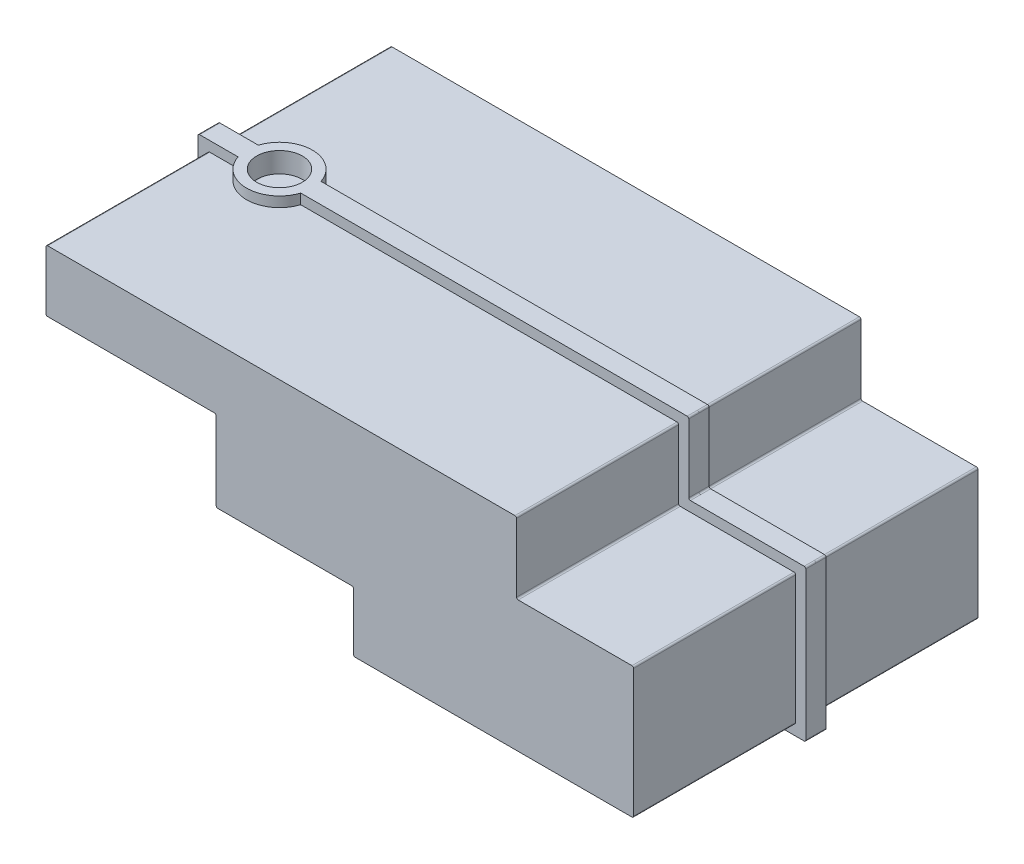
ISO-10303-21;
HEADER;
FILE_DESCRIPTION(('STEP AP214'),'2;1');
FILE_NAME('part.step','',(''),(''),'','','');
FILE_SCHEMA(('AUTOMOTIVE_DESIGN { 1 0 10303 214 1 1 1 1 }'));
ENDSEC;
DATA;
#1=APPLICATION_CONTEXT('core data for automotive mechanical design processes');
#2=APPLICATION_PROTOCOL_DEFINITION('international standard','automotive_design',2000,#1);
#3=PRODUCT_CONTEXT('',#1,'mechanical');
#4=PRODUCT('Part','Part','',(#3));
#5=PRODUCT_RELATED_PRODUCT_CATEGORY('part','',(#4));
#6=PRODUCT_DEFINITION_FORMATION('','',#4);
#7=PRODUCT_DEFINITION_CONTEXT('part definition',#1,'design');
#8=PRODUCT_DEFINITION('design','',#6,#7);
#9=PRODUCT_DEFINITION_SHAPE('','',#8);
#10=(LENGTH_UNIT() NAMED_UNIT(*) SI_UNIT(.MILLI.,.METRE.));
#11=(NAMED_UNIT(*) PLANE_ANGLE_UNIT() SI_UNIT($,.RADIAN.));
#12=(NAMED_UNIT(*) SI_UNIT($,.STERADIAN.) SOLID_ANGLE_UNIT());
#13=UNCERTAINTY_MEASURE_WITH_UNIT(LENGTH_MEASURE(1.E-05),#10,'distance_accuracy_value','');
#14=(GEOMETRIC_REPRESENTATION_CONTEXT(3) GLOBAL_UNCERTAINTY_ASSIGNED_CONTEXT((#13)) GLOBAL_UNIT_ASSIGNED_CONTEXT((#10,
#11,#12)) REPRESENTATION_CONTEXT('',''));
#15=CARTESIAN_POINT('',(0.,0.,0.));
#16=DIRECTION('',(0.,0.,1.));
#17=DIRECTION('',(1.,0.,0.));
#18=AXIS2_PLACEMENT_3D('',#15,#16,#17);
#19=CARTESIAN_POINT('',(0.,0.,215.9));
#20=DIRECTION('',(0.,0.,1.));
#21=DIRECTION('',(-1.,0.,0.));
#22=AXIS2_PLACEMENT_3D('',#19,#20,#21);
#23=PLANE('',#22);
#24=DIRECTION('',(0.,-1.,0.));
#25=VECTOR('',#24,1.);
#26=CARTESIAN_POINT('',(8.5724999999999,-63.5,215.9));
#27=LINE('',#26,#25);
#28=CARTESIAN_POINT('',(8.5724999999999,-26.760265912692,215.9));
#29=VERTEX_POINT('',#28);
#30=CARTESIAN_POINT('',(8.5724999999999,-62.484,215.9));
#31=VERTEX_POINT('',#30);
#32=EDGE_CURVE('E892',#29,#31,#27,.T.);
#33=ORIENTED_EDGE('',*,*,#32,.T.);
#34=CARTESIAN_POINT('',(9.5884999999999,-62.484,215.9));
#35=DIRECTION('',(0.,0.,1.));
#36=DIRECTION('',(1.,0.,0.));
#37=AXIS2_PLACEMENT_3D('',#34,#35,#36);
#38=CIRCLE('',#37,1.016);
#39=CARTESIAN_POINT('',(9.5884999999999,-63.5,215.9));
#40=VERTEX_POINT('',#39);
#41=EDGE_CURVE('E1890',#31,#40,#38,.T.);
#42=ORIENTED_EDGE('',*,*,#41,.T.);
#43=DIRECTION('',(1.,0.,0.));
#44=VECTOR('',#43,1.);
#45=CARTESIAN_POINT('',(2.22249999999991,-63.5,215.9));
#46=LINE('',#45,#44);
#47=CARTESIAN_POINT('',(183.134,-63.5,215.9));
#48=VERTEX_POINT('',#47);
#49=EDGE_CURVE('E929',#40,#48,#46,.T.);
#50=ORIENTED_EDGE('',*,*,#49,.T.);
#51=CARTESIAN_POINT('',(183.134,-62.484,215.9));
#52=DIRECTION('',(0.,0.,1.));
#53=DIRECTION('',(1.,0.,0.));
#54=AXIS2_PLACEMENT_3D('',#51,#52,#53);
#55=CIRCLE('',#54,1.016);
#56=CARTESIAN_POINT('',(184.15,-62.484,215.9));
#57=VERTEX_POINT('',#56);
#58=EDGE_CURVE('E1878',#48,#57,#55,.T.);
#59=ORIENTED_EDGE('',*,*,#58,.T.);
#60=DIRECTION('',(0.,1.,0.));
#61=VECTOR('',#60,1.);
#62=CARTESIAN_POINT('',(184.15,-63.5,215.9));
#63=LINE('',#62,#61);
#64=CARTESIAN_POINT('',(184.15,17.6897340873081,215.9));
#65=VERTEX_POINT('',#64);
#66=EDGE_CURVE('E860',#57,#65,#63,.T.);
#67=ORIENTED_EDGE('',*,*,#66,.T.);
#68=CARTESIAN_POINT('',(183.134,17.6897340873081,215.9));
#69=DIRECTION('',(0.,0.,1.));
#70=DIRECTION('',(1.,0.,0.));
#71=AXIS2_PLACEMENT_3D('',#68,#69,#70);
#72=CIRCLE('',#71,1.016);
#73=CARTESIAN_POINT('',(183.134,18.7057340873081,215.9));
#74=VERTEX_POINT('',#73);
#75=EDGE_CURVE('E1875',#65,#74,#72,.T.);
#76=ORIENTED_EDGE('',*,*,#75,.T.);
#77=DIRECTION('',(-1.,0.,0.));
#78=VECTOR('',#77,1.);
#79=CARTESIAN_POINT('',(110.8075,18.7057340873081,215.9));
#80=LINE('',#79,#78);
#81=CARTESIAN_POINT('',(111.8235,18.7057340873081,215.9));
#82=VERTEX_POINT('',#81);
#83=EDGE_CURVE('E833',#74,#82,#80,.T.);
#84=ORIENTED_EDGE('',*,*,#83,.T.);
#85=CARTESIAN_POINT('',(111.8235,19.7217340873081,215.9));
#86=DIRECTION('',(0.,0.,1.));
#87=DIRECTION('',(1.,0.,0.));
#88=AXIS2_PLACEMENT_3D('',#85,#86,#87);
#89=CIRCLE('',#88,1.016);
#90=CARTESIAN_POINT('',(110.8075,19.7217340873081,215.9));
#91=VERTEX_POINT('',#90);
#92=EDGE_CURVE('E50',#82,#91,#89,.F.);
#93=ORIENTED_EDGE('',*,*,#92,.T.);
#94=DIRECTION('',(0.,1.,0.));
#95=VECTOR('',#94,1.);
#96=CARTESIAN_POINT('',(110.8075,25.0557340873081,215.9));
#97=LINE('',#96,#95);
#98=CARTESIAN_POINT('',(110.8075,62.484,215.9));
#99=VERTEX_POINT('',#98);
#100=EDGE_CURVE('E847',#91,#99,#97,.T.);
#101=ORIENTED_EDGE('',*,*,#100,.T.);
#102=CARTESIAN_POINT('',(109.7915,62.484,215.9));
#103=DIRECTION('',(0.,0.,1.));
#104=DIRECTION('',(1.,0.,0.));
#105=AXIS2_PLACEMENT_3D('',#102,#103,#104);
#106=CIRCLE('',#105,1.016);
#107=CARTESIAN_POINT('',(109.7915,63.5,215.9));
#108=VERTEX_POINT('',#107);
#109=EDGE_CURVE('E1872',#99,#108,#106,.T.);
#110=ORIENTED_EDGE('',*,*,#109,.T.);
#111=DIRECTION('',(-1.,0.,0.));
#112=VECTOR('',#111,1.);
#113=CARTESIAN_POINT('',(-184.15,63.5,215.9));
#114=LINE('',#113,#112);
#115=CARTESIAN_POINT('',(-183.134,63.5,215.9));
#116=VERTEX_POINT('',#115);
#117=EDGE_CURVE('E821',#108,#116,#114,.T.);
#118=ORIENTED_EDGE('',*,*,#117,.T.);
#119=CARTESIAN_POINT('',(-183.134,62.484,215.9));
#120=DIRECTION('',(0.,0.,1.));
#121=DIRECTION('',(1.,0.,0.));
#122=AXIS2_PLACEMENT_3D('',#119,#120,#121);
#123=CIRCLE('',#122,1.016);
#124=CARTESIAN_POINT('',(-184.15,62.484,215.9));
#125=VERTEX_POINT('',#124);
#126=EDGE_CURVE('E1884',#116,#125,#123,.T.);
#127=ORIENTED_EDGE('',*,*,#126,.T.);
#128=DIRECTION('',(0.,-1.,0.));
#129=VECTOR('',#128,1.);
#130=CARTESIAN_POINT('',(-184.15,25.0557340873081,215.9));
#131=LINE('',#130,#129);
#132=CARTESIAN_POINT('',(-184.15,26.0717340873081,215.9));
#133=VERTEX_POINT('',#132);
#134=EDGE_CURVE('E872',#125,#133,#131,.T.);
#135=ORIENTED_EDGE('',*,*,#134,.T.);
#136=CARTESIAN_POINT('',(-183.134,26.0717340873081,215.9));
#137=DIRECTION('',(0.,0.,1.));
#138=DIRECTION('',(1.,0.,0.));
#139=AXIS2_PLACEMENT_3D('',#136,#137,#138);
#140=CIRCLE('',#139,1.016);
#141=CARTESIAN_POINT('',(-183.134,25.0557340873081,215.9));
#142=VERTEX_POINT('',#141);
#143=EDGE_CURVE('E1887',#133,#142,#140,.T.);
#144=ORIENTED_EDGE('',*,*,#143,.T.);
#145=DIRECTION('',(1.,0.,0.));
#146=VECTOR('',#145,1.);
#147=CARTESIAN_POINT('',(-83.8187301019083,25.0557340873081,215.9));
#148=LINE('',#147,#146);
#149=CARTESIAN_POINT('',(-78.4847301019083,25.0557340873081,215.9));
#150=VERTEX_POINT('',#149);
#151=EDGE_CURVE('E897',#142,#150,#148,.T.);
#152=ORIENTED_EDGE('',*,*,#151,.T.);
#153=CARTESIAN_POINT('',(-78.4847301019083,24.0397340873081,215.9));
#154=DIRECTION('',(0.,0.,1.));
#155=DIRECTION('',(1.,0.,0.));
#156=AXIS2_PLACEMENT_3D('',#153,#154,#155);
#157=CIRCLE('',#156,1.016);
#158=CARTESIAN_POINT('',(-77.4687301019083,24.0397340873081,215.9));
#159=VERTEX_POINT('',#158);
#160=EDGE_CURVE('E2061',#150,#159,#157,.F.);
#161=ORIENTED_EDGE('',*,*,#160,.T.);
#162=DIRECTION('',(0.,-1.,0.));
#163=VECTOR('',#162,1.);
#164=CARTESIAN_POINT('',(-77.4687301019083,-25.744265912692,215.9));
#165=LINE('',#164,#163);
#166=CARTESIAN_POINT('',(-77.4687301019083,-24.728265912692,215.9));
#167=VERTEX_POINT('',#166);
#168=EDGE_CURVE('E884',#159,#167,#165,.T.);
#169=ORIENTED_EDGE('',*,*,#168,.T.);
#170=CARTESIAN_POINT('',(-76.4527301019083,-24.728265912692,215.9));
#171=DIRECTION('',(0.,0.,1.));
#172=DIRECTION('',(1.,0.,0.));
#173=AXIS2_PLACEMENT_3D('',#170,#171,#172);
#174=CIRCLE('',#173,1.016);
#175=CARTESIAN_POINT('',(-76.4527301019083,-25.744265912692,215.9));
#176=VERTEX_POINT('',#175);
#177=EDGE_CURVE('E1881',#167,#176,#174,.T.);
#178=ORIENTED_EDGE('',*,*,#177,.T.);
#179=DIRECTION('',(1.,0.,0.));
#180=VECTOR('',#179,1.);
#181=CARTESIAN_POINT('',(-83.8187301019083,-25.744265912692,215.9));
#182=LINE('',#181,#180);
#183=CARTESIAN_POINT('',(7.5564999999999,-25.744265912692,215.9));
#184=VERTEX_POINT('',#183);
#185=EDGE_CURVE('E917',#176,#184,#182,.T.);
#186=ORIENTED_EDGE('',*,*,#185,.T.);
#187=CARTESIAN_POINT('',(7.5564999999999,-26.760265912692,215.9));
#188=DIRECTION('',(0.,0.,1.));
#189=DIRECTION('',(1.,0.,0.));
#190=AXIS2_PLACEMENT_3D('',#187,#188,#189);
#191=CIRCLE('',#190,1.016);
#192=EDGE_CURVE('E2073',#184,#29,#191,.F.);
#193=ORIENTED_EDGE('',*,*,#192,.T.);
#194=EDGE_LOOP('',(#33,#42,#50,#59,#67,#76,#84,#93,#101,#110,#118,#127,#135,#144,#152,#161,#169,
#178,#186,#193));
#195=FACE_BOUND('',#194,.T.);
#196=ADVANCED_FACE('F41',(#195),#23,.T.);
#197=CARTESIAN_POINT('',(-190.5,69.85,107.95));
#198=DIRECTION('',(0.,-1.,0.));
#199=DIRECTION('',(0.,0.,-1.));
#200=AXIS2_PLACEMENT_3D('',#197,#198,#199);
#201=PLANE('',#200);
#202=CARTESIAN_POINT('',(-145.7325,69.85,107.95));
#203=DIRECTION('',(0.,1.,0.));
#204=DIRECTION('',(0.,0.,1.));
#205=AXIS2_PLACEMENT_3D('',#202,#203,#204);
#206=CIRCLE('',#205,14.2875);
#207=CARTESIAN_POINT('',(-145.7325,69.85,122.2375));
#208=VERTEX_POINT('',#207);
#209=EDGE_CURVE('E1315',#208,#208,#206,.T.);
#210=ORIENTED_EDGE('',*,*,#209,.F.);
#211=EDGE_LOOP('',(#210));
#212=FACE_BOUND('',#211,.T.);
#213=DIRECTION('',(0.,0.,-1.));
#214=VECTOR('',#213,1.);
#215=CARTESIAN_POINT('',(-189.484,69.85,107.95));
#216=LINE('',#215,#214);
#217=CARTESIAN_POINT('',(-189.484,69.85,101.6));
#218=VERTEX_POINT('',#217);
#219=CARTESIAN_POINT('',(-189.484,69.85,107.95));
#220=VERTEX_POINT('',#219);
#221=EDGE_CURVE('E1398',#218,#220,#216,.F.);
#222=ORIENTED_EDGE('',*,*,#221,.T.);
#223=DIRECTION('',(0.,0.,1.));
#224=VECTOR('',#223,1.);
#225=CARTESIAN_POINT('',(-189.484,69.85,107.95));
#226=LINE('',#225,#224);
#227=CARTESIAN_POINT('',(-189.484,69.85,114.3));
#228=VERTEX_POINT('',#227);
#229=EDGE_CURVE('E1790',#220,#228,#226,.T.);
#230=ORIENTED_EDGE('',*,*,#229,.T.);
#231=DIRECTION('',(-1.,0.,0.));
#232=VECTOR('',#231,1.);
#233=CARTESIAN_POINT('',(-184.15,69.85,114.3));
#234=LINE('',#233,#232);
#235=CARTESIAN_POINT('',(-165.368790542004,69.85,114.3));
#236=VERTEX_POINT('',#235);
#237=EDGE_CURVE('E876',#236,#228,#234,.T.);
#238=ORIENTED_EDGE('',*,*,#237,.F.);
#239=CARTESIAN_POINT('',(-145.7325,69.85,107.95));
#240=DIRECTION('',(0.,1.,0.));
#241=DIRECTION('',(0.,0.,-1.));
#242=AXIS2_PLACEMENT_3D('',#239,#240,#241);
#243=CIRCLE('',#242,20.6375);
#244=CARTESIAN_POINT('',(-126.096209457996,69.85,114.3));
#245=VERTEX_POINT('',#244);
#246=EDGE_CURVE('E829',#236,#245,#243,.T.);
#247=ORIENTED_EDGE('',*,*,#246,.T.);
#248=DIRECTION('',(1.,0.,0.));
#249=VECTOR('',#248,1.);
#250=CARTESIAN_POINT('',(110.8075,69.85,114.3));
#251=LINE('',#250,#249);
#252=CARTESIAN_POINT('',(116.1415,69.85,114.3));
#253=VERTEX_POINT('',#252);
#254=EDGE_CURVE('E813',#245,#253,#251,.T.);
#255=ORIENTED_EDGE('',*,*,#254,.T.);
#256=DIRECTION('',(0.,0.,-1.));
#257=VECTOR('',#256,1.);
#258=CARTESIAN_POINT('',(116.1415,69.85,107.95));
#259=LINE('',#258,#257);
#260=CARTESIAN_POINT('',(116.1415,69.85,107.95));
#261=VERTEX_POINT('',#260);
#262=EDGE_CURVE('E1786',#253,#261,#259,.T.);
#263=ORIENTED_EDGE('',*,*,#262,.T.);
#264=DIRECTION('',(0.,0.,1.));
#265=VECTOR('',#264,1.);
#266=CARTESIAN_POINT('',(116.1415,69.85,107.95));
#267=LINE('',#266,#265);
#268=CARTESIAN_POINT('',(116.1415,69.85,101.6));
#269=VERTEX_POINT('',#268);
#270=EDGE_CURVE('E1395',#261,#269,#267,.F.);
#271=ORIENTED_EDGE('',*,*,#270,.T.);
#272=DIRECTION('',(1.,0.,0.));
#273=VECTOR('',#272,1.);
#274=CARTESIAN_POINT('',(110.8075,69.85,101.6));
#275=LINE('',#274,#273);
#276=CARTESIAN_POINT('',(-126.096209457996,69.85,101.6));
#277=VERTEX_POINT('',#276);
#278=EDGE_CURVE('E1087',#277,#269,#275,.T.);
#279=ORIENTED_EDGE('',*,*,#278,.F.);
#280=CARTESIAN_POINT('',(-145.7325,69.85,107.95));
#281=DIRECTION('',(0.,-1.,0.));
#282=DIRECTION('',(0.,0.,1.));
#283=AXIS2_PLACEMENT_3D('',#280,#281,#282);
#284=CIRCLE('',#283,20.6375);
#285=CARTESIAN_POINT('',(-165.368790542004,69.85,101.6));
#286=VERTEX_POINT('',#285);
#287=EDGE_CURVE('E1043',#286,#277,#284,.T.);
#288=ORIENTED_EDGE('',*,*,#287,.F.);
#289=DIRECTION('',(-1.,0.,0.));
#290=VECTOR('',#289,1.);
#291=CARTESIAN_POINT('',(-184.15,69.85,101.6));
#292=LINE('',#291,#290);
#293=EDGE_CURVE('E1114',#286,#218,#292,.T.);
#294=ORIENTED_EDGE('',*,*,#293,.T.);
#295=EDGE_LOOP('',(#222,#230,#238,#247,#255,#263,#271,#279,#288,#294));
#296=FACE_BOUND('',#295,.T.);
#297=ADVANCED_FACE('F2180',(#212,#296),#201,.F.);
#298=CARTESIAN_POINT('',(-184.15,0.,215.9));
#299=DIRECTION('',(-1.,0.,0.));
#300=DIRECTION('',(0.,0.,-1.));
#301=AXIS2_PLACEMENT_3D('',#298,#299,#300);
#302=PLANE('',#301);
#303=DIRECTION('',(0.,1.,0.));
#304=VECTOR('',#303,1.);
#305=CARTESIAN_POINT('',(-184.15,25.0557340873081,114.3));
#306=LINE('',#305,#304);
#307=CARTESIAN_POINT('',(-184.15,26.0717340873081,114.3));
#308=VERTEX_POINT('',#307);
#309=CARTESIAN_POINT('',(-184.15,62.484,114.3));
#310=VERTEX_POINT('',#309);
#311=EDGE_CURVE('E868',#308,#310,#306,.T.);
#312=ORIENTED_EDGE('',*,*,#311,.F.);
#313=DIRECTION('',(0.,0.,-1.));
#314=VECTOR('',#313,1.);
#315=CARTESIAN_POINT('',(-184.15,26.0717340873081,215.9));
#316=LINE('',#315,#314);
#317=EDGE_CURVE('E1897',#308,#133,#316,.F.);
#318=ORIENTED_EDGE('',*,*,#317,.T.);
#319=ORIENTED_EDGE('',*,*,#134,.F.);
#320=DIRECTION('',(0.,0.,-1.));
#321=VECTOR('',#320,1.);
#322=CARTESIAN_POINT('',(-184.15,62.484,215.9));
#323=LINE('',#322,#321);
#324=EDGE_CURVE('E1893',#125,#310,#323,.T.);
#325=ORIENTED_EDGE('',*,*,#324,.T.);
#326=EDGE_LOOP('',(#312,#318,#319,#325));
#327=FACE_BOUND('',#326,.T.);
#328=ADVANCED_FACE('F2192',(#327),#302,.T.);
#329=CARTESIAN_POINT('',(110.8075,0.,215.9));
#330=DIRECTION('',(-1.,0.,0.));
#331=DIRECTION('',(0.,0.,-1.));
#332=AXIS2_PLACEMENT_3D('',#329,#330,#331);
#333=PLANE('',#332);
#334=ORIENTED_EDGE('',*,*,#100,.F.);
#335=DIRECTION('',(0.,0.,-1.));
#336=VECTOR('',#335,1.);
#337=CARTESIAN_POINT('',(110.8075,19.7217340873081,215.9));
#338=LINE('',#337,#336);
#339=CARTESIAN_POINT('',(110.8075,19.7217340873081,114.3));
#340=VERTEX_POINT('',#339);
#341=EDGE_CURVE('E1930',#91,#340,#338,.T.);
#342=ORIENTED_EDGE('',*,*,#341,.T.);
#343=DIRECTION('',(0.,-1.,0.));
#344=VECTOR('',#343,1.);
#345=CARTESIAN_POINT('',(110.8075,25.0557340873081,114.3));
#346=LINE('',#345,#344);
#347=CARTESIAN_POINT('',(110.8075,62.484,114.3));
#348=VERTEX_POINT('',#347);
#349=EDGE_CURVE('E843',#348,#340,#346,.T.);
#350=ORIENTED_EDGE('',*,*,#349,.F.);
#351=DIRECTION('',(0.,0.,1.));
#352=VECTOR('',#351,1.);
#353=CARTESIAN_POINT('',(110.8075,62.484,215.9));
#354=LINE('',#353,#352);
#355=EDGE_CURVE('E1926',#348,#99,#354,.T.);
#356=ORIENTED_EDGE('',*,*,#355,.T.);
#357=EDGE_LOOP('',(#334,#342,#350,#356));
#358=FACE_BOUND('',#357,.T.);
#359=ADVANCED_FACE('F2093',(#358),#333,.F.);
#360=CARTESIAN_POINT('',(117.1575,25.0557340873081,0.));
#361=DIRECTION('',(0.,-1.,0.));
#362=DIRECTION('',(1.,0.,0.));
#363=AXIS2_PLACEMENT_3D('',#360,#361,#362);
#364=PLANE('',#363);
#365=DIRECTION('',(0.,0.,1.));
#366=VECTOR('',#365,1.);
#367=CARTESIAN_POINT('',(118.1735,25.0557340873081,107.95));
#368=LINE('',#367,#366);
#369=CARTESIAN_POINT('',(118.1735,25.0557340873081,101.6));
#370=VERTEX_POINT('',#369);
#371=CARTESIAN_POINT('',(118.1735,25.0557340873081,107.95));
#372=VERTEX_POINT('',#371);
#373=EDGE_CURVE('E1358',#370,#372,#368,.T.);
#374=ORIENTED_EDGE('',*,*,#373,.T.);
#375=DIRECTION('',(0.,0.,-1.));
#376=VECTOR('',#375,1.);
#377=CARTESIAN_POINT('',(118.1735,25.0557340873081,114.3));
#378=LINE('',#377,#376);
#379=CARTESIAN_POINT('',(118.1735,25.0557340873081,114.3));
#380=VERTEX_POINT('',#379);
#381=EDGE_CURVE('E1783',#372,#380,#378,.F.);
#382=ORIENTED_EDGE('',*,*,#381,.T.);
#383=DIRECTION('',(1.,0.,0.));
#384=VECTOR('',#383,1.);
#385=CARTESIAN_POINT('',(184.15,25.0557340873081,114.3));
#386=LINE('',#385,#384);
#387=CARTESIAN_POINT('',(189.484,25.0557340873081,114.3));
#388=VERTEX_POINT('',#387);
#389=EDGE_CURVE('E864',#380,#388,#386,.T.);
#390=ORIENTED_EDGE('',*,*,#389,.T.);
#391=DIRECTION('',(0.,0.,-1.));
#392=VECTOR('',#391,1.);
#393=CARTESIAN_POINT('',(189.484,25.0557340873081,0.));
#394=LINE('',#393,#392);
#395=CARTESIAN_POINT('',(189.484,25.0557340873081,107.95));
#396=VERTEX_POINT('',#395);
#397=EDGE_CURVE('E1779',#388,#396,#394,.T.);
#398=ORIENTED_EDGE('',*,*,#397,.T.);
#399=DIRECTION('',(0.,0.,1.));
#400=VECTOR('',#399,1.);
#401=CARTESIAN_POINT('',(189.484,25.0557340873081,0.));
#402=LINE('',#401,#400);
#403=CARTESIAN_POINT('',(189.484,25.0557340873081,101.6));
#404=VERTEX_POINT('',#403);
#405=EDGE_CURVE('E1355',#396,#404,#402,.F.);
#406=ORIENTED_EDGE('',*,*,#405,.T.);
#407=DIRECTION('',(1.,0.,0.));
#408=VECTOR('',#407,1.);
#409=CARTESIAN_POINT('',(184.15,25.0557340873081,101.6));
#410=LINE('',#409,#408);
#411=EDGE_CURVE('E1102',#370,#404,#410,.T.);
#412=ORIENTED_EDGE('',*,*,#411,.F.);
#413=EDGE_LOOP('',(#374,#382,#390,#398,#406,#412));
#414=FACE_BOUND('',#413,.T.);
#415=ADVANCED_FACE('F2162',(#414),#364,.F.);
#416=CARTESIAN_POINT('',(184.15,0.,215.9));
#417=DIRECTION('',(-1.,0.,0.));
#418=DIRECTION('',(0.,0.,-1.));
#419=AXIS2_PLACEMENT_3D('',#416,#417,#418);
#420=PLANE('',#419);
#421=ORIENTED_EDGE('',*,*,#66,.F.);
#422=DIRECTION('',(0.,0.,1.));
#423=VECTOR('',#422,1.);
#424=CARTESIAN_POINT('',(184.15,-62.484,114.3));
#425=LINE('',#424,#423);
#426=CARTESIAN_POINT('',(184.15,-62.484,114.3));
#427=VERTEX_POINT('',#426);
#428=EDGE_CURVE('E1917',#57,#427,#425,.F.);
#429=ORIENTED_EDGE('',*,*,#428,.T.);
#430=DIRECTION('',(0.,-1.,0.));
#431=VECTOR('',#430,1.);
#432=CARTESIAN_POINT('',(184.15,-63.5,114.3));
#433=LINE('',#432,#431);
#434=CARTESIAN_POINT('',(184.15,17.6897340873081,114.3));
#435=VERTEX_POINT('',#434);
#436=EDGE_CURVE('E856',#435,#427,#433,.T.);
#437=ORIENTED_EDGE('',*,*,#436,.F.);
#438=DIRECTION('',(0.,0.,1.));
#439=VECTOR('',#438,1.);
#440=CARTESIAN_POINT('',(184.15,17.6897340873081,215.9));
#441=LINE('',#440,#439);
#442=EDGE_CURVE('E1913',#435,#65,#441,.T.);
#443=ORIENTED_EDGE('',*,*,#442,.T.);
#444=EDGE_LOOP('',(#421,#429,#437,#443));
#445=FACE_BOUND('',#444,.T.);
#446=ADVANCED_FACE('F2109',(#445),#420,.F.);
#447=CARTESIAN_POINT('',(117.1575,69.85,0.));
#448=DIRECTION('',(-1.,0.,0.));
#449=DIRECTION('',(0.,0.,1.));
#450=AXIS2_PLACEMENT_3D('',#447,#448,#449);
#451=PLANE('',#450);
#452=DIRECTION('',(0.,-1.,0.));
#453=VECTOR('',#452,1.);
#454=CARTESIAN_POINT('',(117.1575,25.0557340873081,114.3));
#455=LINE('',#454,#453);
#456=CARTESIAN_POINT('',(117.1575,68.834,114.3));
#457=VERTEX_POINT('',#456);
#458=CARTESIAN_POINT('',(117.1575,26.0717340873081,114.3));
#459=VERTEX_POINT('',#458);
#460=EDGE_CURVE('E842',#457,#459,#455,.T.);
#461=ORIENTED_EDGE('',*,*,#460,.T.);
#462=DIRECTION('',(0.,0.,-1.));
#463=VECTOR('',#462,1.);
#464=CARTESIAN_POINT('',(117.1575,26.0717340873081,107.95));
#465=LINE('',#464,#463);
#466=CARTESIAN_POINT('',(117.1575,26.0717340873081,107.95));
#467=VERTEX_POINT('',#466);
#468=EDGE_CURVE('E1775',#459,#467,#465,.T.);
#469=ORIENTED_EDGE('',*,*,#468,.T.);
#470=DIRECTION('',(0.,0.,1.));
#471=VECTOR('',#470,1.);
#472=CARTESIAN_POINT('',(117.1575,26.0717340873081,101.6));
#473=LINE('',#472,#471);
#474=CARTESIAN_POINT('',(117.1575,26.0717340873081,101.6));
#475=VERTEX_POINT('',#474);
#476=EDGE_CURVE('E1366',#467,#475,#473,.F.);
#477=ORIENTED_EDGE('',*,*,#476,.T.);
#478=DIRECTION('',(0.,-1.,0.));
#479=VECTOR('',#478,1.);
#480=CARTESIAN_POINT('',(117.1575,25.0557340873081,101.6));
#481=LINE('',#480,#479);
#482=CARTESIAN_POINT('',(117.1575,68.834,101.6));
#483=VERTEX_POINT('',#482);
#484=EDGE_CURVE('E1078',#483,#475,#481,.T.);
#485=ORIENTED_EDGE('',*,*,#484,.F.);
#486=DIRECTION('',(0.,0.,1.));
#487=VECTOR('',#486,1.);
#488=CARTESIAN_POINT('',(117.1575,68.834,0.));
#489=LINE('',#488,#487);
#490=CARTESIAN_POINT('',(117.1575,68.834,107.95));
#491=VERTEX_POINT('',#490);
#492=EDGE_CURVE('E1362',#483,#491,#489,.T.);
#493=ORIENTED_EDGE('',*,*,#492,.T.);
#494=DIRECTION('',(0.,0.,-1.));
#495=VECTOR('',#494,1.);
#496=CARTESIAN_POINT('',(117.1575,68.834,0.));
#497=LINE('',#496,#495);
#498=EDGE_CURVE('E1772',#491,#457,#497,.F.);
#499=ORIENTED_EDGE('',*,*,#498,.T.);
#500=EDGE_LOOP('',(#461,#469,#477,#485,#493,#499));
#501=FACE_BOUND('',#500,.T.);
#502=ADVANCED_FACE('F2171',(#501),#451,.F.);
#503=CARTESIAN_POINT('',(190.5,-69.85,107.95));
#504=DIRECTION('',(-1.,0.,0.));
#505=DIRECTION('',(0.,0.,1.));
#506=AXIS2_PLACEMENT_3D('',#503,#504,#505);
#507=PLANE('',#506);
#508=DIRECTION('',(0.,-1.,0.));
#509=VECTOR('',#508,1.);
#510=CARTESIAN_POINT('',(190.5,-63.5,114.3));
#511=LINE('',#510,#509);
#512=CARTESIAN_POINT('',(190.5,24.0397340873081,114.3));
#513=VERTEX_POINT('',#512);
#514=CARTESIAN_POINT('',(190.5,-68.834,114.3));
#515=VERTEX_POINT('',#514);
#516=EDGE_CURVE('E954',#513,#515,#511,.T.);
#517=ORIENTED_EDGE('',*,*,#516,.T.);
#518=DIRECTION('',(0.,0.,1.));
#519=VECTOR('',#518,1.);
#520=CARTESIAN_POINT('',(190.5,-68.834,107.95));
#521=LINE('',#520,#519);
#522=CARTESIAN_POINT('',(190.5,-68.834,107.95));
#523=VERTEX_POINT('',#522);
#524=EDGE_CURVE('E1841',#515,#523,#521,.F.);
#525=ORIENTED_EDGE('',*,*,#524,.T.);
#526=DIRECTION('',(0.,0.,-1.));
#527=VECTOR('',#526,1.);
#528=CARTESIAN_POINT('',(190.5,-68.834,107.95));
#529=LINE('',#528,#527);
#530=CARTESIAN_POINT('',(190.5,-68.834,101.6));
#531=VERTEX_POINT('',#530);
#532=EDGE_CURVE('E1424',#523,#531,#529,.T.);
#533=ORIENTED_EDGE('',*,*,#532,.T.);
#534=DIRECTION('',(0.,-1.,0.));
#535=VECTOR('',#534,1.);
#536=CARTESIAN_POINT('',(190.5,-63.5,101.6));
#537=LINE('',#536,#535);
#538=CARTESIAN_POINT('',(190.5,24.0397340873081,101.6));
#539=VERTEX_POINT('',#538);
#540=EDGE_CURVE('E1183',#539,#531,#537,.T.);
#541=ORIENTED_EDGE('',*,*,#540,.F.);
#542=DIRECTION('',(0.,0.,1.));
#543=VECTOR('',#542,1.);
#544=CARTESIAN_POINT('',(190.5,24.0397340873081,107.95));
#545=LINE('',#544,#543);
#546=CARTESIAN_POINT('',(190.5,24.0397340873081,107.95));
#547=VERTEX_POINT('',#546);
#548=EDGE_CURVE('E1420',#539,#547,#545,.T.);
#549=ORIENTED_EDGE('',*,*,#548,.T.);
#550=DIRECTION('',(0.,0.,-1.));
#551=VECTOR('',#550,1.);
#552=CARTESIAN_POINT('',(190.5,24.0397340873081,107.95));
#553=LINE('',#552,#551);
#554=EDGE_CURVE('E1838',#547,#513,#553,.F.);
#555=ORIENTED_EDGE('',*,*,#554,.T.);
#556=EDGE_LOOP('',(#517,#525,#533,#541,#549,#555));
#557=FACE_BOUND('',#556,.T.);
#558=ADVANCED_FACE('F2138',(#557),#507,.F.);
#559=CARTESIAN_POINT('',(-190.5,-69.85,107.95));
#560=DIRECTION('',(1.,0.,0.));
#561=DIRECTION('',(0.,0.,-1.));
#562=AXIS2_PLACEMENT_3D('',#559,#560,#561);
#563=PLANE('',#562);
#564=DIRECTION('',(0.,-1.,0.));
#565=VECTOR('',#564,1.);
#566=CARTESIAN_POINT('',(-190.5,25.0557340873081,114.3));
#567=LINE('',#566,#565);
#568=CARTESIAN_POINT('',(-190.5,68.834,114.3));
#569=VERTEX_POINT('',#568);
#570=CARTESIAN_POINT('',(-190.5,19.7217340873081,114.3));
#571=VERTEX_POINT('',#570);
#572=EDGE_CURVE('E905',#569,#571,#567,.T.);
#573=ORIENTED_EDGE('',*,*,#572,.F.);
#574=DIRECTION('',(0.,0.,1.));
#575=VECTOR('',#574,1.);
#576=CARTESIAN_POINT('',(-190.5,68.834,107.95));
#577=LINE('',#576,#575);
#578=CARTESIAN_POINT('',(-190.5,68.834,107.95));
#579=VERTEX_POINT('',#578);
#580=EDGE_CURVE('E1815',#569,#579,#577,.F.);
#581=ORIENTED_EDGE('',*,*,#580,.T.);
#582=DIRECTION('',(0.,0.,-1.));
#583=VECTOR('',#582,1.);
#584=CARTESIAN_POINT('',(-190.5,68.834,107.95));
#585=LINE('',#584,#583);
#586=CARTESIAN_POINT('',(-190.5,68.834,101.6));
#587=VERTEX_POINT('',#586);
#588=EDGE_CURVE('E1373',#579,#587,#585,.T.);
#589=ORIENTED_EDGE('',*,*,#588,.T.);
#590=DIRECTION('',(0.,-1.,0.));
#591=VECTOR('',#590,1.);
#592=CARTESIAN_POINT('',(-190.5,25.0557340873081,101.6));
#593=LINE('',#592,#591);
#594=CARTESIAN_POINT('',(-190.5,19.7217340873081,101.6));
#595=VERTEX_POINT('',#594);
#596=EDGE_CURVE('E1143',#587,#595,#593,.T.);
#597=ORIENTED_EDGE('',*,*,#596,.T.);
#598=DIRECTION('',(0.,0.,1.));
#599=VECTOR('',#598,1.);
#600=CARTESIAN_POINT('',(-190.5,19.7217340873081,107.95));
#601=LINE('',#600,#599);
#602=CARTESIAN_POINT('',(-190.5,19.7217340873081,107.95));
#603=VERTEX_POINT('',#602);
#604=EDGE_CURVE('E1369',#595,#603,#601,.T.);
#605=ORIENTED_EDGE('',*,*,#604,.T.);
#606=DIRECTION('',(0.,0.,-1.));
#607=VECTOR('',#606,1.);
#608=CARTESIAN_POINT('',(-190.5,19.7217340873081,107.95));
#609=LINE('',#608,#607);
#610=EDGE_CURVE('E1812',#603,#571,#609,.F.);
#611=ORIENTED_EDGE('',*,*,#610,.T.);
#612=EDGE_LOOP('',(#573,#581,#589,#597,#605,#611));
#613=FACE_BOUND('',#612,.T.);
#614=ADVANCED_FACE('F2427',(#613),#563,.F.);
#615=CARTESIAN_POINT('',(0.,25.0557340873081,215.9));
#616=DIRECTION('',(0.,1.,0.));
#617=DIRECTION('',(-1.,0.,0.));
#618=AXIS2_PLACEMENT_3D('',#615,#616,#617);
#619=PLANE('',#618);
#620=DIRECTION('',(-1.,0.,0.));
#621=VECTOR('',#620,1.);
#622=CARTESIAN_POINT('',(-83.8187301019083,25.0557340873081,114.3));
#623=LINE('',#622,#621);
#624=CARTESIAN_POINT('',(-78.4847301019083,25.0557340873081,114.3));
#625=VERTEX_POINT('',#624);
#626=CARTESIAN_POINT('',(-183.134,25.0557340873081,114.3));
#627=VERTEX_POINT('',#626);
#628=EDGE_CURVE('E901',#625,#627,#623,.T.);
#629=ORIENTED_EDGE('',*,*,#628,.F.);
#630=DIRECTION('',(0.,0.,1.));
#631=VECTOR('',#630,1.);
#632=CARTESIAN_POINT('',(-78.4847301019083,25.0557340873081,215.9));
#633=LINE('',#632,#631);
#634=EDGE_CURVE('E1848',#625,#150,#633,.T.);
#635=ORIENTED_EDGE('',*,*,#634,.T.);
#636=ORIENTED_EDGE('',*,*,#151,.F.);
#637=DIRECTION('',(0.,0.,-1.));
#638=VECTOR('',#637,1.);
#639=CARTESIAN_POINT('',(-183.134,25.0557340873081,114.3));
#640=LINE('',#639,#638);
#641=EDGE_CURVE('E1844',#142,#627,#640,.T.);
#642=ORIENTED_EDGE('',*,*,#641,.T.);
#643=EDGE_LOOP('',(#629,#635,#636,#642));
#644=FACE_BOUND('',#643,.T.);
#645=ADVANCED_FACE('F2200',(#644),#619,.F.);
#646=CARTESIAN_POINT('',(-83.8187301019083,-32.094265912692,0.));
#647=DIRECTION('',(1.,0.,0.));
#648=DIRECTION('',(0.,0.,-1.));
#649=AXIS2_PLACEMENT_3D('',#646,#647,#648);
#650=PLANE('',#649);
#651=DIRECTION('',(0.,-1.,0.));
#652=VECTOR('',#651,1.);
#653=CARTESIAN_POINT('',(-83.8187301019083,-25.744265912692,114.3));
#654=LINE('',#653,#652);
#655=CARTESIAN_POINT('',(-83.8187301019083,17.6897340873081,114.3));
#656=VERTEX_POINT('',#655);
#657=CARTESIAN_POINT('',(-83.8187301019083,-31.078265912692,114.3));
#658=VERTEX_POINT('',#657);
#659=EDGE_CURVE('E921',#656,#658,#654,.T.);
#660=ORIENTED_EDGE('',*,*,#659,.F.);
#661=DIRECTION('',(0.,0.,-1.));
#662=VECTOR('',#661,1.);
#663=CARTESIAN_POINT('',(-83.8187301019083,17.6897340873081,107.95));
#664=LINE('',#663,#662);
#665=CARTESIAN_POINT('',(-83.8187301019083,17.6897340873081,107.95));
#666=VERTEX_POINT('',#665);
#667=EDGE_CURVE('E1761',#656,#666,#664,.T.);
#668=ORIENTED_EDGE('',*,*,#667,.T.);
#669=DIRECTION('',(0.,0.,1.));
#670=VECTOR('',#669,1.);
#671=CARTESIAN_POINT('',(-83.8187301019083,17.6897340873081,101.6));
#672=LINE('',#671,#670);
#673=CARTESIAN_POINT('',(-83.8187301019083,17.6897340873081,101.6));
#674=VERTEX_POINT('',#673);
#675=EDGE_CURVE('E1352',#666,#674,#672,.F.);
#676=ORIENTED_EDGE('',*,*,#675,.T.);
#677=DIRECTION('',(0.,-1.,0.));
#678=VECTOR('',#677,1.);
#679=CARTESIAN_POINT('',(-83.8187301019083,-25.744265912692,101.6));
#680=LINE('',#679,#678);
#681=CARTESIAN_POINT('',(-83.8187301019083,-31.078265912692,101.6));
#682=VERTEX_POINT('',#681);
#683=EDGE_CURVE('E1159',#674,#682,#680,.T.);
#684=ORIENTED_EDGE('',*,*,#683,.T.);
#685=DIRECTION('',(0.,0.,1.));
#686=VECTOR('',#685,1.);
#687=CARTESIAN_POINT('',(-83.8187301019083,-31.078265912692,0.));
#688=LINE('',#687,#686);
#689=CARTESIAN_POINT('',(-83.8187301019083,-31.078265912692,107.95));
#690=VERTEX_POINT('',#689);
#691=EDGE_CURVE('E1348',#682,#690,#688,.T.);
#692=ORIENTED_EDGE('',*,*,#691,.T.);
#693=DIRECTION('',(0.,0.,-1.));
#694=VECTOR('',#693,1.);
#695=CARTESIAN_POINT('',(-83.8187301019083,-31.078265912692,0.));
#696=LINE('',#695,#694);
#697=EDGE_CURVE('E1758',#690,#658,#696,.F.);
#698=ORIENTED_EDGE('',*,*,#697,.T.);
#699=EDGE_LOOP('',(#660,#668,#676,#684,#692,#698));
#700=FACE_BOUND('',#699,.T.);
#701=ADVANCED_FACE('F2316',(#700),#650,.F.);
#702=CARTESIAN_POINT('',(0.,-25.744265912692,215.9));
#703=DIRECTION('',(0.,-1.,0.));
#704=DIRECTION('',(1.,0.,0.));
#705=AXIS2_PLACEMENT_3D('',#702,#703,#704);
#706=PLANE('',#705);
#707=DIRECTION('',(-1.,0.,0.));
#708=VECTOR('',#707,1.);
#709=CARTESIAN_POINT('',(-83.8187301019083,-25.744265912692,114.3));
#710=LINE('',#709,#708);
#711=CARTESIAN_POINT('',(7.5564999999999,-25.744265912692,114.3));
#712=VERTEX_POINT('',#711);
#713=CARTESIAN_POINT('',(-76.4527301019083,-25.744265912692,114.3));
#714=VERTEX_POINT('',#713);
#715=EDGE_CURVE('E913',#712,#714,#710,.T.);
#716=ORIENTED_EDGE('',*,*,#715,.F.);
#717=DIRECTION('',(0.,0.,1.));
#718=VECTOR('',#717,1.);
#719=CARTESIAN_POINT('',(7.5564999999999,-25.744265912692,215.9));
#720=LINE('',#719,#718);
#721=EDGE_CURVE('E1909',#712,#184,#720,.T.);
#722=ORIENTED_EDGE('',*,*,#721,.T.);
#723=ORIENTED_EDGE('',*,*,#185,.F.);
#724=DIRECTION('',(0.,0.,-1.));
#725=VECTOR('',#724,1.);
#726=CARTESIAN_POINT('',(-76.4527301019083,-25.744265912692,215.9));
#727=LINE('',#726,#725);
#728=EDGE_CURVE('E1905',#176,#714,#727,.T.);
#729=ORIENTED_EDGE('',*,*,#728,.T.);
#730=EDGE_LOOP('',(#716,#722,#723,#729));
#731=FACE_BOUND('',#730,.T.);
#732=ADVANCED_FACE('F2218',(#731),#706,.T.);
#733=CARTESIAN_POINT('',(2.22249999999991,-69.85,0.));
#734=DIRECTION('',(1.,0.,0.));
#735=DIRECTION('',(0.,1.,0.));
#736=AXIS2_PLACEMENT_3D('',#733,#734,#735);
#737=PLANE('',#736);
#738=DIRECTION('',(0.,-1.,0.));
#739=VECTOR('',#738,1.);
#740=CARTESIAN_POINT('',(2.22249999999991,-63.5,114.3));
#741=LINE('',#740,#739);
#742=CARTESIAN_POINT('',(2.22249999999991,-33.110265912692,114.3));
#743=VERTEX_POINT('',#742);
#744=CARTESIAN_POINT('',(2.22249999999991,-68.834,114.3));
#745=VERTEX_POINT('',#744);
#746=EDGE_CURVE('E944',#743,#745,#741,.T.);
#747=ORIENTED_EDGE('',*,*,#746,.F.);
#748=DIRECTION('',(0.,0.,-1.));
#749=VECTOR('',#748,1.);
#750=CARTESIAN_POINT('',(2.2224999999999,-33.110265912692,107.95));
#751=LINE('',#750,#749);
#752=CARTESIAN_POINT('',(2.2224999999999,-33.110265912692,107.95));
#753=VERTEX_POINT('',#752);
#754=EDGE_CURVE('E1747',#743,#753,#751,.T.);
#755=ORIENTED_EDGE('',*,*,#754,.T.);
#756=DIRECTION('',(0.,0.,1.));
#757=VECTOR('',#756,1.);
#758=CARTESIAN_POINT('',(2.2224999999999,-33.110265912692,101.6));
#759=LINE('',#758,#757);
#760=CARTESIAN_POINT('',(2.22249999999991,-33.110265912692,101.6));
#761=VERTEX_POINT('',#760);
#762=EDGE_CURVE('E1338',#753,#761,#759,.F.);
#763=ORIENTED_EDGE('',*,*,#762,.T.);
#764=DIRECTION('',(0.,-1.,0.));
#765=VECTOR('',#764,1.);
#766=CARTESIAN_POINT('',(2.22249999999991,-63.5,101.6));
#767=LINE('',#766,#765);
#768=CARTESIAN_POINT('',(2.22249999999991,-68.834,101.6));
#769=VERTEX_POINT('',#768);
#770=EDGE_CURVE('E1193',#761,#769,#767,.T.);
#771=ORIENTED_EDGE('',*,*,#770,.T.);
#772=DIRECTION('',(0.,0.,1.));
#773=VECTOR('',#772,1.);
#774=CARTESIAN_POINT('',(2.22249999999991,-68.834,0.));
#775=LINE('',#774,#773);
#776=CARTESIAN_POINT('',(2.22249999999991,-68.834,107.95));
#777=VERTEX_POINT('',#776);
#778=EDGE_CURVE('E1334',#769,#777,#775,.T.);
#779=ORIENTED_EDGE('',*,*,#778,.T.);
#780=DIRECTION('',(0.,0.,-1.));
#781=VECTOR('',#780,1.);
#782=CARTESIAN_POINT('',(2.22249999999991,-68.834,0.));
#783=LINE('',#782,#781);
#784=EDGE_CURVE('E1744',#777,#745,#783,.F.);
#785=ORIENTED_EDGE('',*,*,#784,.T.);
#786=EDGE_LOOP('',(#747,#755,#763,#771,#779,#785));
#787=FACE_BOUND('',#786,.T.);
#788=ADVANCED_FACE('F2323',(#787),#737,.F.);
#789=CARTESIAN_POINT('',(129.286,-63.5,107.95));
#790=DIRECTION('',(0.,-1.,0.));
#791=DIRECTION('',(0.,0.,1.));
#792=AXIS2_PLACEMENT_3D('',#789,#790,#791);
#793=PLANE('',#792);
#794=ORIENTED_EDGE('',*,*,#49,.F.);
#795=DIRECTION('',(0.,0.,-1.));
#796=VECTOR('',#795,1.);
#797=CARTESIAN_POINT('',(9.5884999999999,-63.5,107.95));
#798=LINE('',#797,#796);
#799=CARTESIAN_POINT('',(9.5884999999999,-63.5,114.3));
#800=VERTEX_POINT('',#799);
#801=EDGE_CURVE('E1862',#40,#800,#798,.T.);
#802=ORIENTED_EDGE('',*,*,#801,.T.);
#803=DIRECTION('',(-1.,0.,0.));
#804=VECTOR('',#803,1.);
#805=CARTESIAN_POINT('',(2.22249999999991,-63.5,114.3));
#806=LINE('',#805,#804);
#807=CARTESIAN_POINT('',(109.649709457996,-63.5,114.3));
#808=VERTEX_POINT('',#807);
#809=EDGE_CURVE('E933',#808,#800,#806,.T.);
#810=ORIENTED_EDGE('',*,*,#809,.F.);
#811=CARTESIAN_POINT('',(129.286,-63.5,107.95));
#812=DIRECTION('',(0.,-1.,0.));
#813=DIRECTION('',(0.,0.,1.));
#814=AXIS2_PLACEMENT_3D('',#811,#812,#813);
#815=CIRCLE('',#814,20.6375);
#816=CARTESIAN_POINT('',(148.922290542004,-63.5,114.3));
#817=VERTEX_POINT('',#816);
#818=EDGE_CURVE('E938',#817,#808,#815,.T.);
#819=ORIENTED_EDGE('',*,*,#818,.F.);
#820=DIRECTION('',(-1.,0.,0.));
#821=VECTOR('',#820,1.);
#822=CARTESIAN_POINT('',(148.922290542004,-63.5,114.3));
#823=LINE('',#822,#821);
#824=CARTESIAN_POINT('',(183.134,-63.5,114.3));
#825=VERTEX_POINT('',#824);
#826=EDGE_CURVE('E941',#825,#817,#823,.T.);
#827=ORIENTED_EDGE('',*,*,#826,.F.);
#828=DIRECTION('',(0.,0.,1.));
#829=VECTOR('',#828,1.);
#830=CARTESIAN_POINT('',(183.134,-63.5,215.9));
#831=LINE('',#830,#829);
#832=EDGE_CURVE('E1858',#825,#48,#831,.T.);
#833=ORIENTED_EDGE('',*,*,#832,.T.);
#834=EDGE_LOOP('',(#794,#802,#810,#819,#827,#833));
#835=FACE_BOUND('',#834,.T.);
#836=ADVANCED_FACE('F2119',(#835),#793,.T.);
#837=CARTESIAN_POINT('',(-83.8187301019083,18.7057340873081,0.));
#838=DIRECTION('',(0.,1.,0.));
#839=DIRECTION('',(-1.,0.,0.));
#840=AXIS2_PLACEMENT_3D('',#837,#838,#839);
#841=PLANE('',#840);
#842=DIRECTION('',(0.,0.,1.));
#843=VECTOR('',#842,1.);
#844=CARTESIAN_POINT('',(-84.8347301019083,18.7057340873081,107.95));
#845=LINE('',#844,#843);
#846=CARTESIAN_POINT('',(-84.8347301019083,18.7057340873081,101.6));
#847=VERTEX_POINT('',#846);
#848=CARTESIAN_POINT('',(-84.8347301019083,18.7057340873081,107.95));
#849=VERTEX_POINT('',#848);
#850=EDGE_CURVE('E1344',#847,#849,#845,.T.);
#851=ORIENTED_EDGE('',*,*,#850,.T.);
#852=DIRECTION('',(0.,0.,-1.));
#853=VECTOR('',#852,1.);
#854=CARTESIAN_POINT('',(-84.8347301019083,18.7057340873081,114.3));
#855=LINE('',#854,#853);
#856=CARTESIAN_POINT('',(-84.8347301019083,18.7057340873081,114.3));
#857=VERTEX_POINT('',#856);
#858=EDGE_CURVE('E1769',#849,#857,#855,.F.);
#859=ORIENTED_EDGE('',*,*,#858,.T.);
#860=DIRECTION('',(-1.,0.,0.));
#861=VECTOR('',#860,1.);
#862=CARTESIAN_POINT('',(-83.8187301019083,18.7057340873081,114.3));
#863=LINE('',#862,#861);
#864=CARTESIAN_POINT('',(-189.484,18.7057340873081,114.3));
#865=VERTEX_POINT('',#864);
#866=EDGE_CURVE('E896',#857,#865,#863,.T.);
#867=ORIENTED_EDGE('',*,*,#866,.T.);
#868=DIRECTION('',(0.,0.,-1.));
#869=VECTOR('',#868,1.);
#870=CARTESIAN_POINT('',(-189.484,18.7057340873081,0.));
#871=LINE('',#870,#869);
#872=CARTESIAN_POINT('',(-189.484,18.7057340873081,107.95));
#873=VERTEX_POINT('',#872);
#874=EDGE_CURVE('E1765',#865,#873,#871,.T.);
#875=ORIENTED_EDGE('',*,*,#874,.T.);
#876=DIRECTION('',(0.,0.,1.));
#877=VECTOR('',#876,1.);
#878=CARTESIAN_POINT('',(-189.484,18.7057340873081,0.));
#879=LINE('',#878,#877);
#880=CARTESIAN_POINT('',(-189.484,18.7057340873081,101.6));
#881=VERTEX_POINT('',#880);
#882=EDGE_CURVE('E1341',#873,#881,#879,.F.);
#883=ORIENTED_EDGE('',*,*,#882,.T.);
#884=DIRECTION('',(-1.,0.,0.));
#885=VECTOR('',#884,1.);
#886=CARTESIAN_POINT('',(-83.8187301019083,18.7057340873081,101.6));
#887=LINE('',#886,#885);
#888=EDGE_CURVE('E1134',#847,#881,#887,.T.);
#889=ORIENTED_EDGE('',*,*,#888,.F.);
#890=EDGE_LOOP('',(#851,#859,#867,#875,#883,#889));
#891=FACE_BOUND('',#890,.T.);
#892=ADVANCED_FACE('F2311',(#891),#841,.F.);
#893=CARTESIAN_POINT('',(2.2224999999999,-32.094265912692,0.));
#894=DIRECTION('',(0.,1.,0.));
#895=DIRECTION('',(-1.,0.,0.));
#896=AXIS2_PLACEMENT_3D('',#893,#894,#895);
#897=PLANE('',#896);
#898=DIRECTION('',(0.,0.,1.));
#899=VECTOR('',#898,1.);
#900=CARTESIAN_POINT('',(1.2064999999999,-32.094265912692,107.95));
#901=LINE('',#900,#899);
#902=CARTESIAN_POINT('',(1.2064999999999,-32.094265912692,101.6));
#903=VERTEX_POINT('',#902);
#904=CARTESIAN_POINT('',(1.2064999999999,-32.094265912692,107.95));
#905=VERTEX_POINT('',#904);
#906=EDGE_CURVE('E1330',#903,#905,#901,.T.);
#907=ORIENTED_EDGE('',*,*,#906,.T.);
#908=DIRECTION('',(0.,0.,-1.));
#909=VECTOR('',#908,1.);
#910=CARTESIAN_POINT('',(1.2064999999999,-32.094265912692,114.3));
#911=LINE('',#910,#909);
#912=CARTESIAN_POINT('',(1.2064999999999,-32.094265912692,114.3));
#913=VERTEX_POINT('',#912);
#914=EDGE_CURVE('E1755',#905,#913,#911,.F.);
#915=ORIENTED_EDGE('',*,*,#914,.T.);
#916=DIRECTION('',(-1.,0.,0.));
#917=VECTOR('',#916,1.);
#918=CARTESIAN_POINT('',(-83.8187301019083,-32.094265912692,114.3));
#919=LINE('',#918,#917);
#920=CARTESIAN_POINT('',(-82.8027301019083,-32.094265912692,114.3));
#921=VERTEX_POINT('',#920);
#922=EDGE_CURVE('E912',#913,#921,#919,.T.);
#923=ORIENTED_EDGE('',*,*,#922,.T.);
#924=DIRECTION('',(0.,0.,-1.));
#925=VECTOR('',#924,1.);
#926=CARTESIAN_POINT('',(-82.8027301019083,-32.094265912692,0.));
#927=LINE('',#926,#925);
#928=CARTESIAN_POINT('',(-82.8027301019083,-32.094265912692,107.95));
#929=VERTEX_POINT('',#928);
#930=EDGE_CURVE('E1751',#921,#929,#927,.T.);
#931=ORIENTED_EDGE('',*,*,#930,.T.);
#932=DIRECTION('',(0.,0.,1.));
#933=VECTOR('',#932,1.);
#934=CARTESIAN_POINT('',(-82.8027301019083,-32.094265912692,0.));
#935=LINE('',#934,#933);
#936=CARTESIAN_POINT('',(-82.8027301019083,-32.094265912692,101.6));
#937=VERTEX_POINT('',#936);
#938=EDGE_CURVE('E1327',#929,#937,#935,.F.);
#939=ORIENTED_EDGE('',*,*,#938,.T.);
#940=DIRECTION('',(-1.,0.,0.));
#941=VECTOR('',#940,1.);
#942=CARTESIAN_POINT('',(-83.8187301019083,-32.094265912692,101.6));
#943=LINE('',#942,#941);
#944=EDGE_CURVE('E1150',#903,#937,#943,.T.);
#945=ORIENTED_EDGE('',*,*,#944,.F.);
#946=EDGE_LOOP('',(#907,#915,#923,#931,#939,#945));
#947=FACE_BOUND('',#946,.T.);
#948=ADVANCED_FACE('F2314',(#947),#897,.F.);
#949=CARTESIAN_POINT('',(-190.5,-69.85,107.95));
#950=DIRECTION('',(0.,1.,0.));
#951=DIRECTION('',(0.,0.,1.));
#952=AXIS2_PLACEMENT_3D('',#949,#950,#951);
#953=PLANE('',#952);
#954=CARTESIAN_POINT('',(129.286,-69.85,107.95));
#955=DIRECTION('',(0.,-1.,0.));
#956=DIRECTION('',(0.,0.,-1.));
#957=AXIS2_PLACEMENT_3D('',#954,#955,#956);
#958=CIRCLE('',#957,14.2875);
#959=CARTESIAN_POINT('',(129.286,-69.85,93.6625));
#960=VERTEX_POINT('',#959);
#961=EDGE_CURVE('E1287',#960,#960,#958,.T.);
#962=ORIENTED_EDGE('',*,*,#961,.F.);
#963=EDGE_LOOP('',(#962));
#964=FACE_BOUND('',#963,.T.);
#965=DIRECTION('',(-1.,0.,0.));
#966=VECTOR('',#965,1.);
#967=CARTESIAN_POINT('',(2.22249999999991,-69.85,114.3));
#968=LINE('',#967,#966);
#969=CARTESIAN_POINT('',(109.649709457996,-69.85,114.3));
#970=VERTEX_POINT('',#969);
#971=CARTESIAN_POINT('',(3.23849999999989,-69.85,114.3));
#972=VERTEX_POINT('',#971);
#973=EDGE_CURVE('E928',#970,#972,#968,.T.);
#974=ORIENTED_EDGE('',*,*,#973,.T.);
#975=DIRECTION('',(0.,0.,-1.));
#976=VECTOR('',#975,1.);
#977=CARTESIAN_POINT('',(3.23849999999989,-69.85,107.95));
#978=LINE('',#977,#976);
#979=CARTESIAN_POINT('',(3.23849999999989,-69.85,107.95));
#980=VERTEX_POINT('',#979);
#981=EDGE_CURVE('E1822',#972,#980,#978,.T.);
#982=ORIENTED_EDGE('',*,*,#981,.T.);
#983=DIRECTION('',(0.,0.,1.));
#984=VECTOR('',#983,1.);
#985=CARTESIAN_POINT('',(3.23849999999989,-69.85,107.95));
#986=LINE('',#985,#984);
#987=CARTESIAN_POINT('',(3.23849999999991,-69.85,101.6));
#988=VERTEX_POINT('',#987);
#989=EDGE_CURVE('E1417',#980,#988,#986,.F.);
#990=ORIENTED_EDGE('',*,*,#989,.T.);
#991=DIRECTION('',(-1.,0.,0.));
#992=VECTOR('',#991,1.);
#993=CARTESIAN_POINT('',(2.22249999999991,-69.85,101.6));
#994=LINE('',#993,#992);
#995=CARTESIAN_POINT('',(109.649709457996,-69.85,101.6));
#996=VERTEX_POINT('',#995);
#997=EDGE_CURVE('E1172',#996,#988,#994,.T.);
#998=ORIENTED_EDGE('',*,*,#997,.F.);
#999=CARTESIAN_POINT('',(129.286,-69.85,107.95));
#1000=DIRECTION('',(0.,1.,0.));
#1001=DIRECTION('',(0.,0.,-1.));
#1002=AXIS2_PLACEMENT_3D('',#999,#1000,#1001);
#1003=CIRCLE('',#1002,20.6375);
#1004=CARTESIAN_POINT('',(148.922290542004,-69.85,101.6));
#1005=VERTEX_POINT('',#1004);
#1006=EDGE_CURVE('E1186',#1005,#996,#1003,.T.);
#1007=ORIENTED_EDGE('',*,*,#1006,.F.);
#1008=DIRECTION('',(-1.,0.,0.));
#1009=VECTOR('',#1008,1.);
#1010=CARTESIAN_POINT('',(148.922290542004,-69.85,101.6));
#1011=LINE('',#1010,#1009);
#1012=CARTESIAN_POINT('',(189.484,-69.85,101.6));
#1013=VERTEX_POINT('',#1012);
#1014=EDGE_CURVE('E1166',#1013,#1005,#1011,.T.);
#1015=ORIENTED_EDGE('',*,*,#1014,.F.);
#1016=DIRECTION('',(0.,0.,-1.));
#1017=VECTOR('',#1016,1.);
#1018=CARTESIAN_POINT('',(189.484,-69.85,107.95));
#1019=LINE('',#1018,#1017);
#1020=CARTESIAN_POINT('',(189.484,-69.85,107.95));
#1021=VERTEX_POINT('',#1020);
#1022=EDGE_CURVE('E1414',#1013,#1021,#1019,.F.);
#1023=ORIENTED_EDGE('',*,*,#1022,.T.);
#1024=DIRECTION('',(0.,0.,1.));
#1025=VECTOR('',#1024,1.);
#1026=CARTESIAN_POINT('',(189.484,-69.85,107.95));
#1027=LINE('',#1026,#1025);
#1028=CARTESIAN_POINT('',(189.484,-69.85,114.3));
#1029=VERTEX_POINT('',#1028);
#1030=EDGE_CURVE('E1818',#1021,#1029,#1027,.T.);
#1031=ORIENTED_EDGE('',*,*,#1030,.T.);
#1032=DIRECTION('',(-1.,0.,0.));
#1033=VECTOR('',#1032,1.);
#1034=CARTESIAN_POINT('',(148.922290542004,-69.85,114.3));
#1035=LINE('',#1034,#1033);
#1036=CARTESIAN_POINT('',(148.922290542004,-69.85,114.3));
#1037=VERTEX_POINT('',#1036);
#1038=EDGE_CURVE('E934',#1029,#1037,#1035,.T.);
#1039=ORIENTED_EDGE('',*,*,#1038,.T.);
#1040=CARTESIAN_POINT('',(129.286,-69.85,107.95));
#1041=DIRECTION('',(0.,-1.,0.));
#1042=DIRECTION('',(0.,0.,1.));
#1043=AXIS2_PLACEMENT_3D('',#1040,#1041,#1042);
#1044=CIRCLE('',#1043,20.6375);
#1045=EDGE_CURVE('E948',#1037,#970,#1044,.T.);
#1046=ORIENTED_EDGE('',*,*,#1045,.T.);
#1047=EDGE_LOOP('',(#974,#982,#990,#998,#1007,#1015,#1023,#1031,#1039,#1046));
#1048=FACE_BOUND('',#1047,.T.);
#1049=ADVANCED_FACE('F2131',(#964,#1048),#953,.F.);
#1050=CARTESIAN_POINT('',(129.286,-57.15,107.95));
#1051=DIRECTION('',(0.,-1.,0.));
#1052=DIRECTION('',(0.,0.,-1.));
#1053=AXIS2_PLACEMENT_3D('',#1050,#1051,#1052);
#1054=CYLINDRICAL_SURFACE('',#1053,14.2875);
#1055=ORIENTED_EDGE('',*,*,#961,.T.);
#1056=EDGE_LOOP('',(#1055));
#1057=FACE_BOUND('',#1056,.T.);
#1058=CARTESIAN_POINT('',(129.286,-57.494265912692,107.95));
#1059=DIRECTION('',(0.,-1.,0.));
#1060=DIRECTION('',(0.,0.,-1.));
#1061=AXIS2_PLACEMENT_3D('',#1058,#1059,#1060);
#1062=CIRCLE('',#1061,14.2875);
#1063=CARTESIAN_POINT('',(129.286,-57.494265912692,93.6625));
#1064=VERTEX_POINT('',#1063);
#1065=EDGE_CURVE('E1320',#1064,#1064,#1062,.F.);
#1066=ORIENTED_EDGE('',*,*,#1065,.T.);
#1067=EDGE_LOOP('',(#1066));
#1068=FACE_BOUND('',#1067,.T.);
#1069=ADVANCED_FACE('F2414',(#1057,#1068),#1054,.F.);
#1070=CARTESIAN_POINT('',(0.,0.,0.));
#1071=DIRECTION('',(0.,0.,-1.));
#1072=DIRECTION('',(-1.,0.,0.));
#1073=AXIS2_PLACEMENT_3D('',#1070,#1071,#1072);
#1074=PLANE('',#1073);
#1075=DIRECTION('',(1.,0.,0.));
#1076=VECTOR('',#1075,1.);
#1077=CARTESIAN_POINT('',(2.22249999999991,-63.5,0.));
#1078=LINE('',#1077,#1076);
#1079=CARTESIAN_POINT('',(9.5884999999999,-63.5,0.));
#1080=VERTEX_POINT('',#1079);
#1081=CARTESIAN_POINT('',(183.134,-63.5,0.));
#1082=VERTEX_POINT('',#1081);
#1083=EDGE_CURVE('E1167',#1080,#1082,#1078,.T.);
#1084=ORIENTED_EDGE('',*,*,#1083,.F.);
#1085=CARTESIAN_POINT('',(9.5884999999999,-62.484,0.));
#1086=DIRECTION('',(0.,0.,-1.));
#1087=DIRECTION('',(-1.,0.,0.));
#1088=AXIS2_PLACEMENT_3D('',#1085,#1086,#1087);
#1089=CIRCLE('',#1088,1.016);
#1090=CARTESIAN_POINT('',(8.5724999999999,-62.484,0.));
#1091=VERTEX_POINT('',#1090);
#1092=EDGE_CURVE('E1496',#1080,#1091,#1089,.T.);
#1093=ORIENTED_EDGE('',*,*,#1092,.T.);
#1094=DIRECTION('',(0.,-1.,0.));
#1095=VECTOR('',#1094,1.);
#1096=CARTESIAN_POINT('',(8.5724999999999,-63.5,0.));
#1097=LINE('',#1096,#1095);
#1098=CARTESIAN_POINT('',(8.5724999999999,-26.760265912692,0.));
#1099=VERTEX_POINT('',#1098);
#1100=EDGE_CURVE('E1130',#1099,#1091,#1097,.T.);
#1101=ORIENTED_EDGE('',*,*,#1100,.F.);
#1102=CARTESIAN_POINT('',(7.5564999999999,-26.760265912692,0.));
#1103=DIRECTION('',(0.,0.,-1.));
#1104=DIRECTION('',(-1.,0.,0.));
#1105=AXIS2_PLACEMENT_3D('',#1102,#1103,#1104);
#1106=CIRCLE('',#1105,1.016);
#1107=CARTESIAN_POINT('',(7.5564999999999,-25.744265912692,0.));
#1108=VERTEX_POINT('',#1107);
#1109=EDGE_CURVE('E1690',#1099,#1108,#1106,.F.);
#1110=ORIENTED_EDGE('',*,*,#1109,.T.);
#1111=DIRECTION('',(1.,0.,0.));
#1112=VECTOR('',#1111,1.);
#1113=CARTESIAN_POINT('',(-83.8187301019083,-25.744265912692,0.));
#1114=LINE('',#1113,#1112);
#1115=CARTESIAN_POINT('',(-76.4527301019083,-25.744265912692,0.));
#1116=VERTEX_POINT('',#1115);
#1117=EDGE_CURVE('E1151',#1116,#1108,#1114,.T.);
#1118=ORIENTED_EDGE('',*,*,#1117,.F.);
#1119=CARTESIAN_POINT('',(-76.4527301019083,-24.728265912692,0.));
#1120=DIRECTION('',(0.,0.,-1.));
#1121=DIRECTION('',(-1.,0.,0.));
#1122=AXIS2_PLACEMENT_3D('',#1119,#1120,#1121);
#1123=CIRCLE('',#1122,1.016);
#1124=CARTESIAN_POINT('',(-77.4687301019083,-24.728265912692,0.));
#1125=VERTEX_POINT('',#1124);
#1126=EDGE_CURVE('E1487',#1116,#1125,#1123,.T.);
#1127=ORIENTED_EDGE('',*,*,#1126,.T.);
#1128=DIRECTION('',(0.,-1.,0.));
#1129=VECTOR('',#1128,1.);
#1130=CARTESIAN_POINT('',(-77.4687301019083,-25.744265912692,0.));
#1131=LINE('',#1130,#1129);
#1132=CARTESIAN_POINT('',(-77.4687301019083,24.0397340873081,0.));
#1133=VERTEX_POINT('',#1132);
#1134=EDGE_CURVE('E1122',#1133,#1125,#1131,.T.);
#1135=ORIENTED_EDGE('',*,*,#1134,.F.);
#1136=CARTESIAN_POINT('',(-78.4847301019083,24.0397340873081,0.));
#1137=DIRECTION('',(0.,0.,-1.));
#1138=DIRECTION('',(-1.,0.,0.));
#1139=AXIS2_PLACEMENT_3D('',#1136,#1137,#1138);
#1140=CIRCLE('',#1139,1.016);
#1141=CARTESIAN_POINT('',(-78.4847301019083,25.0557340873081,0.));
#1142=VERTEX_POINT('',#1141);
#1143=EDGE_CURVE('E1678',#1133,#1142,#1140,.F.);
#1144=ORIENTED_EDGE('',*,*,#1143,.T.);
#1145=DIRECTION('',(1.,0.,0.));
#1146=VECTOR('',#1145,1.);
#1147=CARTESIAN_POINT('',(-83.8187301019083,25.0557340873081,0.));
#1148=LINE('',#1147,#1146);
#1149=CARTESIAN_POINT('',(-183.134,25.0557340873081,0.));
#1150=VERTEX_POINT('',#1149);
#1151=EDGE_CURVE('E1139',#1150,#1142,#1148,.T.);
#1152=ORIENTED_EDGE('',*,*,#1151,.F.);
#1153=CARTESIAN_POINT('',(-183.134,26.0717340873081,0.));
#1154=DIRECTION('',(0.,0.,-1.));
#1155=DIRECTION('',(-1.,0.,0.));
#1156=AXIS2_PLACEMENT_3D('',#1153,#1154,#1155);
#1157=CIRCLE('',#1156,1.016);
#1158=CARTESIAN_POINT('',(-184.15,26.0717340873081,0.));
#1159=VERTEX_POINT('',#1158);
#1160=EDGE_CURVE('E1493',#1150,#1159,#1157,.T.);
#1161=ORIENTED_EDGE('',*,*,#1160,.T.);
#1162=DIRECTION('',(0.,-1.,0.));
#1163=VECTOR('',#1162,1.);
#1164=CARTESIAN_POINT('',(-184.15,25.0557340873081,0.));
#1165=LINE('',#1164,#1163);
#1166=CARTESIAN_POINT('',(-184.15,62.484,0.));
#1167=VERTEX_POINT('',#1166);
#1168=EDGE_CURVE('E1110',#1167,#1159,#1165,.T.);
#1169=ORIENTED_EDGE('',*,*,#1168,.F.);
#1170=CARTESIAN_POINT('',(-183.134,62.484,0.));
#1171=DIRECTION('',(0.,0.,-1.));
#1172=DIRECTION('',(-1.,0.,0.));
#1173=AXIS2_PLACEMENT_3D('',#1170,#1171,#1172);
#1174=CIRCLE('',#1173,1.016);
#1175=CARTESIAN_POINT('',(-183.134,63.5,0.));
#1176=VERTEX_POINT('',#1175);
#1177=EDGE_CURVE('E1490',#1167,#1176,#1174,.T.);
#1178=ORIENTED_EDGE('',*,*,#1177,.T.);
#1179=DIRECTION('',(-1.,0.,0.));
#1180=VECTOR('',#1179,1.);
#1181=CARTESIAN_POINT('',(-184.15,63.5,0.));
#1182=LINE('',#1181,#1180);
#1183=CARTESIAN_POINT('',(109.7915,63.5,0.));
#1184=VERTEX_POINT('',#1183);
#1185=EDGE_CURVE('E1055',#1184,#1176,#1182,.T.);
#1186=ORIENTED_EDGE('',*,*,#1185,.F.);
#1187=CARTESIAN_POINT('',(109.7915,62.484,0.));
#1188=DIRECTION('',(0.,0.,-1.));
#1189=DIRECTION('',(-1.,0.,0.));
#1190=AXIS2_PLACEMENT_3D('',#1187,#1188,#1189);
#1191=CIRCLE('',#1190,1.016);
#1192=CARTESIAN_POINT('',(110.8075,62.484,0.));
#1193=VERTEX_POINT('',#1192);
#1194=EDGE_CURVE('E1478',#1184,#1193,#1191,.T.);
#1195=ORIENTED_EDGE('',*,*,#1194,.T.);
#1196=DIRECTION('',(0.,1.,0.));
#1197=VECTOR('',#1196,1.);
#1198=CARTESIAN_POINT('',(110.8075,25.0557340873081,0.));
#1199=LINE('',#1198,#1197);
#1200=CARTESIAN_POINT('',(110.8075,19.7217340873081,0.));
#1201=VERTEX_POINT('',#1200);
#1202=EDGE_CURVE('E1083',#1201,#1193,#1199,.T.);
#1203=ORIENTED_EDGE('',*,*,#1202,.F.);
#1204=CARTESIAN_POINT('',(111.8235,19.7217340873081,0.));
#1205=DIRECTION('',(0.,0.,-1.));
#1206=DIRECTION('',(-1.,0.,0.));
#1207=AXIS2_PLACEMENT_3D('',#1204,#1205,#1206);
#1208=CIRCLE('',#1207,1.016);
#1209=CARTESIAN_POINT('',(111.8235,18.7057340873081,0.));
#1210=VERTEX_POINT('',#1209);
#1211=EDGE_CURVE('E1702',#1201,#1210,#1208,.F.);
#1212=ORIENTED_EDGE('',*,*,#1211,.T.);
#1213=DIRECTION('',(-1.,0.,0.));
#1214=VECTOR('',#1213,1.);
#1215=CARTESIAN_POINT('',(110.8075,18.7057340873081,0.));
#1216=LINE('',#1215,#1214);
#1217=CARTESIAN_POINT('',(183.134,18.7057340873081,0.));
#1218=VERTEX_POINT('',#1217);
#1219=EDGE_CURVE('E1074',#1218,#1210,#1216,.T.);
#1220=ORIENTED_EDGE('',*,*,#1219,.F.);
#1221=CARTESIAN_POINT('',(183.134,17.6897340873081,0.));
#1222=DIRECTION('',(0.,0.,-1.));
#1223=DIRECTION('',(-1.,0.,0.));
#1224=AXIS2_PLACEMENT_3D('',#1221,#1222,#1223);
#1225=CIRCLE('',#1224,1.016);
#1226=CARTESIAN_POINT('',(184.15,17.6897340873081,0.));
#1227=VERTEX_POINT('',#1226);
#1228=EDGE_CURVE('E1481',#1218,#1227,#1225,.T.);
#1229=ORIENTED_EDGE('',*,*,#1228,.T.);
#1230=DIRECTION('',(0.,1.,0.));
#1231=VECTOR('',#1230,1.);
#1232=CARTESIAN_POINT('',(184.15,-63.5,0.));
#1233=LINE('',#1232,#1231);
#1234=CARTESIAN_POINT('',(184.15,-62.484,0.));
#1235=VERTEX_POINT('',#1234);
#1236=EDGE_CURVE('E1098',#1235,#1227,#1233,.T.);
#1237=ORIENTED_EDGE('',*,*,#1236,.F.);
#1238=CARTESIAN_POINT('',(183.134,-62.484,0.));
#1239=DIRECTION('',(0.,0.,-1.));
#1240=DIRECTION('',(-1.,0.,0.));
#1241=AXIS2_PLACEMENT_3D('',#1238,#1239,#1240);
#1242=CIRCLE('',#1241,1.016);
#1243=EDGE_CURVE('E1484',#1235,#1082,#1242,.T.);
#1244=ORIENTED_EDGE('',*,*,#1243,.T.);
#1245=EDGE_LOOP('',(#1084,#1093,#1101,#1110,#1118,#1127,#1135,#1144,#1152,#1161,#1169,#1178,
#1186,#1195,#1203,#1212,#1220,#1229,#1237,#1244));
#1246=FACE_BOUND('',#1245,.T.);
#1247=ADVANCED_FACE('F2279',(#1246),#1074,.T.);
#1248=CARTESIAN_POINT('',(-184.15,0.,0.));
#1249=DIRECTION('',(-1.,0.,0.));
#1250=DIRECTION('',(0.,0.,1.));
#1251=AXIS2_PLACEMENT_3D('',#1248,#1249,#1250);
#1252=PLANE('',#1251);
#1253=ORIENTED_EDGE('',*,*,#1168,.T.);
#1254=DIRECTION('',(0.,0.,1.));
#1255=VECTOR('',#1254,1.);
#1256=CARTESIAN_POINT('',(-184.15,26.0717340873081,101.6));
#1257=LINE('',#1256,#1255);
#1258=CARTESIAN_POINT('',(-184.15,26.0717340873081,101.6));
#1259=VERTEX_POINT('',#1258);
#1260=EDGE_CURVE('E1502',#1159,#1259,#1257,.T.);
#1261=ORIENTED_EDGE('',*,*,#1260,.T.);
#1262=DIRECTION('',(0.,1.,0.));
#1263=VECTOR('',#1262,1.);
#1264=CARTESIAN_POINT('',(-184.15,25.0557340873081,101.6));
#1265=LINE('',#1264,#1263);
#1266=CARTESIAN_POINT('',(-184.15,62.484,101.6));
#1267=VERTEX_POINT('',#1266);
#1268=EDGE_CURVE('E1106',#1259,#1267,#1265,.T.);
#1269=ORIENTED_EDGE('',*,*,#1268,.T.);
#1270=DIRECTION('',(0.,0.,1.));
#1271=VECTOR('',#1270,1.);
#1272=CARTESIAN_POINT('',(-184.15,62.484,0.));
#1273=LINE('',#1272,#1271);
#1274=EDGE_CURVE('E1499',#1267,#1167,#1273,.F.);
#1275=ORIENTED_EDGE('',*,*,#1274,.T.);
#1276=EDGE_LOOP('',(#1253,#1261,#1269,#1275));
#1277=FACE_BOUND('',#1276,.T.);
#1278=ADVANCED_FACE('F2271',(#1277),#1252,.T.);
#1279=CARTESIAN_POINT('',(110.8075,0.,0.));
#1280=DIRECTION('',(-1.,0.,0.));
#1281=DIRECTION('',(0.,0.,1.));
#1282=AXIS2_PLACEMENT_3D('',#1279,#1280,#1281);
#1283=PLANE('',#1282);
#1284=DIRECTION('',(0.,-1.,0.));
#1285=VECTOR('',#1284,1.);
#1286=CARTESIAN_POINT('',(110.8075,25.0557340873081,101.6));
#1287=LINE('',#1286,#1285);
#1288=CARTESIAN_POINT('',(110.8075,62.484,101.6));
#1289=VERTEX_POINT('',#1288);
#1290=CARTESIAN_POINT('',(110.8075,19.7217340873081,101.6));
#1291=VERTEX_POINT('',#1290);
#1292=EDGE_CURVE('E1079',#1289,#1291,#1287,.T.);
#1293=ORIENTED_EDGE('',*,*,#1292,.T.);
#1294=DIRECTION('',(0.,0.,1.));
#1295=VECTOR('',#1294,1.);
#1296=CARTESIAN_POINT('',(110.8075,19.7217340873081,0.));
#1297=LINE('',#1296,#1295);
#1298=EDGE_CURVE('E1538',#1291,#1201,#1297,.F.);
#1299=ORIENTED_EDGE('',*,*,#1298,.T.);
#1300=ORIENTED_EDGE('',*,*,#1202,.T.);
#1301=DIRECTION('',(0.,0.,-1.));
#1302=VECTOR('',#1301,1.);
#1303=CARTESIAN_POINT('',(110.8075,62.484,101.6));
#1304=LINE('',#1303,#1302);
#1305=EDGE_CURVE('E1535',#1193,#1289,#1304,.F.);
#1306=ORIENTED_EDGE('',*,*,#1305,.T.);
#1307=EDGE_LOOP('',(#1293,#1299,#1300,#1306));
#1308=FACE_BOUND('',#1307,.T.);
#1309=ADVANCED_FACE('F2267',(#1308),#1283,.F.);
#1310=CARTESIAN_POINT('',(184.15,0.,0.));
#1311=DIRECTION('',(-1.,0.,0.));
#1312=DIRECTION('',(0.,0.,1.));
#1313=AXIS2_PLACEMENT_3D('',#1310,#1311,#1312);
#1314=PLANE('',#1313);
#1315=DIRECTION('',(0.,-1.,0.));
#1316=VECTOR('',#1315,1.);
#1317=CARTESIAN_POINT('',(184.15,-63.5,101.6));
#1318=LINE('',#1317,#1316);
#1319=CARTESIAN_POINT('',(184.15,17.6897340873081,101.6));
#1320=VERTEX_POINT('',#1319);
#1321=CARTESIAN_POINT('',(184.15,-62.484,101.6));
#1322=VERTEX_POINT('',#1321);
#1323=EDGE_CURVE('E1094',#1320,#1322,#1318,.T.);
#1324=ORIENTED_EDGE('',*,*,#1323,.T.);
#1325=DIRECTION('',(0.,0.,-1.));
#1326=VECTOR('',#1325,1.);
#1327=CARTESIAN_POINT('',(184.15,-62.484,0.));
#1328=LINE('',#1327,#1326);
#1329=EDGE_CURVE('E1523',#1322,#1235,#1328,.T.);
#1330=ORIENTED_EDGE('',*,*,#1329,.T.);
#1331=ORIENTED_EDGE('',*,*,#1236,.T.);
#1332=DIRECTION('',(0.,0.,-1.));
#1333=VECTOR('',#1332,1.);
#1334=CARTESIAN_POINT('',(184.15,17.6897340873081,101.6));
#1335=LINE('',#1334,#1333);
#1336=EDGE_CURVE('E1520',#1227,#1320,#1335,.F.);
#1337=ORIENTED_EDGE('',*,*,#1336,.T.);
#1338=EDGE_LOOP('',(#1324,#1330,#1331,#1337));
#1339=FACE_BOUND('',#1338,.T.);
#1340=ADVANCED_FACE('F2270',(#1339),#1314,.F.);
#1341=CARTESIAN_POINT('',(0.,25.0557340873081,0.));
#1342=DIRECTION('',(0.,1.,0.));
#1343=DIRECTION('',(-1.,0.,0.));
#1344=AXIS2_PLACEMENT_3D('',#1341,#1342,#1343);
#1345=PLANE('',#1344);
#1346=ORIENTED_EDGE('',*,*,#1151,.T.);
#1347=DIRECTION('',(0.,0.,-1.));
#1348=VECTOR('',#1347,1.);
#1349=CARTESIAN_POINT('',(-78.4847301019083,25.0557340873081,0.));
#1350=LINE('',#1349,#1348);
#1351=CARTESIAN_POINT('',(-78.4847301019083,25.0557340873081,101.6));
#1352=VERTEX_POINT('',#1351);
#1353=EDGE_CURVE('E1461',#1142,#1352,#1350,.F.);
#1354=ORIENTED_EDGE('',*,*,#1353,.T.);
#1355=DIRECTION('',(-1.,0.,0.));
#1356=VECTOR('',#1355,1.);
#1357=CARTESIAN_POINT('',(-83.8187301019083,25.0557340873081,101.6));
#1358=LINE('',#1357,#1356);
#1359=CARTESIAN_POINT('',(-183.134,25.0557340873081,101.6));
#1360=VERTEX_POINT('',#1359);
#1361=EDGE_CURVE('E1135',#1352,#1360,#1358,.T.);
#1362=ORIENTED_EDGE('',*,*,#1361,.T.);
#1363=DIRECTION('',(0.,0.,1.));
#1364=VECTOR('',#1363,1.);
#1365=CARTESIAN_POINT('',(-183.134,25.0557340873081,0.));
#1366=LINE('',#1365,#1364);
#1367=EDGE_CURVE('E1458',#1360,#1150,#1366,.F.);
#1368=ORIENTED_EDGE('',*,*,#1367,.T.);
#1369=EDGE_LOOP('',(#1346,#1354,#1362,#1368));
#1370=FACE_BOUND('',#1369,.T.);
#1371=ADVANCED_FACE('F2275',(#1370),#1345,.F.);
#1372=CARTESIAN_POINT('',(0.,-25.744265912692,0.));
#1373=DIRECTION('',(0.,-1.,0.));
#1374=DIRECTION('',(1.,0.,0.));
#1375=AXIS2_PLACEMENT_3D('',#1372,#1373,#1374);
#1376=PLANE('',#1375);
#1377=ORIENTED_EDGE('',*,*,#1117,.T.);
#1378=DIRECTION('',(0.,0.,-1.));
#1379=VECTOR('',#1378,1.);
#1380=CARTESIAN_POINT('',(7.5564999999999,-25.744265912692,101.6));
#1381=LINE('',#1380,#1379);
#1382=CARTESIAN_POINT('',(7.5564999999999,-25.744265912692,101.6));
#1383=VERTEX_POINT('',#1382);
#1384=EDGE_CURVE('E1517',#1108,#1383,#1381,.F.);
#1385=ORIENTED_EDGE('',*,*,#1384,.T.);
#1386=DIRECTION('',(-1.,0.,0.));
#1387=VECTOR('',#1386,1.);
#1388=CARTESIAN_POINT('',(-83.8187301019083,-25.744265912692,101.6));
#1389=LINE('',#1388,#1387);
#1390=CARTESIAN_POINT('',(-76.4527301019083,-25.744265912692,101.6));
#1391=VERTEX_POINT('',#1390);
#1392=EDGE_CURVE('E1155',#1383,#1391,#1389,.T.);
#1393=ORIENTED_EDGE('',*,*,#1392,.T.);
#1394=DIRECTION('',(0.,0.,1.));
#1395=VECTOR('',#1394,1.);
#1396=CARTESIAN_POINT('',(-76.4527301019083,-25.744265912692,0.));
#1397=LINE('',#1396,#1395);
#1398=EDGE_CURVE('E1514',#1391,#1116,#1397,.F.);
#1399=ORIENTED_EDGE('',*,*,#1398,.T.);
#1400=EDGE_LOOP('',(#1377,#1385,#1393,#1399));
#1401=FACE_BOUND('',#1400,.T.);
#1402=ADVANCED_FACE('F2290',(#1401),#1376,.T.);
#1403=CARTESIAN_POINT('',(129.286,-63.5,107.95));
#1404=DIRECTION('',(0.,-1.,0.));
#1405=DIRECTION('',(0.,0.,-1.));
#1406=AXIS2_PLACEMENT_3D('',#1403,#1404,#1405);
#1407=PLANE('',#1406);
#1408=DIRECTION('',(-1.,0.,0.));
#1409=VECTOR('',#1408,1.);
#1410=CARTESIAN_POINT('',(2.22249999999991,-63.5,101.6));
#1411=LINE('',#1410,#1409);
#1412=CARTESIAN_POINT('',(109.649709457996,-63.5,101.6));
#1413=VERTEX_POINT('',#1412);
#1414=CARTESIAN_POINT('',(9.5884999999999,-63.5,101.6));
#1415=VERTEX_POINT('',#1414);
#1416=EDGE_CURVE('E1179',#1413,#1415,#1411,.T.);
#1417=ORIENTED_EDGE('',*,*,#1416,.T.);
#1418=DIRECTION('',(0.,0.,1.));
#1419=VECTOR('',#1418,1.);
#1420=CARTESIAN_POINT('',(9.5884999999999,-63.5,107.95));
#1421=LINE('',#1420,#1419);
#1422=EDGE_CURVE('E1475',#1415,#1080,#1421,.F.);
#1423=ORIENTED_EDGE('',*,*,#1422,.T.);
#1424=ORIENTED_EDGE('',*,*,#1083,.T.);
#1425=DIRECTION('',(0.,0.,-1.));
#1426=VECTOR('',#1425,1.);
#1427=CARTESIAN_POINT('',(183.134,-63.5,101.6));
#1428=LINE('',#1427,#1426);
#1429=CARTESIAN_POINT('',(183.134,-63.5,101.6));
#1430=VERTEX_POINT('',#1429);
#1431=EDGE_CURVE('E1472',#1082,#1430,#1428,.F.);
#1432=ORIENTED_EDGE('',*,*,#1431,.T.);
#1433=DIRECTION('',(-1.,0.,0.));
#1434=VECTOR('',#1433,1.);
#1435=CARTESIAN_POINT('',(148.922290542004,-63.5,101.6));
#1436=LINE('',#1435,#1434);
#1437=CARTESIAN_POINT('',(148.922290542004,-63.5,101.6));
#1438=VERTEX_POINT('',#1437);
#1439=EDGE_CURVE('E1171',#1430,#1438,#1436,.T.);
#1440=ORIENTED_EDGE('',*,*,#1439,.T.);
#1441=CARTESIAN_POINT('',(129.286,-63.5,107.95));
#1442=DIRECTION('',(0.,1.,0.));
#1443=DIRECTION('',(0.,0.,-1.));
#1444=AXIS2_PLACEMENT_3D('',#1441,#1442,#1443);
#1445=CIRCLE('',#1444,20.6375);
#1446=EDGE_CURVE('E1175',#1438,#1413,#1445,.T.);
#1447=ORIENTED_EDGE('',*,*,#1446,.T.);
#1448=EDGE_LOOP('',(#1417,#1423,#1424,#1432,#1440,#1447));
#1449=FACE_BOUND('',#1448,.T.);
#1450=ADVANCED_FACE('F2294',(#1449),#1407,.T.);
#1451=CARTESIAN_POINT('',(-145.7325,57.15,107.95));
#1452=DIRECTION('',(0.,1.,0.));
#1453=DIRECTION('',(0.,0.,1.));
#1454=AXIS2_PLACEMENT_3D('',#1451,#1452,#1453);
#1455=CYLINDRICAL_SURFACE('',#1454,14.2875);
#1456=CARTESIAN_POINT('',(-145.7325,57.15,107.95));
#1457=DIRECTION('',(0.,1.,0.));
#1458=DIRECTION('',(0.,0.,1.));
#1459=AXIS2_PLACEMENT_3D('',#1456,#1457,#1458);
#1460=CIRCLE('',#1459,14.2875);
#1461=CARTESIAN_POINT('',(-145.7325,57.15,122.2375));
#1462=VERTEX_POINT('',#1461);
#1463=EDGE_CURVE('E1316',#1462,#1462,#1460,.T.);
#1464=ORIENTED_EDGE('',*,*,#1463,.F.);
#1465=EDGE_LOOP('',(#1464));
#1466=FACE_BOUND('',#1465,.T.);
#1467=ORIENTED_EDGE('',*,*,#209,.T.);
#1468=EDGE_LOOP('',(#1467));
#1469=FACE_BOUND('',#1468,.T.);
#1470=ADVANCED_FACE('F2298',(#1466,#1469),#1455,.F.);
#1471=CARTESIAN_POINT('',(-173.6725,57.1500000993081,12.7));
#1472=DIRECTION('',(0.,1.,0.));
#1473=DIRECTION('',(0.,0.,1.));
#1474=AXIS2_PLACEMENT_3D('',#1471,#1472,#1473);
#1475=PLANE('',#1474);
#1476=ORIENTED_EDGE('',*,*,#1463,.T.);
#1477=EDGE_LOOP('',(#1476));
#1478=FACE_BOUND('',#1477,.T.);
#1479=DIRECTION('',(0.,0.,1.));
#1480=VECTOR('',#1479,1.);
#1481=CARTESIAN_POINT('',(71.6914999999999,57.1500000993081,107.95));
#1482=LINE('',#1481,#1480);
#1483=CARTESIAN_POINT('',(71.6914999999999,57.1500000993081,12.7));
#1484=VERTEX_POINT('',#1483);
#1485=CARTESIAN_POINT('',(71.6914999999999,57.1500000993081,107.95));
#1486=VERTEX_POINT('',#1485);
#1487=EDGE_CURVE('E1636',#1484,#1486,#1482,.T.);
#1488=ORIENTED_EDGE('',*,*,#1487,.T.);
#1489=DIRECTION('',(0.,0.,-1.));
#1490=VECTOR('',#1489,1.);
#1491=CARTESIAN_POINT('',(71.6914999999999,57.1500000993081,203.2));
#1492=LINE('',#1491,#1490);
#1493=CARTESIAN_POINT('',(71.6914999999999,57.1500000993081,203.2));
#1494=VERTEX_POINT('',#1493);
#1495=EDGE_CURVE('E64',#1486,#1494,#1492,.F.);
#1496=ORIENTED_EDGE('',*,*,#1495,.T.);
#1497=DIRECTION('',(-1.,0.,0.));
#1498=VECTOR('',#1497,1.);
#1499=CARTESIAN_POINT('',(-173.6725,57.1500000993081,203.2));
#1500=LINE('',#1499,#1498);
#1501=CARTESIAN_POINT('',(-172.6565,57.1500000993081,203.2));
#1502=VERTEX_POINT('',#1501);
#1503=EDGE_CURVE('E1040',#1494,#1502,#1500,.T.);
#1504=ORIENTED_EDGE('',*,*,#1503,.T.);
#1505=DIRECTION('',(0.,0.,-1.));
#1506=VECTOR('',#1505,1.);
#1507=CARTESIAN_POINT('',(-172.6565,57.1500000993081,107.95));
#1508=LINE('',#1507,#1506);
#1509=CARTESIAN_POINT('',(-172.6565,57.1500000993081,107.95));
#1510=VERTEX_POINT('',#1509);
#1511=EDGE_CURVE('E2032',#1502,#1510,#1508,.T.);
#1512=ORIENTED_EDGE('',*,*,#1511,.T.);
#1513=DIRECTION('',(0.,0.,1.));
#1514=VECTOR('',#1513,1.);
#1515=CARTESIAN_POINT('',(-172.6565,57.1500000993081,12.7));
#1516=LINE('',#1515,#1514);
#1517=CARTESIAN_POINT('',(-172.6565,57.1500000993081,12.7));
#1518=VERTEX_POINT('',#1517);
#1519=EDGE_CURVE('E1633',#1510,#1518,#1516,.F.);
#1520=ORIENTED_EDGE('',*,*,#1519,.T.);
#1521=DIRECTION('',(-1.,0.,0.));
#1522=VECTOR('',#1521,1.);
#1523=CARTESIAN_POINT('',(-173.6725,57.1500000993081,12.7));
#1524=LINE('',#1523,#1522);
#1525=EDGE_CURVE('E1211',#1484,#1518,#1524,.T.);
#1526=ORIENTED_EDGE('',*,*,#1525,.F.);
#1527=EDGE_LOOP('',(#1488,#1496,#1504,#1512,#1520,#1526));
#1528=FACE_BOUND('',#1527,.T.);
#1529=ADVANCED_FACE('F2372',(#1478,#1528),#1475,.F.);
#1530=CARTESIAN_POINT('',(46.6724999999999,-57.494265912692,12.7));
#1531=DIRECTION('',(0.,-1.,0.));
#1532=DIRECTION('',(0.,0.,-1.));
#1533=AXIS2_PLACEMENT_3D('',#1530,#1531,#1532);
#1534=PLANE('',#1533);
#1535=ORIENTED_EDGE('',*,*,#1065,.F.);
#1536=EDGE_LOOP('',(#1535));
#1537=FACE_BOUND('',#1536,.T.);
#1538=DIRECTION('',(1.,0.,0.));
#1539=VECTOR('',#1538,1.);
#1540=CARTESIAN_POINT('',(46.6724999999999,-57.494265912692,203.2));
#1541=LINE('',#1540,#1539);
#1542=CARTESIAN_POINT('',(47.6884999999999,-57.494265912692,203.2));
#1543=VERTEX_POINT('',#1542);
#1544=CARTESIAN_POINT('',(172.6565,-57.494265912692,203.2));
#1545=VERTEX_POINT('',#1544);
#1546=EDGE_CURVE('E1002',#1543,#1545,#1541,.T.);
#1547=ORIENTED_EDGE('',*,*,#1546,.T.);
#1548=DIRECTION('',(0.,0.,-1.));
#1549=VECTOR('',#1548,1.);
#1550=CARTESIAN_POINT('',(172.6565,-57.494265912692,107.95));
#1551=LINE('',#1550,#1549);
#1552=CARTESIAN_POINT('',(172.6565,-57.494265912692,107.95));
#1553=VERTEX_POINT('',#1552);
#1554=EDGE_CURVE('E1982',#1545,#1553,#1551,.T.);
#1555=ORIENTED_EDGE('',*,*,#1554,.T.);
#1556=DIRECTION('',(0.,0.,1.));
#1557=VECTOR('',#1556,1.);
#1558=CARTESIAN_POINT('',(172.6565,-57.494265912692,12.7));
#1559=LINE('',#1558,#1557);
#1560=CARTESIAN_POINT('',(172.6565,-57.494265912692,12.7));
#1561=VERTEX_POINT('',#1560);
#1562=EDGE_CURVE('E1592',#1553,#1561,#1559,.F.);
#1563=ORIENTED_EDGE('',*,*,#1562,.T.);
#1564=DIRECTION('',(1.,0.,0.));
#1565=VECTOR('',#1564,1.);
#1566=CARTESIAN_POINT('',(46.6724999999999,-57.494265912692,12.7));
#1567=LINE('',#1566,#1565);
#1568=CARTESIAN_POINT('',(47.6884999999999,-57.494265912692,12.7));
#1569=VERTEX_POINT('',#1568);
#1570=EDGE_CURVE('E1249',#1569,#1561,#1567,.T.);
#1571=ORIENTED_EDGE('',*,*,#1570,.F.);
#1572=DIRECTION('',(0.,0.,1.));
#1573=VECTOR('',#1572,1.);
#1574=CARTESIAN_POINT('',(47.6884999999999,-57.494265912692,107.95));
#1575=LINE('',#1574,#1573);
#1576=CARTESIAN_POINT('',(47.6884999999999,-57.494265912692,107.95));
#1577=VERTEX_POINT('',#1576);
#1578=EDGE_CURVE('E1588',#1569,#1577,#1575,.T.);
#1579=ORIENTED_EDGE('',*,*,#1578,.T.);
#1580=DIRECTION('',(0.,0.,-1.));
#1581=VECTOR('',#1580,1.);
#1582=CARTESIAN_POINT('',(47.6884999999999,-57.494265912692,203.2));
#1583=LINE('',#1582,#1581);
#1584=EDGE_CURVE('E1979',#1577,#1543,#1583,.F.);
#1585=ORIENTED_EDGE('',*,*,#1584,.T.);
#1586=EDGE_LOOP('',(#1547,#1555,#1563,#1571,#1579,#1585));
#1587=FACE_BOUND('',#1586,.T.);
#1588=ADVANCED_FACE('F2369',(#1537,#1587),#1534,.F.);
#1589=CARTESIAN_POINT('',(72.7075,57.1500000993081,12.7));
#1590=DIRECTION('',(1.,0.,0.));
#1591=DIRECTION('',(0.,0.,-1.));
#1592=AXIS2_PLACEMENT_3D('',#1589,#1590,#1591);
#1593=PLANE('',#1592);
#1594=DIRECTION('',(0.,1.,0.));
#1595=VECTOR('',#1594,1.);
#1596=CARTESIAN_POINT('',(72.7075,57.1500000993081,203.2));
#1597=LINE('',#1596,#1595);
#1598=CARTESIAN_POINT('',(72.7075,45.1217340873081,203.2));
#1599=VERTEX_POINT('',#1598);
#1600=CARTESIAN_POINT('',(72.7075,56.1340000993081,203.2));
#1601=VERTEX_POINT('',#1600);
#1602=EDGE_CURVE('E958',#1599,#1601,#1597,.T.);
#1603=ORIENTED_EDGE('',*,*,#1602,.T.);
#1604=DIRECTION('',(0.,0.,-1.));
#1605=VECTOR('',#1604,1.);
#1606=CARTESIAN_POINT('',(72.7075,56.1340000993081,107.95));
#1607=LINE('',#1606,#1605);
#1608=CARTESIAN_POINT('',(72.7075,56.1340000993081,107.95));
#1609=VERTEX_POINT('',#1608);
#1610=EDGE_CURVE('E2028',#1601,#1609,#1607,.T.);
#1611=ORIENTED_EDGE('',*,*,#1610,.T.);
#1612=DIRECTION('',(0.,0.,1.));
#1613=VECTOR('',#1612,1.);
#1614=CARTESIAN_POINT('',(72.7075,56.1340000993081,12.7));
#1615=LINE('',#1614,#1613);
#1616=CARTESIAN_POINT('',(72.7075,56.1340000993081,12.7));
#1617=VERTEX_POINT('',#1616);
#1618=EDGE_CURVE('E1643',#1609,#1617,#1615,.F.);
#1619=ORIENTED_EDGE('',*,*,#1618,.T.);
#1620=DIRECTION('',(0.,1.,0.));
#1621=VECTOR('',#1620,1.);
#1622=CARTESIAN_POINT('',(72.7075,57.1500000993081,12.7));
#1623=LINE('',#1622,#1621);
#1624=CARTESIAN_POINT('',(72.7075,45.1217340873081,12.7));
#1625=VERTEX_POINT('',#1624);
#1626=EDGE_CURVE('E1197',#1625,#1617,#1623,.T.);
#1627=ORIENTED_EDGE('',*,*,#1626,.F.);
#1628=DIRECTION('',(0.,0.,1.));
#1629=VECTOR('',#1628,1.);
#1630=CARTESIAN_POINT('',(72.7075,45.1217340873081,107.95));
#1631=LINE('',#1630,#1629);
#1632=CARTESIAN_POINT('',(72.7075,45.1217340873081,107.95));
#1633=VERTEX_POINT('',#1632);
#1634=EDGE_CURVE('E1639',#1625,#1633,#1631,.T.);
#1635=ORIENTED_EDGE('',*,*,#1634,.T.);
#1636=DIRECTION('',(0.,0.,-1.));
#1637=VECTOR('',#1636,1.);
#1638=CARTESIAN_POINT('',(72.7075,45.1217340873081,203.2));
#1639=LINE('',#1638,#1637);
#1640=EDGE_CURVE('E2025',#1633,#1599,#1639,.F.);
#1641=ORIENTED_EDGE('',*,*,#1640,.T.);
#1642=EDGE_LOOP('',(#1603,#1611,#1619,#1627,#1635,#1641));
#1643=FACE_BOUND('',#1642,.T.);
#1644=ADVANCED_FACE('F2339',(#1643),#1593,.F.);
#1645=CARTESIAN_POINT('',(-10.7937301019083,44.1057340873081,12.7));
#1646=DIRECTION('',(0.,-1.,0.));
#1647=DIRECTION('',(1.,0.,0.));
#1648=AXIS2_PLACEMENT_3D('',#1645,#1646,#1647);
#1649=PLANE('',#1648);
#1650=DIRECTION('',(1.,0.,0.));
#1651=VECTOR('',#1650,1.);
#1652=CARTESIAN_POINT('',(-10.7937301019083,44.1057340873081,203.2));
#1653=LINE('',#1652,#1651);
#1654=CARTESIAN_POINT('',(-10.7937301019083,44.1057340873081,203.2));
#1655=VERTEX_POINT('',#1654);
#1656=CARTESIAN_POINT('',(71.6914999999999,44.1057340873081,203.2));
#1657=VERTEX_POINT('',#1656);
#1658=EDGE_CURVE('E972',#1655,#1657,#1653,.T.);
#1659=ORIENTED_EDGE('',*,*,#1658,.T.);
#1660=DIRECTION('',(0.,0.,-1.));
#1661=VECTOR('',#1660,1.);
#1662=CARTESIAN_POINT('',(71.6914999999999,44.1057340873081,107.95));
#1663=LINE('',#1662,#1661);
#1664=CARTESIAN_POINT('',(71.6914999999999,44.1057340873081,107.95));
#1665=VERTEX_POINT('',#1664);
#1666=EDGE_CURVE('E2038',#1657,#1665,#1663,.T.);
#1667=ORIENTED_EDGE('',*,*,#1666,.T.);
#1668=DIRECTION('',(0.,0.,1.));
#1669=VECTOR('',#1668,1.);
#1670=CARTESIAN_POINT('',(71.6914999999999,44.1057340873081,12.7));
#1671=LINE('',#1670,#1669);
#1672=CARTESIAN_POINT('',(71.6914999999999,44.1057340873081,12.7));
#1673=VERTEX_POINT('',#1672);
#1674=EDGE_CURVE('E1646',#1665,#1673,#1671,.F.);
#1675=ORIENTED_EDGE('',*,*,#1674,.T.);
#1676=DIRECTION('',(1.,0.,0.));
#1677=VECTOR('',#1676,1.);
#1678=CARTESIAN_POINT('',(-10.7937301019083,44.1057340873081,12.7));
#1679=LINE('',#1678,#1677);
#1680=CARTESIAN_POINT('',(-10.7937301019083,44.1057340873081,12.7));
#1681=VERTEX_POINT('',#1680);
#1682=EDGE_CURVE('E1279',#1681,#1673,#1679,.T.);
#1683=ORIENTED_EDGE('',*,*,#1682,.F.);
#1684=DIRECTION('',(0.,0.,1.));
#1685=VECTOR('',#1684,1.);
#1686=CARTESIAN_POINT('',(-10.7937301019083,44.1057340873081,12.7));
#1687=LINE('',#1686,#1685);
#1688=EDGE_CURVE('E1284',#1681,#1655,#1687,.T.);
#1689=ORIENTED_EDGE('',*,*,#1688,.T.);
#1690=EDGE_LOOP('',(#1659,#1667,#1675,#1683,#1689));
#1691=FACE_BOUND('',#1690,.T.);
#1692=ADVANCED_FACE('F2335',(#1691),#1649,.F.);
#1693=CARTESIAN_POINT('',(-10.7937301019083,44.1057340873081,12.7));
#1694=DIRECTION('',(1.,0.,0.));
#1695=DIRECTION('',(0.,1.,0.));
#1696=AXIS2_PLACEMENT_3D('',#1693,#1694,#1695);
#1697=PLANE('',#1696);
#1698=DIRECTION('',(0.,0.,1.));
#1699=VECTOR('',#1698,1.);
#1700=CARTESIAN_POINT('',(-10.7937301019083,6.00573408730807,12.7));
#1701=LINE('',#1700,#1699);
#1702=CARTESIAN_POINT('',(-10.7937301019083,6.00573408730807,12.7));
#1703=VERTEX_POINT('',#1702);
#1704=CARTESIAN_POINT('',(-10.7937301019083,6.00573408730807,203.2));
#1705=VERTEX_POINT('',#1704);
#1706=EDGE_CURVE('E1288',#1703,#1705,#1701,.T.);
#1707=ORIENTED_EDGE('',*,*,#1706,.T.);
#1708=DIRECTION('',(0.,1.,0.));
#1709=VECTOR('',#1708,1.);
#1710=CARTESIAN_POINT('',(-10.7937301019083,44.1057340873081,203.2));
#1711=LINE('',#1710,#1709);
#1712=EDGE_CURVE('E976',#1705,#1655,#1711,.T.);
#1713=ORIENTED_EDGE('',*,*,#1712,.T.);
#1714=ORIENTED_EDGE('',*,*,#1688,.F.);
#1715=DIRECTION('',(0.,1.,0.));
#1716=VECTOR('',#1715,1.);
#1717=CARTESIAN_POINT('',(-10.7937301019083,44.1057340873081,12.7));
#1718=LINE('',#1717,#1716);
#1719=EDGE_CURVE('E1275',#1703,#1681,#1718,.T.);
#1720=ORIENTED_EDGE('',*,*,#1719,.F.);
#1721=EDGE_LOOP('',(#1707,#1713,#1714,#1720));
#1722=FACE_BOUND('',#1721,.T.);
#1723=ADVANCED_FACE('F2338',(#1722),#1697,.F.);
#1724=CARTESIAN_POINT('',(-10.7937301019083,6.00573408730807,12.7));
#1725=DIRECTION('',(0.,1.,0.));
#1726=DIRECTION('',(-1.,0.,0.));
#1727=AXIS2_PLACEMENT_3D('',#1724,#1725,#1726);
#1728=PLANE('',#1727);
#1729=DIRECTION('',(0.,0.,1.));
#1730=VECTOR('',#1729,1.);
#1731=CARTESIAN_POINT('',(140.9065,6.00573408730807,107.95));
#1732=LINE('',#1731,#1730);
#1733=CARTESIAN_POINT('',(140.9065,6.00573408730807,12.7));
#1734=VERTEX_POINT('',#1733);
#1735=CARTESIAN_POINT('',(140.9065,6.00573408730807,107.95));
#1736=VERTEX_POINT('',#1735);
#1737=EDGE_CURVE('E1605',#1734,#1736,#1732,.T.);
#1738=ORIENTED_EDGE('',*,*,#1737,.T.);
#1739=DIRECTION('',(0.,0.,-1.));
#1740=VECTOR('',#1739,1.);
#1741=CARTESIAN_POINT('',(140.9065,6.00573408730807,203.2));
#1742=LINE('',#1741,#1740);
#1743=CARTESIAN_POINT('',(140.9065,6.00573408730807,203.2));
#1744=VERTEX_POINT('',#1743);
#1745=EDGE_CURVE('E1997',#1736,#1744,#1742,.F.);
#1746=ORIENTED_EDGE('',*,*,#1745,.T.);
#1747=DIRECTION('',(-1.,0.,0.));
#1748=VECTOR('',#1747,1.);
#1749=CARTESIAN_POINT('',(-10.7937301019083,6.00573408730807,203.2));
#1750=LINE('',#1749,#1748);
#1751=EDGE_CURVE('E980',#1744,#1705,#1750,.T.);
#1752=ORIENTED_EDGE('',*,*,#1751,.T.);
#1753=ORIENTED_EDGE('',*,*,#1706,.F.);
#1754=DIRECTION('',(-1.,0.,0.));
#1755=VECTOR('',#1754,1.);
#1756=CARTESIAN_POINT('',(-10.7937301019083,6.00573408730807,12.7));
#1757=LINE('',#1756,#1755);
#1758=EDGE_CURVE('E1272',#1734,#1703,#1757,.T.);
#1759=ORIENTED_EDGE('',*,*,#1758,.F.);
#1760=EDGE_LOOP('',(#1738,#1746,#1752,#1753,#1759));
#1761=FACE_BOUND('',#1760,.T.);
#1762=ADVANCED_FACE('F2343',(#1761),#1728,.F.);
#1763=CARTESIAN_POINT('',(141.9225,6.00573408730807,12.7));
#1764=DIRECTION('',(1.,0.,0.));
#1765=DIRECTION('',(0.,0.,-1.));
#1766=AXIS2_PLACEMENT_3D('',#1763,#1764,#1765);
#1767=PLANE('',#1766);
#1768=DIRECTION('',(0.,0.,1.));
#1769=VECTOR('',#1768,1.);
#1770=CARTESIAN_POINT('',(141.9225,-5.67826591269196,107.95));
#1771=LINE('',#1770,#1769);
#1772=CARTESIAN_POINT('',(141.9225,-5.67826591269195,12.7));
#1773=VERTEX_POINT('',#1772);
#1774=CARTESIAN_POINT('',(141.9225,-5.67826591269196,107.95));
#1775=VERTEX_POINT('',#1774);
#1776=EDGE_CURVE('E1598',#1773,#1775,#1771,.T.);
#1777=ORIENTED_EDGE('',*,*,#1776,.T.);
#1778=DIRECTION('',(0.,0.,-1.));
#1779=VECTOR('',#1778,1.);
#1780=CARTESIAN_POINT('',(141.9225,-5.67826591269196,203.2));
#1781=LINE('',#1780,#1779);
#1782=CARTESIAN_POINT('',(141.9225,-5.67826591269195,203.2));
#1783=VERTEX_POINT('',#1782);
#1784=EDGE_CURVE('E1994',#1775,#1783,#1781,.F.);
#1785=ORIENTED_EDGE('',*,*,#1784,.T.);
#1786=DIRECTION('',(0.,1.,0.));
#1787=VECTOR('',#1786,1.);
#1788=CARTESIAN_POINT('',(141.9225,6.00573408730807,203.2));
#1789=LINE('',#1788,#1787);
#1790=CARTESIAN_POINT('',(141.9225,4.98973408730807,203.2));
#1791=VERTEX_POINT('',#1790);
#1792=EDGE_CURVE('E983',#1783,#1791,#1789,.T.);
#1793=ORIENTED_EDGE('',*,*,#1792,.T.);
#1794=DIRECTION('',(0.,0.,-1.));
#1795=VECTOR('',#1794,1.);
#1796=CARTESIAN_POINT('',(141.9225,4.98973408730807,107.95));
#1797=LINE('',#1796,#1795);
#1798=CARTESIAN_POINT('',(141.9225,4.98973408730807,107.95));
#1799=VERTEX_POINT('',#1798);
#1800=EDGE_CURVE('E1990',#1791,#1799,#1797,.T.);
#1801=ORIENTED_EDGE('',*,*,#1800,.T.);
#1802=DIRECTION('',(0.,0.,1.));
#1803=VECTOR('',#1802,1.);
#1804=CARTESIAN_POINT('',(141.9225,4.98973408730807,12.7));
#1805=LINE('',#1804,#1803);
#1806=CARTESIAN_POINT('',(141.9225,4.98973408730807,12.7));
#1807=VERTEX_POINT('',#1806);
#1808=EDGE_CURVE('E1595',#1799,#1807,#1805,.F.);
#1809=ORIENTED_EDGE('',*,*,#1808,.T.);
#1810=DIRECTION('',(0.,1.,0.));
#1811=VECTOR('',#1810,1.);
#1812=CARTESIAN_POINT('',(141.9225,6.00573408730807,12.7));
#1813=LINE('',#1812,#1811);
#1814=EDGE_CURVE('E1268',#1773,#1807,#1813,.T.);
#1815=ORIENTED_EDGE('',*,*,#1814,.F.);
#1816=EDGE_LOOP('',(#1777,#1785,#1793,#1801,#1809,#1815));
#1817=FACE_BOUND('',#1816,.T.);
#1818=ADVANCED_FACE('F2347',(#1817),#1767,.F.);
#1819=CARTESIAN_POINT('',(82.5500010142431,-6.69426591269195,12.7));
#1820=DIRECTION('',(0.,-1.,0.));
#1821=DIRECTION('',(1.,0.,0.));
#1822=AXIS2_PLACEMENT_3D('',#1819,#1820,#1821);
#1823=PLANE('',#1822);
#1824=DIRECTION('',(1.,0.,0.));
#1825=VECTOR('',#1824,1.);
#1826=CARTESIAN_POINT('',(82.5500010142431,-6.69426591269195,203.2));
#1827=LINE('',#1826,#1825);
#1828=CARTESIAN_POINT('',(82.5500010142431,-6.69426591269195,203.2));
#1829=VERTEX_POINT('',#1828);
#1830=CARTESIAN_POINT('',(140.9065,-6.69426591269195,203.2));
#1831=VERTEX_POINT('',#1830);
#1832=EDGE_CURVE('E987',#1829,#1831,#1827,.T.);
#1833=ORIENTED_EDGE('',*,*,#1832,.T.);
#1834=DIRECTION('',(0.,0.,-1.));
#1835=VECTOR('',#1834,1.);
#1836=CARTESIAN_POINT('',(140.9065,-6.69426591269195,107.95));
#1837=LINE('',#1836,#1835);
#1838=CARTESIAN_POINT('',(140.9065,-6.69426591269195,107.95));
#1839=VERTEX_POINT('',#1838);
#1840=EDGE_CURVE('E1986',#1831,#1839,#1837,.T.);
#1841=ORIENTED_EDGE('',*,*,#1840,.T.);
#1842=DIRECTION('',(0.,0.,1.));
#1843=VECTOR('',#1842,1.);
#1844=CARTESIAN_POINT('',(140.9065,-6.69426591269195,12.7));
#1845=LINE('',#1844,#1843);
#1846=CARTESIAN_POINT('',(140.9065,-6.69426591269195,12.7));
#1847=VERTEX_POINT('',#1846);
#1848=EDGE_CURVE('E1602',#1839,#1847,#1845,.F.);
#1849=ORIENTED_EDGE('',*,*,#1848,.T.);
#1850=DIRECTION('',(1.,0.,0.));
#1851=VECTOR('',#1850,1.);
#1852=CARTESIAN_POINT('',(82.5500010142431,-6.69426591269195,12.7));
#1853=LINE('',#1852,#1851);
#1854=CARTESIAN_POINT('',(82.5500010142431,-6.69426591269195,12.7));
#1855=VERTEX_POINT('',#1854);
#1856=EDGE_CURVE('E1264',#1855,#1847,#1853,.T.);
#1857=ORIENTED_EDGE('',*,*,#1856,.F.);
#1858=DIRECTION('',(0.,0.,1.));
#1859=VECTOR('',#1858,1.);
#1860=CARTESIAN_POINT('',(82.5500010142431,-6.69426591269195,12.7));
#1861=LINE('',#1860,#1859);
#1862=EDGE_CURVE('E1292',#1855,#1829,#1861,.T.);
#1863=ORIENTED_EDGE('',*,*,#1862,.T.);
#1864=EDGE_LOOP('',(#1833,#1841,#1849,#1857,#1863));
#1865=FACE_BOUND('',#1864,.T.);
#1866=ADVANCED_FACE('F2351',(#1865),#1823,.F.);
#1867=CARTESIAN_POINT('',(82.5500010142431,-6.69426591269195,12.7));
#1868=DIRECTION('',(1.,0.,0.));
#1869=DIRECTION('',(0.,0.,-1.));
#1870=AXIS2_PLACEMENT_3D('',#1867,#1868,#1869);
#1871=PLANE('',#1870);
#1872=DIRECTION('',(0.,0.,1.));
#1873=VECTOR('',#1872,1.);
#1874=CARTESIAN_POINT('',(82.5500010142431,-44.794265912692,12.7));
#1875=LINE('',#1874,#1873);
#1876=CARTESIAN_POINT('',(82.5500010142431,-44.794265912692,12.7));
#1877=VERTEX_POINT('',#1876);
#1878=CARTESIAN_POINT('',(82.5500010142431,-44.794265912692,203.2));
#1879=VERTEX_POINT('',#1878);
#1880=EDGE_CURVE('E1295',#1877,#1879,#1875,.T.);
#1881=ORIENTED_EDGE('',*,*,#1880,.T.);
#1882=DIRECTION('',(0.,1.,0.));
#1883=VECTOR('',#1882,1.);
#1884=CARTESIAN_POINT('',(82.5500010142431,-6.69426591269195,203.2));
#1885=LINE('',#1884,#1883);
#1886=EDGE_CURVE('E991',#1879,#1829,#1885,.T.);
#1887=ORIENTED_EDGE('',*,*,#1886,.T.);
#1888=ORIENTED_EDGE('',*,*,#1862,.F.);
#1889=DIRECTION('',(0.,1.,0.));
#1890=VECTOR('',#1889,1.);
#1891=CARTESIAN_POINT('',(82.5500010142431,-6.69426591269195,12.7));
#1892=LINE('',#1891,#1890);
#1893=EDGE_CURVE('E1260',#1877,#1855,#1892,.T.);
#1894=ORIENTED_EDGE('',*,*,#1893,.F.);
#1895=EDGE_LOOP('',(#1881,#1887,#1888,#1894));
#1896=FACE_BOUND('',#1895,.T.);
#1897=ADVANCED_FACE('F2355',(#1896),#1871,.F.);
#1898=CARTESIAN_POINT('',(82.5500010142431,-44.794265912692,12.7));
#1899=DIRECTION('',(0.,1.,0.));
#1900=DIRECTION('',(0.,0.,1.));
#1901=AXIS2_PLACEMENT_3D('',#1898,#1899,#1900);
#1902=PLANE('',#1901);
#1903=DIRECTION('',(0.,0.,1.));
#1904=VECTOR('',#1903,1.);
#1905=CARTESIAN_POINT('',(172.6565,-44.794265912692,107.95));
#1906=LINE('',#1905,#1904);
#1907=CARTESIAN_POINT('',(172.6565,-44.794265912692,12.7));
#1908=VERTEX_POINT('',#1907);
#1909=CARTESIAN_POINT('',(172.6565,-44.794265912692,107.95));
#1910=VERTEX_POINT('',#1909);
#1911=EDGE_CURVE('E1541',#1908,#1910,#1906,.T.);
#1912=ORIENTED_EDGE('',*,*,#1911,.T.);
#1913=DIRECTION('',(0.,0.,-1.));
#1914=VECTOR('',#1913,1.);
#1915=CARTESIAN_POINT('',(172.6565,-44.794265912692,203.2));
#1916=LINE('',#1915,#1914);
#1917=CARTESIAN_POINT('',(172.6565,-44.794265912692,203.2));
#1918=VERTEX_POINT('',#1917);
#1919=EDGE_CURVE('E1941',#1910,#1918,#1916,.F.);
#1920=ORIENTED_EDGE('',*,*,#1919,.T.);
#1921=DIRECTION('',(-1.,0.,0.));
#1922=VECTOR('',#1921,1.);
#1923=CARTESIAN_POINT('',(82.5500010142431,-44.794265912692,203.2));
#1924=LINE('',#1923,#1922);
#1925=EDGE_CURVE('E995',#1918,#1879,#1924,.T.);
#1926=ORIENTED_EDGE('',*,*,#1925,.T.);
#1927=ORIENTED_EDGE('',*,*,#1880,.F.);
#1928=DIRECTION('',(-1.,0.,0.));
#1929=VECTOR('',#1928,1.);
#1930=CARTESIAN_POINT('',(82.5500010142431,-44.794265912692,12.7));
#1931=LINE('',#1930,#1929);
#1932=EDGE_CURVE('E1257',#1908,#1877,#1931,.T.);
#1933=ORIENTED_EDGE('',*,*,#1932,.F.);
#1934=EDGE_LOOP('',(#1912,#1920,#1926,#1927,#1933));
#1935=FACE_BOUND('',#1934,.T.);
#1936=ADVANCED_FACE('F2359',(#1935),#1902,.F.);
#1937=CARTESIAN_POINT('',(173.6725,-44.794265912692,12.7));
#1938=DIRECTION('',(1.,0.,0.));
#1939=DIRECTION('',(0.,0.,-1.));
#1940=AXIS2_PLACEMENT_3D('',#1937,#1938,#1939);
#1941=PLANE('',#1940);
#1942=DIRECTION('',(0.,1.,0.));
#1943=VECTOR('',#1942,1.);
#1944=CARTESIAN_POINT('',(173.6725,-44.794265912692,203.2));
#1945=LINE('',#1944,#1943);
#1946=CARTESIAN_POINT('',(173.6725,-56.478265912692,203.2));
#1947=VERTEX_POINT('',#1946);
#1948=CARTESIAN_POINT('',(173.6725,-45.810265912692,203.2));
#1949=VERTEX_POINT('',#1948);
#1950=EDGE_CURVE('E998',#1947,#1949,#1945,.T.);
#1951=ORIENTED_EDGE('',*,*,#1950,.T.);
#1952=DIRECTION('',(0.,0.,-1.));
#1953=VECTOR('',#1952,1.);
#1954=CARTESIAN_POINT('',(173.6725,-45.810265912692,107.95));
#1955=LINE('',#1954,#1953);
#1956=CARTESIAN_POINT('',(173.6725,-45.810265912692,107.95));
#1957=VERTEX_POINT('',#1956);
#1958=EDGE_CURVE('E1937',#1949,#1957,#1955,.T.);
#1959=ORIENTED_EDGE('',*,*,#1958,.T.);
#1960=DIRECTION('',(0.,0.,1.));
#1961=VECTOR('',#1960,1.);
#1962=CARTESIAN_POINT('',(173.6725,-45.810265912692,12.7));
#1963=LINE('',#1962,#1961);
#1964=CARTESIAN_POINT('',(173.6725,-45.810265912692,12.7));
#1965=VERTEX_POINT('',#1964);
#1966=EDGE_CURVE('E1549',#1957,#1965,#1963,.F.);
#1967=ORIENTED_EDGE('',*,*,#1966,.T.);
#1968=DIRECTION('',(0.,1.,0.));
#1969=VECTOR('',#1968,1.);
#1970=CARTESIAN_POINT('',(173.6725,-44.794265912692,12.7));
#1971=LINE('',#1970,#1969);
#1972=CARTESIAN_POINT('',(173.6725,-56.478265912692,12.7));
#1973=VERTEX_POINT('',#1972);
#1974=EDGE_CURVE('E1253',#1973,#1965,#1971,.T.);
#1975=ORIENTED_EDGE('',*,*,#1974,.F.);
#1976=DIRECTION('',(0.,0.,1.));
#1977=VECTOR('',#1976,1.);
#1978=CARTESIAN_POINT('',(173.6725,-56.478265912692,107.95));
#1979=LINE('',#1978,#1977);
#1980=CARTESIAN_POINT('',(173.6725,-56.478265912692,107.95));
#1981=VERTEX_POINT('',#1980);
#1982=EDGE_CURVE('E1545',#1973,#1981,#1979,.T.);
#1983=ORIENTED_EDGE('',*,*,#1982,.T.);
#1984=DIRECTION('',(0.,0.,-1.));
#1985=VECTOR('',#1984,1.);
#1986=CARTESIAN_POINT('',(173.6725,-56.478265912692,203.2));
#1987=LINE('',#1986,#1985);
#1988=EDGE_CURVE('E1934',#1981,#1947,#1987,.F.);
#1989=ORIENTED_EDGE('',*,*,#1988,.T.);
#1990=EDGE_LOOP('',(#1951,#1959,#1967,#1975,#1983,#1989));
#1991=FACE_BOUND('',#1990,.T.);
#1992=ADVANCED_FACE('F2363',(#1991),#1941,.F.);
#1993=CARTESIAN_POINT('',(46.6724999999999,-44.794265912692,12.7));
#1994=DIRECTION('',(-1.,0.,0.));
#1995=DIRECTION('',(0.,0.,1.));
#1996=AXIS2_PLACEMENT_3D('',#1993,#1994,#1995);
#1997=PLANE('',#1996);
#1998=DIRECTION('',(0.,0.,1.));
#1999=VECTOR('',#1998,1.);
#2000=CARTESIAN_POINT('',(46.6724999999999,-45.810265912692,107.95));
#2001=LINE('',#2000,#1999);
#2002=CARTESIAN_POINT('',(46.6724999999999,-45.810265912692,12.7));
#2003=VERTEX_POINT('',#2002);
#2004=CARTESIAN_POINT('',(46.6724999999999,-45.810265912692,107.95));
#2005=VERTEX_POINT('',#2004);
#2006=EDGE_CURVE('E1612',#2003,#2005,#2001,.T.);
#2007=ORIENTED_EDGE('',*,*,#2006,.T.);
#2008=DIRECTION('',(0.,0.,-1.));
#2009=VECTOR('',#2008,1.);
#2010=CARTESIAN_POINT('',(46.6724999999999,-45.810265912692,203.2));
#2011=LINE('',#2010,#2009);
#2012=CARTESIAN_POINT('',(46.6724999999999,-45.810265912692,203.2));
#2013=VERTEX_POINT('',#2012);
#2014=EDGE_CURVE('E2008',#2005,#2013,#2011,.F.);
#2015=ORIENTED_EDGE('',*,*,#2014,.T.);
#2016=DIRECTION('',(0.,-1.,0.));
#2017=VECTOR('',#2016,1.);
#2018=CARTESIAN_POINT('',(46.6724999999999,-44.794265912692,203.2));
#2019=LINE('',#2018,#2017);
#2020=CARTESIAN_POINT('',(46.6724999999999,-56.478265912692,203.2));
#2021=VERTEX_POINT('',#2020);
#2022=EDGE_CURVE('E1006',#2013,#2021,#2019,.T.);
#2023=ORIENTED_EDGE('',*,*,#2022,.T.);
#2024=DIRECTION('',(0.,0.,-1.));
#2025=VECTOR('',#2024,1.);
#2026=CARTESIAN_POINT('',(46.6724999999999,-56.478265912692,107.95));
#2027=LINE('',#2026,#2025);
#2028=CARTESIAN_POINT('',(46.6724999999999,-56.478265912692,107.95));
#2029=VERTEX_POINT('',#2028);
#2030=EDGE_CURVE('E2004',#2021,#2029,#2027,.T.);
#2031=ORIENTED_EDGE('',*,*,#2030,.T.);
#2032=DIRECTION('',(0.,0.,1.));
#2033=VECTOR('',#2032,1.);
#2034=CARTESIAN_POINT('',(46.6724999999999,-56.478265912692,12.7));
#2035=LINE('',#2034,#2033);
#2036=CARTESIAN_POINT('',(46.6724999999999,-56.478265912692,12.7));
#2037=VERTEX_POINT('',#2036);
#2038=EDGE_CURVE('E1609',#2029,#2037,#2035,.F.);
#2039=ORIENTED_EDGE('',*,*,#2038,.T.);
#2040=DIRECTION('',(0.,-1.,0.));
#2041=VECTOR('',#2040,1.);
#2042=CARTESIAN_POINT('',(46.6724999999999,-44.794265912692,12.7));
#2043=LINE('',#2042,#2041);
#2044=EDGE_CURVE('E1245',#2003,#2037,#2043,.T.);
#2045=ORIENTED_EDGE('',*,*,#2044,.F.);
#2046=EDGE_LOOP('',(#2007,#2015,#2023,#2031,#2039,#2045));
#2047=FACE_BOUND('',#2046,.T.);
#2048=ADVANCED_FACE('F2367',(#2047),#1997,.F.);
#2049=CARTESIAN_POINT('',(46.6724999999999,-44.794265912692,12.7));
#2050=DIRECTION('',(0.,1.,0.));
#2051=DIRECTION('',(-1.,0.,0.));
#2052=AXIS2_PLACEMENT_3D('',#2049,#2050,#2051);
#2053=PLANE('',#2052);
#2054=DIRECTION('',(-1.,0.,0.));
#2055=VECTOR('',#2054,1.);
#2056=CARTESIAN_POINT('',(46.6724999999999,-44.794265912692,203.2));
#2057=LINE('',#2056,#2055);
#2058=CARTESIAN_POINT('',(53.9750010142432,-44.794265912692,203.2));
#2059=VERTEX_POINT('',#2058);
#2060=CARTESIAN_POINT('',(47.6884999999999,-44.794265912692,203.2));
#2061=VERTEX_POINT('',#2060);
#2062=EDGE_CURVE('E1010',#2059,#2061,#2057,.T.);
#2063=ORIENTED_EDGE('',*,*,#2062,.T.);
#2064=DIRECTION('',(0.,0.,-1.));
#2065=VECTOR('',#2064,1.);
#2066=CARTESIAN_POINT('',(47.6884999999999,-44.794265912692,107.95));
#2067=LINE('',#2066,#2065);
#2068=CARTESIAN_POINT('',(47.6884999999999,-44.794265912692,107.95));
#2069=VERTEX_POINT('',#2068);
#2070=EDGE_CURVE('E2000',#2061,#2069,#2067,.T.);
#2071=ORIENTED_EDGE('',*,*,#2070,.T.);
#2072=DIRECTION('',(0.,0.,1.));
#2073=VECTOR('',#2072,1.);
#2074=CARTESIAN_POINT('',(47.6884999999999,-44.794265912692,12.7));
#2075=LINE('',#2074,#2073);
#2076=CARTESIAN_POINT('',(47.6884999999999,-44.794265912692,12.7));
#2077=VERTEX_POINT('',#2076);
#2078=EDGE_CURVE('E1616',#2069,#2077,#2075,.F.);
#2079=ORIENTED_EDGE('',*,*,#2078,.T.);
#2080=DIRECTION('',(-1.,0.,0.));
#2081=VECTOR('',#2080,1.);
#2082=CARTESIAN_POINT('',(46.6724999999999,-44.794265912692,12.7));
#2083=LINE('',#2082,#2081);
#2084=CARTESIAN_POINT('',(53.9750010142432,-44.794265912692,12.7));
#2085=VERTEX_POINT('',#2084);
#2086=EDGE_CURVE('E1241',#2085,#2077,#2083,.T.);
#2087=ORIENTED_EDGE('',*,*,#2086,.F.);
#2088=DIRECTION('',(0.,0.,1.));
#2089=VECTOR('',#2088,1.);
#2090=CARTESIAN_POINT('',(53.9750010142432,-44.794265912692,12.7));
#2091=LINE('',#2090,#2089);
#2092=EDGE_CURVE('E1299',#2085,#2059,#2091,.T.);
#2093=ORIENTED_EDGE('',*,*,#2092,.T.);
#2094=EDGE_LOOP('',(#2063,#2071,#2079,#2087,#2093));
#2095=FACE_BOUND('',#2094,.T.);
#2096=ADVANCED_FACE('F2376',(#2095),#2053,.F.);
#2097=CARTESIAN_POINT('',(53.9750010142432,-6.69426591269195,12.7));
#2098=DIRECTION('',(-1.,0.,0.));
#2099=DIRECTION('',(0.,0.,1.));
#2100=AXIS2_PLACEMENT_3D('',#2097,#2098,#2099);
#2101=PLANE('',#2100);
#2102=DIRECTION('',(0.,0.,1.));
#2103=VECTOR('',#2102,1.);
#2104=CARTESIAN_POINT('',(53.9750010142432,-6.69426591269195,12.7));
#2105=LINE('',#2104,#2103);
#2106=CARTESIAN_POINT('',(53.9750010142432,-6.69426591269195,12.7));
#2107=VERTEX_POINT('',#2106);
#2108=CARTESIAN_POINT('',(53.9750010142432,-6.69426591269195,203.2));
#2109=VERTEX_POINT('',#2108);
#2110=EDGE_CURVE('E1302',#2107,#2109,#2105,.T.);
#2111=ORIENTED_EDGE('',*,*,#2110,.T.);
#2112=DIRECTION('',(0.,-1.,0.));
#2113=VECTOR('',#2112,1.);
#2114=CARTESIAN_POINT('',(53.9750010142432,-6.69426591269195,203.2));
#2115=LINE('',#2114,#2113);
#2116=EDGE_CURVE('E1014',#2109,#2059,#2115,.T.);
#2117=ORIENTED_EDGE('',*,*,#2116,.T.);
#2118=ORIENTED_EDGE('',*,*,#2092,.F.);
#2119=DIRECTION('',(0.,-1.,0.));
#2120=VECTOR('',#2119,1.);
#2121=CARTESIAN_POINT('',(53.9750010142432,-6.69426591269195,12.7));
#2122=LINE('',#2121,#2120);
#2123=EDGE_CURVE('E1237',#2107,#2085,#2122,.T.);
#2124=ORIENTED_EDGE('',*,*,#2123,.F.);
#2125=EDGE_LOOP('',(#2111,#2117,#2118,#2124));
#2126=FACE_BOUND('',#2125,.T.);
#2127=ADVANCED_FACE('F2380',(#2126),#2101,.F.);
#2128=CARTESIAN_POINT('',(-49.8475000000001,-6.69426591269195,12.7));
#2129=DIRECTION('',(0.,-1.,0.));
#2130=DIRECTION('',(0.,0.,-1.));
#2131=AXIS2_PLACEMENT_3D('',#2128,#2129,#2130);
#2132=PLANE('',#2131);
#2133=DIRECTION('',(0.,0.,1.));
#2134=VECTOR('',#2133,1.);
#2135=CARTESIAN_POINT('',(-48.8315000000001,-6.69426591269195,107.95));
#2136=LINE('',#2135,#2134);
#2137=CARTESIAN_POINT('',(-48.8315000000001,-6.69426591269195,12.7));
#2138=VERTEX_POINT('',#2137);
#2139=CARTESIAN_POINT('',(-48.8315000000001,-6.69426591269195,107.95));
#2140=VERTEX_POINT('',#2139);
#2141=EDGE_CURVE('E1629',#2138,#2140,#2136,.T.);
#2142=ORIENTED_EDGE('',*,*,#2141,.T.);
#2143=DIRECTION('',(0.,0.,-1.));
#2144=VECTOR('',#2143,1.);
#2145=CARTESIAN_POINT('',(-48.8315000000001,-6.69426591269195,203.2));
#2146=LINE('',#2145,#2144);
#2147=CARTESIAN_POINT('',(-48.8315000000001,-6.69426591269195,203.2));
#2148=VERTEX_POINT('',#2147);
#2149=EDGE_CURVE('E2022',#2140,#2148,#2146,.F.);
#2150=ORIENTED_EDGE('',*,*,#2149,.T.);
#2151=DIRECTION('',(1.,0.,0.));
#2152=VECTOR('',#2151,1.);
#2153=CARTESIAN_POINT('',(-49.8475000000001,-6.69426591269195,203.2));
#2154=LINE('',#2153,#2152);
#2155=EDGE_CURVE('E1018',#2148,#2109,#2154,.T.);
#2156=ORIENTED_EDGE('',*,*,#2155,.T.);
#2157=ORIENTED_EDGE('',*,*,#2110,.F.);
#2158=DIRECTION('',(1.,0.,0.));
#2159=VECTOR('',#2158,1.);
#2160=CARTESIAN_POINT('',(-49.8475000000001,-6.69426591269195,12.7));
#2161=LINE('',#2160,#2159);
#2162=EDGE_CURVE('E1234',#2138,#2107,#2161,.T.);
#2163=ORIENTED_EDGE('',*,*,#2162,.F.);
#2164=EDGE_LOOP('',(#2142,#2150,#2156,#2157,#2163));
#2165=FACE_BOUND('',#2164,.T.);
#2166=ADVANCED_FACE('F2384',(#2165),#2132,.F.);
#2167=CARTESIAN_POINT('',(-49.8475000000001,6.00573408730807,12.7));
#2168=DIRECTION('',(-1.,0.,0.));
#2169=DIRECTION('',(0.,0.,1.));
#2170=AXIS2_PLACEMENT_3D('',#2167,#2168,#2169);
#2171=PLANE('',#2170);
#2172=DIRECTION('',(0.,0.,1.));
#2173=VECTOR('',#2172,1.);
#2174=CARTESIAN_POINT('',(-49.8475000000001,4.98973408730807,107.95));
#2175=LINE('',#2174,#2173);
#2176=CARTESIAN_POINT('',(-49.8475000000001,4.98973408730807,12.7));
#2177=VERTEX_POINT('',#2176);
#2178=CARTESIAN_POINT('',(-49.8475000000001,4.98973408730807,107.95));
#2179=VERTEX_POINT('',#2178);
#2180=EDGE_CURVE('E1622',#2177,#2179,#2175,.T.);
#2181=ORIENTED_EDGE('',*,*,#2180,.T.);
#2182=DIRECTION('',(0.,0.,-1.));
#2183=VECTOR('',#2182,1.);
#2184=CARTESIAN_POINT('',(-49.8475000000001,4.98973408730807,203.2));
#2185=LINE('',#2184,#2183);
#2186=CARTESIAN_POINT('',(-49.8475000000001,4.98973408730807,203.2));
#2187=VERTEX_POINT('',#2186);
#2188=EDGE_CURVE('E2019',#2179,#2187,#2185,.F.);
#2189=ORIENTED_EDGE('',*,*,#2188,.T.);
#2190=DIRECTION('',(0.,-1.,0.));
#2191=VECTOR('',#2190,1.);
#2192=CARTESIAN_POINT('',(-49.8475000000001,6.00573408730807,203.2));
#2193=LINE('',#2192,#2191);
#2194=CARTESIAN_POINT('',(-49.8475000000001,-5.67826591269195,203.2));
#2195=VERTEX_POINT('',#2194);
#2196=EDGE_CURVE('E1021',#2187,#2195,#2193,.T.);
#2197=ORIENTED_EDGE('',*,*,#2196,.T.);
#2198=DIRECTION('',(0.,0.,-1.));
#2199=VECTOR('',#2198,1.);
#2200=CARTESIAN_POINT('',(-49.8475000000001,-5.67826591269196,107.95));
#2201=LINE('',#2200,#2199);
#2202=CARTESIAN_POINT('',(-49.8475000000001,-5.67826591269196,107.95));
#2203=VERTEX_POINT('',#2202);
#2204=EDGE_CURVE('E2015',#2195,#2203,#2201,.T.);
#2205=ORIENTED_EDGE('',*,*,#2204,.T.);
#2206=DIRECTION('',(0.,0.,1.));
#2207=VECTOR('',#2206,1.);
#2208=CARTESIAN_POINT('',(-49.8475000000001,-5.67826591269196,12.7));
#2209=LINE('',#2208,#2207);
#2210=CARTESIAN_POINT('',(-49.8475000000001,-5.67826591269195,12.7));
#2211=VERTEX_POINT('',#2210);
#2212=EDGE_CURVE('E1619',#2203,#2211,#2209,.F.);
#2213=ORIENTED_EDGE('',*,*,#2212,.T.);
#2214=DIRECTION('',(0.,-1.,0.));
#2215=VECTOR('',#2214,1.);
#2216=CARTESIAN_POINT('',(-49.8475000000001,6.00573408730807,12.7));
#2217=LINE('',#2216,#2215);
#2218=EDGE_CURVE('E1230',#2177,#2211,#2217,.T.);
#2219=ORIENTED_EDGE('',*,*,#2218,.F.);
#2220=EDGE_LOOP('',(#2181,#2189,#2197,#2205,#2213,#2219));
#2221=FACE_BOUND('',#2220,.T.);
#2222=ADVANCED_FACE('F2388',(#2221),#2171,.F.);
#2223=CARTESIAN_POINT('',(-49.8475000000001,6.00573408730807,12.7));
#2224=DIRECTION('',(0.,1.,0.));
#2225=DIRECTION('',(0.,0.,1.));
#2226=AXIS2_PLACEMENT_3D('',#2223,#2224,#2225);
#2227=PLANE('',#2226);
#2228=DIRECTION('',(-1.,0.,0.));
#2229=VECTOR('',#2228,1.);
#2230=CARTESIAN_POINT('',(-49.8475000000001,6.00573408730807,203.2));
#2231=LINE('',#2230,#2229);
#2232=CARTESIAN_POINT('',(-39.3687301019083,6.00573408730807,203.2));
#2233=VERTEX_POINT('',#2232);
#2234=CARTESIAN_POINT('',(-48.8315000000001,6.00573408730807,203.2));
#2235=VERTEX_POINT('',#2234);
#2236=EDGE_CURVE('E1025',#2233,#2235,#2231,.T.);
#2237=ORIENTED_EDGE('',*,*,#2236,.T.);
#2238=DIRECTION('',(0.,0.,-1.));
#2239=VECTOR('',#2238,1.);
#2240=CARTESIAN_POINT('',(-48.8315000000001,6.00573408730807,107.95));
#2241=LINE('',#2240,#2239);
#2242=CARTESIAN_POINT('',(-48.8315000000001,6.00573408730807,107.95));
#2243=VERTEX_POINT('',#2242);
#2244=EDGE_CURVE('E2011',#2235,#2243,#2241,.T.);
#2245=ORIENTED_EDGE('',*,*,#2244,.T.);
#2246=DIRECTION('',(0.,0.,1.));
#2247=VECTOR('',#2246,1.);
#2248=CARTESIAN_POINT('',(-48.8315000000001,6.00573408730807,12.7));
#2249=LINE('',#2248,#2247);
#2250=CARTESIAN_POINT('',(-48.8315000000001,6.00573408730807,12.7));
#2251=VERTEX_POINT('',#2250);
#2252=EDGE_CURVE('E1626',#2243,#2251,#2249,.F.);
#2253=ORIENTED_EDGE('',*,*,#2252,.T.);
#2254=DIRECTION('',(-1.,0.,0.));
#2255=VECTOR('',#2254,1.);
#2256=CARTESIAN_POINT('',(-49.8475000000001,6.00573408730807,12.7));
#2257=LINE('',#2256,#2255);
#2258=CARTESIAN_POINT('',(-39.3687301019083,6.00573408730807,12.7));
#2259=VERTEX_POINT('',#2258);
#2260=EDGE_CURVE('E1226',#2259,#2251,#2257,.T.);
#2261=ORIENTED_EDGE('',*,*,#2260,.F.);
#2262=DIRECTION('',(0.,0.,1.));
#2263=VECTOR('',#2262,1.);
#2264=CARTESIAN_POINT('',(-39.3687301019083,6.00573408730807,12.7));
#2265=LINE('',#2264,#2263);
#2266=EDGE_CURVE('E1306',#2259,#2233,#2265,.T.);
#2267=ORIENTED_EDGE('',*,*,#2266,.T.);
#2268=EDGE_LOOP('',(#2237,#2245,#2253,#2261,#2267));
#2269=FACE_BOUND('',#2268,.T.);
#2270=ADVANCED_FACE('F2392',(#2269),#2227,.F.);
#2271=CARTESIAN_POINT('',(-39.3687301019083,44.1057340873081,12.7));
#2272=DIRECTION('',(-1.,0.,0.));
#2273=DIRECTION('',(0.,-1.,0.));
#2274=AXIS2_PLACEMENT_3D('',#2271,#2272,#2273);
#2275=PLANE('',#2274);
#2276=DIRECTION('',(0.,0.,1.));
#2277=VECTOR('',#2276,1.);
#2278=CARTESIAN_POINT('',(-39.3687301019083,44.1057340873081,12.7));
#2279=LINE('',#2278,#2277);
#2280=CARTESIAN_POINT('',(-39.3687301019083,44.1057340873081,12.7));
#2281=VERTEX_POINT('',#2280);
#2282=CARTESIAN_POINT('',(-39.3687301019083,44.1057340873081,203.2));
#2283=VERTEX_POINT('',#2282);
#2284=EDGE_CURVE('E1283',#2281,#2283,#2279,.T.);
#2285=ORIENTED_EDGE('',*,*,#2284,.T.);
#2286=DIRECTION('',(0.,-1.,0.));
#2287=VECTOR('',#2286,1.);
#2288=CARTESIAN_POINT('',(-39.3687301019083,44.1057340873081,203.2));
#2289=LINE('',#2288,#2287);
#2290=EDGE_CURVE('E1029',#2283,#2233,#2289,.T.);
#2291=ORIENTED_EDGE('',*,*,#2290,.T.);
#2292=ORIENTED_EDGE('',*,*,#2266,.F.);
#2293=DIRECTION('',(0.,-1.,0.));
#2294=VECTOR('',#2293,1.);
#2295=CARTESIAN_POINT('',(-39.3687301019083,44.1057340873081,12.7));
#2296=LINE('',#2295,#2294);
#2297=EDGE_CURVE('E1222',#2281,#2259,#2296,.T.);
#2298=ORIENTED_EDGE('',*,*,#2297,.F.);
#2299=EDGE_LOOP('',(#2285,#2291,#2292,#2298));
#2300=FACE_BOUND('',#2299,.T.);
#2301=ADVANCED_FACE('F2396',(#2300),#2275,.F.);
#2302=CARTESIAN_POINT('',(-173.6725,44.1057340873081,12.7));
#2303=DIRECTION('',(0.,-1.,0.));
#2304=DIRECTION('',(0.,0.,-1.));
#2305=AXIS2_PLACEMENT_3D('',#2302,#2303,#2304);
#2306=PLANE('',#2305);
#2307=DIRECTION('',(0.,0.,1.));
#2308=VECTOR('',#2307,1.);
#2309=CARTESIAN_POINT('',(-172.6565,44.1057340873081,107.95));
#2310=LINE('',#2309,#2308);
#2311=CARTESIAN_POINT('',(-172.6565,44.1057340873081,12.7));
#2312=VERTEX_POINT('',#2311);
#2313=CARTESIAN_POINT('',(-172.6565,44.1057340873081,107.95));
#2314=VERTEX_POINT('',#2313);
#2315=EDGE_CURVE('E1656',#2312,#2314,#2310,.T.);
#2316=ORIENTED_EDGE('',*,*,#2315,.T.);
#2317=DIRECTION('',(0.,0.,-1.));
#2318=VECTOR('',#2317,1.);
#2319=CARTESIAN_POINT('',(-172.6565,44.1057340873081,203.2));
#2320=LINE('',#2319,#2318);
#2321=CARTESIAN_POINT('',(-172.6565,44.1057340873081,203.2));
#2322=VERTEX_POINT('',#2321);
#2323=EDGE_CURVE('E2049',#2314,#2322,#2320,.F.);
#2324=ORIENTED_EDGE('',*,*,#2323,.T.);
#2325=DIRECTION('',(1.,0.,0.));
#2326=VECTOR('',#2325,1.);
#2327=CARTESIAN_POINT('',(-173.6725,44.1057340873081,203.2));
#2328=LINE('',#2327,#2326);
#2329=EDGE_CURVE('E1033',#2322,#2283,#2328,.T.);
#2330=ORIENTED_EDGE('',*,*,#2329,.T.);
#2331=ORIENTED_EDGE('',*,*,#2284,.F.);
#2332=DIRECTION('',(1.,0.,0.));
#2333=VECTOR('',#2332,1.);
#2334=CARTESIAN_POINT('',(-173.6725,44.1057340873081,12.7));
#2335=LINE('',#2334,#2333);
#2336=EDGE_CURVE('E1219',#2312,#2281,#2335,.T.);
#2337=ORIENTED_EDGE('',*,*,#2336,.F.);
#2338=EDGE_LOOP('',(#2316,#2324,#2330,#2331,#2337));
#2339=FACE_BOUND('',#2338,.T.);
#2340=ADVANCED_FACE('F2400',(#2339),#2306,.F.);
#2341=CARTESIAN_POINT('',(-173.6725,57.1500000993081,12.7));
#2342=DIRECTION('',(-1.,0.,0.));
#2343=DIRECTION('',(0.,0.,1.));
#2344=AXIS2_PLACEMENT_3D('',#2341,#2342,#2343);
#2345=PLANE('',#2344);
#2346=DIRECTION('',(0.,0.,1.));
#2347=VECTOR('',#2346,1.);
#2348=CARTESIAN_POINT('',(-173.6725,56.1340000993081,107.95));
#2349=LINE('',#2348,#2347);
#2350=CARTESIAN_POINT('',(-173.6725,56.1340000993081,12.7));
#2351=VERTEX_POINT('',#2350);
#2352=CARTESIAN_POINT('',(-173.6725,56.1340000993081,107.95));
#2353=VERTEX_POINT('',#2352);
#2354=EDGE_CURVE('E1652',#2351,#2353,#2349,.T.);
#2355=ORIENTED_EDGE('',*,*,#2354,.T.);
#2356=DIRECTION('',(0.,0.,-1.));
#2357=VECTOR('',#2356,1.);
#2358=CARTESIAN_POINT('',(-173.6725,56.1340000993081,203.2));
#2359=LINE('',#2358,#2357);
#2360=CARTESIAN_POINT('',(-173.6725,56.1340000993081,203.2));
#2361=VERTEX_POINT('',#2360);
#2362=EDGE_CURVE('E2046',#2353,#2361,#2359,.F.);
#2363=ORIENTED_EDGE('',*,*,#2362,.T.);
#2364=DIRECTION('',(0.,-1.,0.));
#2365=VECTOR('',#2364,1.);
#2366=CARTESIAN_POINT('',(-173.6725,57.1500000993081,203.2));
#2367=LINE('',#2366,#2365);
#2368=CARTESIAN_POINT('',(-173.6725,45.1217340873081,203.2));
#2369=VERTEX_POINT('',#2368);
#2370=EDGE_CURVE('E1036',#2361,#2369,#2367,.T.);
#2371=ORIENTED_EDGE('',*,*,#2370,.T.);
#2372=DIRECTION('',(0.,0.,-1.));
#2373=VECTOR('',#2372,1.);
#2374=CARTESIAN_POINT('',(-173.6725,45.1217340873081,107.95));
#2375=LINE('',#2374,#2373);
#2376=CARTESIAN_POINT('',(-173.6725,45.1217340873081,107.95));
#2377=VERTEX_POINT('',#2376);
#2378=EDGE_CURVE('E2042',#2369,#2377,#2375,.T.);
#2379=ORIENTED_EDGE('',*,*,#2378,.T.);
#2380=DIRECTION('',(0.,0.,1.));
#2381=VECTOR('',#2380,1.);
#2382=CARTESIAN_POINT('',(-173.6725,45.1217340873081,12.7));
#2383=LINE('',#2382,#2381);
#2384=CARTESIAN_POINT('',(-173.6725,45.1217340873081,12.7));
#2385=VERTEX_POINT('',#2384);
#2386=EDGE_CURVE('E1649',#2377,#2385,#2383,.F.);
#2387=ORIENTED_EDGE('',*,*,#2386,.T.);
#2388=DIRECTION('',(0.,-1.,0.));
#2389=VECTOR('',#2388,1.);
#2390=CARTESIAN_POINT('',(-173.6725,57.1500000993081,12.7));
#2391=LINE('',#2390,#2389);
#2392=EDGE_CURVE('E1215',#2351,#2385,#2391,.T.);
#2393=ORIENTED_EDGE('',*,*,#2392,.F.);
#2394=EDGE_LOOP('',(#2355,#2363,#2371,#2379,#2387,#2393));
#2395=FACE_BOUND('',#2394,.T.);
#2396=ADVANCED_FACE('F2333',(#2395),#2345,.F.);
#2397=CARTESIAN_POINT('',(0.,0.,12.7));
#2398=DIRECTION('',(0.,0.,1.));
#2399=DIRECTION('',(1.,0.,0.));
#2400=AXIS2_PLACEMENT_3D('',#2397,#2398,#2399);
#2401=PLANE('',#2400);
#2402=ORIENTED_EDGE('',*,*,#1974,.T.);
#2403=CARTESIAN_POINT('',(172.6565,-45.810265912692,12.7));
#2404=DIRECTION('',(0.,0.,1.));
#2405=DIRECTION('',(1.,0.,0.));
#2406=AXIS2_PLACEMENT_3D('',#2403,#2404,#2405);
#2407=CIRCLE('',#2406,1.016);
#2408=EDGE_CURVE('E1585',#1965,#1908,#2407,.T.);
#2409=ORIENTED_EDGE('',*,*,#2408,.T.);
#2410=ORIENTED_EDGE('',*,*,#1932,.T.);
#2411=ORIENTED_EDGE('',*,*,#1893,.T.);
#2412=ORIENTED_EDGE('',*,*,#1856,.T.);
#2413=CARTESIAN_POINT('',(140.9065,-5.67826591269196,12.7));
#2414=DIRECTION('',(0.,0.,1.));
#2415=DIRECTION('',(1.,0.,0.));
#2416=AXIS2_PLACEMENT_3D('',#2413,#2414,#2415);
#2417=CIRCLE('',#2416,1.016);
#2418=EDGE_CURVE('E1579',#1847,#1773,#2417,.T.);
#2419=ORIENTED_EDGE('',*,*,#2418,.T.);
#2420=ORIENTED_EDGE('',*,*,#1814,.T.);
#2421=CARTESIAN_POINT('',(140.9065,4.98973408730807,12.7));
#2422=DIRECTION('',(0.,0.,1.));
#2423=DIRECTION('',(1.,0.,0.));
#2424=AXIS2_PLACEMENT_3D('',#2421,#2422,#2423);
#2425=CIRCLE('',#2424,1.016);
#2426=EDGE_CURVE('E1576',#1807,#1734,#2425,.T.);
#2427=ORIENTED_EDGE('',*,*,#2426,.T.);
#2428=ORIENTED_EDGE('',*,*,#1758,.T.);
#2429=ORIENTED_EDGE('',*,*,#1719,.T.);
#2430=ORIENTED_EDGE('',*,*,#1682,.T.);
#2431=CARTESIAN_POINT('',(71.6914999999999,45.1217340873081,12.7));
#2432=DIRECTION('',(0.,0.,1.));
#2433=DIRECTION('',(1.,0.,0.));
#2434=AXIS2_PLACEMENT_3D('',#2431,#2432,#2433);
#2435=CIRCLE('',#2434,1.016);
#2436=EDGE_CURVE('E1558',#1673,#1625,#2435,.T.);
#2437=ORIENTED_EDGE('',*,*,#2436,.T.);
#2438=ORIENTED_EDGE('',*,*,#1626,.T.);
#2439=CARTESIAN_POINT('',(71.6914999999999,56.1340000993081,12.7));
#2440=DIRECTION('',(0.,0.,1.));
#2441=DIRECTION('',(1.,0.,0.));
#2442=AXIS2_PLACEMENT_3D('',#2439,#2440,#2441);
#2443=CIRCLE('',#2442,1.016);
#2444=EDGE_CURVE('E1561',#1617,#1484,#2443,.T.);
#2445=ORIENTED_EDGE('',*,*,#2444,.T.);
#2446=ORIENTED_EDGE('',*,*,#1525,.T.);
#2447=CARTESIAN_POINT('',(-172.6565,56.1340000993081,12.7));
#2448=DIRECTION('',(0.,0.,1.));
#2449=DIRECTION('',(1.,0.,0.));
#2450=AXIS2_PLACEMENT_3D('',#2447,#2448,#2449);
#2451=CIRCLE('',#2450,1.016);
#2452=EDGE_CURVE('E1555',#1518,#2351,#2451,.T.);
#2453=ORIENTED_EDGE('',*,*,#2452,.T.);
#2454=ORIENTED_EDGE('',*,*,#2392,.T.);
#2455=CARTESIAN_POINT('',(-172.6565,45.1217340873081,12.7));
#2456=DIRECTION('',(0.,0.,1.));
#2457=DIRECTION('',(1.,0.,0.));
#2458=AXIS2_PLACEMENT_3D('',#2455,#2456,#2457);
#2459=CIRCLE('',#2458,1.016);
#2460=EDGE_CURVE('E1552',#2385,#2312,#2459,.T.);
#2461=ORIENTED_EDGE('',*,*,#2460,.T.);
#2462=ORIENTED_EDGE('',*,*,#2336,.T.);
#2463=ORIENTED_EDGE('',*,*,#2297,.T.);
#2464=ORIENTED_EDGE('',*,*,#2260,.T.);
#2465=CARTESIAN_POINT('',(-48.8315000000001,4.98973408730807,12.7));
#2466=DIRECTION('',(0.,0.,1.));
#2467=DIRECTION('',(1.,0.,0.));
#2468=AXIS2_PLACEMENT_3D('',#2465,#2466,#2467);
#2469=CIRCLE('',#2468,1.016);
#2470=EDGE_CURVE('E1567',#2251,#2177,#2469,.T.);
#2471=ORIENTED_EDGE('',*,*,#2470,.T.);
#2472=ORIENTED_EDGE('',*,*,#2218,.T.);
#2473=CARTESIAN_POINT('',(-48.8315000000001,-5.67826591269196,12.7));
#2474=DIRECTION('',(0.,0.,1.));
#2475=DIRECTION('',(1.,0.,0.));
#2476=AXIS2_PLACEMENT_3D('',#2473,#2474,#2475);
#2477=CIRCLE('',#2476,1.016);
#2478=EDGE_CURVE('E1564',#2211,#2138,#2477,.T.);
#2479=ORIENTED_EDGE('',*,*,#2478,.T.);
#2480=ORIENTED_EDGE('',*,*,#2162,.T.);
#2481=ORIENTED_EDGE('',*,*,#2123,.T.);
#2482=ORIENTED_EDGE('',*,*,#2086,.T.);
#2483=CARTESIAN_POINT('',(47.6884999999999,-45.810265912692,12.7));
#2484=DIRECTION('',(0.,0.,1.));
#2485=DIRECTION('',(1.,0.,0.));
#2486=AXIS2_PLACEMENT_3D('',#2483,#2484,#2485);
#2487=CIRCLE('',#2486,1.016);
#2488=EDGE_CURVE('E1573',#2077,#2003,#2487,.T.);
#2489=ORIENTED_EDGE('',*,*,#2488,.T.);
#2490=ORIENTED_EDGE('',*,*,#2044,.T.);
#2491=CARTESIAN_POINT('',(47.6884999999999,-56.478265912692,12.7));
#2492=DIRECTION('',(0.,0.,1.));
#2493=DIRECTION('',(1.,0.,0.));
#2494=AXIS2_PLACEMENT_3D('',#2491,#2492,#2493);
#2495=CIRCLE('',#2494,1.016);
#2496=EDGE_CURVE('E1570',#2037,#1569,#2495,.T.);
#2497=ORIENTED_EDGE('',*,*,#2496,.T.);
#2498=ORIENTED_EDGE('',*,*,#1570,.T.);
#2499=CARTESIAN_POINT('',(172.6565,-56.478265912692,12.7));
#2500=DIRECTION('',(0.,0.,1.));
#2501=DIRECTION('',(1.,0.,0.));
#2502=AXIS2_PLACEMENT_3D('',#2499,#2500,#2501);
#2503=CIRCLE('',#2502,1.016);
#2504=EDGE_CURVE('E1582',#1561,#1973,#2503,.T.);
#2505=ORIENTED_EDGE('',*,*,#2504,.T.);
#2506=EDGE_LOOP('',(#2402,#2409,#2410,#2411,#2412,#2419,#2420,#2427,#2428,#2429,#2430,#2437,
#2438,#2445,#2446,#2453,#2454,#2461,#2462,#2463,#2464,#2471,#2472,#2479,#2480,#2481,#2482,#2489,
#2490,#2497,#2498,#2505));
#2507=FACE_BOUND('',#2506,.T.);
#2508=ADVANCED_FACE('F2304',(#2507),#2401,.T.);
#2509=CARTESIAN_POINT('',(2.22249999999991,-63.5,101.6));
#2510=DIRECTION('',(0.,0.,1.));
#2511=DIRECTION('',(1.,0.,0.));
#2512=AXIS2_PLACEMENT_3D('',#2509,#2510,#2511);
#2513=PLANE('',#2512);
#2514=ORIENTED_EDGE('',*,*,#596,.F.);
#2515=CARTESIAN_POINT('',(-189.484,68.834,101.6));
#2516=DIRECTION('',(0.,0.,1.));
#2517=DIRECTION('',(1.,0.,0.));
#2518=AXIS2_PLACEMENT_3D('',#2515,#2516,#2517);
#2519=CIRCLE('',#2518,1.016);
#2520=EDGE_CURVE('E1392',#587,#218,#2519,.F.);
#2521=ORIENTED_EDGE('',*,*,#2520,.T.);
#2522=ORIENTED_EDGE('',*,*,#293,.F.);
#2523=DIRECTION('',(0.,1.,0.));
#2524=VECTOR('',#2523,1.);
#2525=CARTESIAN_POINT('',(-165.368790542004,63.5,101.6));
#2526=LINE('',#2525,#2524);
#2527=CARTESIAN_POINT('',(-165.368790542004,63.5,101.6));
#2528=VERTEX_POINT('',#2527);
#2529=EDGE_CURVE('E1059',#2528,#286,#2526,.T.);
#2530=ORIENTED_EDGE('',*,*,#2529,.F.);
#2531=DIRECTION('',(1.,0.,0.));
#2532=VECTOR('',#2531,1.);
#2533=CARTESIAN_POINT('',(-165.368790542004,63.5,101.6));
#2534=LINE('',#2533,#2532);
#2535=CARTESIAN_POINT('',(-183.134,63.5,101.6));
#2536=VERTEX_POINT('',#2535);
#2537=EDGE_CURVE('E1044',#2536,#2528,#2534,.T.);
#2538=ORIENTED_EDGE('',*,*,#2537,.F.);
#2539=CARTESIAN_POINT('',(-183.134,62.484,101.6));
#2540=DIRECTION('',(0.,0.,1.));
#2541=DIRECTION('',(1.,0.,0.));
#2542=AXIS2_PLACEMENT_3D('',#2539,#2540,#2541);
#2543=CIRCLE('',#2542,1.016);
#2544=EDGE_CURVE('E1687',#2536,#1267,#2543,.T.);
#2545=ORIENTED_EDGE('',*,*,#2544,.T.);
#2546=ORIENTED_EDGE('',*,*,#1268,.F.);
#2547=CARTESIAN_POINT('',(-183.134,26.0717340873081,101.6));
#2548=DIRECTION('',(0.,0.,1.));
#2549=DIRECTION('',(1.,0.,0.));
#2550=AXIS2_PLACEMENT_3D('',#2547,#2548,#2549);
#2551=CIRCLE('',#2550,1.016);
#2552=EDGE_CURVE('E1684',#1259,#1360,#2551,.T.);
#2553=ORIENTED_EDGE('',*,*,#2552,.T.);
#2554=ORIENTED_EDGE('',*,*,#1361,.F.);
#2555=CARTESIAN_POINT('',(-78.4847301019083,24.0397340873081,101.6));
#2556=DIRECTION('',(0.,0.,1.));
#2557=DIRECTION('',(1.,0.,0.));
#2558=AXIS2_PLACEMENT_3D('',#2555,#2556,#2557);
#2559=CIRCLE('',#2558,1.016);
#2560=CARTESIAN_POINT('',(-77.4687301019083,24.0397340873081,101.6));
#2561=VERTEX_POINT('',#2560);
#2562=EDGE_CURVE('E1380',#1352,#2561,#2559,.F.);
#2563=ORIENTED_EDGE('',*,*,#2562,.T.);
#2564=DIRECTION('',(0.,1.,0.));
#2565=VECTOR('',#2564,1.);
#2566=CARTESIAN_POINT('',(-77.4687301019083,-25.744265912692,101.6));
#2567=LINE('',#2566,#2565);
#2568=CARTESIAN_POINT('',(-77.4687301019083,-24.728265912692,101.6));
#2569=VERTEX_POINT('',#2568);
#2570=EDGE_CURVE('E1118',#2569,#2561,#2567,.T.);
#2571=ORIENTED_EDGE('',*,*,#2570,.F.);
#2572=CARTESIAN_POINT('',(-76.4527301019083,-24.728265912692,101.6));
#2573=DIRECTION('',(0.,0.,1.));
#2574=DIRECTION('',(1.,0.,0.));
#2575=AXIS2_PLACEMENT_3D('',#2572,#2573,#2574);
#2576=CIRCLE('',#2575,1.016);
#2577=EDGE_CURVE('E1693',#2569,#1391,#2576,.T.);
#2578=ORIENTED_EDGE('',*,*,#2577,.T.);
#2579=ORIENTED_EDGE('',*,*,#1392,.F.);
#2580=CARTESIAN_POINT('',(7.5564999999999,-26.760265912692,101.6));
#2581=DIRECTION('',(0.,0.,1.));
#2582=DIRECTION('',(1.,0.,0.));
#2583=AXIS2_PLACEMENT_3D('',#2580,#2581,#2582);
#2584=CIRCLE('',#2583,1.016);
#2585=CARTESIAN_POINT('',(8.5724999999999,-26.760265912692,101.6));
#2586=VERTEX_POINT('',#2585);
#2587=EDGE_CURVE('E1377',#1383,#2586,#2584,.F.);
#2588=ORIENTED_EDGE('',*,*,#2587,.T.);
#2589=DIRECTION('',(0.,1.,0.));
#2590=VECTOR('',#2589,1.);
#2591=CARTESIAN_POINT('',(8.5724999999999,-63.5,101.6));
#2592=LINE('',#2591,#2590);
#2593=CARTESIAN_POINT('',(8.5724999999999,-62.484,101.6));
#2594=VERTEX_POINT('',#2593);
#2595=EDGE_CURVE('E1126',#2594,#2586,#2592,.T.);
#2596=ORIENTED_EDGE('',*,*,#2595,.F.);
#2597=CARTESIAN_POINT('',(9.5884999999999,-62.484,101.6));
#2598=DIRECTION('',(0.,0.,1.));
#2599=DIRECTION('',(1.,0.,0.));
#2600=AXIS2_PLACEMENT_3D('',#2597,#2598,#2599);
#2601=CIRCLE('',#2600,1.016);
#2602=EDGE_CURVE('E1681',#2594,#1415,#2601,.T.);
#2603=ORIENTED_EDGE('',*,*,#2602,.T.);
#2604=ORIENTED_EDGE('',*,*,#1416,.F.);
#2605=DIRECTION('',(0.,-1.,0.));
#2606=VECTOR('',#2605,1.);
#2607=CARTESIAN_POINT('',(109.649709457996,-63.5,101.6));
#2608=LINE('',#2607,#2606);
#2609=EDGE_CURVE('E1198',#1413,#996,#2608,.T.);
#2610=ORIENTED_EDGE('',*,*,#2609,.T.);
#2611=ORIENTED_EDGE('',*,*,#997,.T.);
#2612=CARTESIAN_POINT('',(3.23849999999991,-68.834,101.6));
#2613=DIRECTION('',(0.,0.,1.));
#2614=DIRECTION('',(1.,0.,0.));
#2615=AXIS2_PLACEMENT_3D('',#2612,#2613,#2614);
#2616=CIRCLE('',#2615,1.016);
#2617=EDGE_CURVE('E1383',#988,#769,#2616,.F.);
#2618=ORIENTED_EDGE('',*,*,#2617,.T.);
#2619=ORIENTED_EDGE('',*,*,#770,.F.);
#2620=CARTESIAN_POINT('',(1.2064999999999,-33.110265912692,101.6));
#2621=DIRECTION('',(0.,0.,1.));
#2622=DIRECTION('',(1.,0.,0.));
#2623=AXIS2_PLACEMENT_3D('',#2620,#2621,#2622);
#2624=CIRCLE('',#2623,1.016);
#2625=EDGE_CURVE('E1663',#761,#903,#2624,.T.);
#2626=ORIENTED_EDGE('',*,*,#2625,.T.);
#2627=ORIENTED_EDGE('',*,*,#944,.T.);
#2628=CARTESIAN_POINT('',(-82.8027301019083,-31.078265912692,101.6));
#2629=DIRECTION('',(0.,0.,1.));
#2630=DIRECTION('',(1.,0.,0.));
#2631=AXIS2_PLACEMENT_3D('',#2628,#2629,#2630);
#2632=CIRCLE('',#2631,1.016);
#2633=EDGE_CURVE('E1389',#937,#682,#2632,.F.);
#2634=ORIENTED_EDGE('',*,*,#2633,.T.);
#2635=ORIENTED_EDGE('',*,*,#683,.F.);
#2636=CARTESIAN_POINT('',(-84.8347301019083,17.6897340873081,101.6));
#2637=DIRECTION('',(0.,0.,1.));
#2638=DIRECTION('',(1.,0.,0.));
#2639=AXIS2_PLACEMENT_3D('',#2636,#2637,#2638);
#2640=CIRCLE('',#2639,1.016);
#2641=EDGE_CURVE('E1669',#674,#847,#2640,.T.);
#2642=ORIENTED_EDGE('',*,*,#2641,.T.);
#2643=ORIENTED_EDGE('',*,*,#888,.T.);
#2644=CARTESIAN_POINT('',(-189.484,19.7217340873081,101.6));
#2645=DIRECTION('',(0.,0.,1.));
#2646=DIRECTION('',(1.,0.,0.));
#2647=AXIS2_PLACEMENT_3D('',#2644,#2645,#2646);
#2648=CIRCLE('',#2647,1.016);
#2649=EDGE_CURVE('E1386',#881,#595,#2648,.F.);
#2650=ORIENTED_EDGE('',*,*,#2649,.T.);
#2651=EDGE_LOOP('',(#2514,#2521,#2522,#2530,#2538,#2545,#2546,#2553,#2554,#2563,#2571,#2578,
#2579,#2588,#2596,#2603,#2604,#2610,#2611,#2618,#2619,#2626,#2627,#2634,#2635,#2642,#2643,#2650));
#2652=FACE_BOUND('',#2651,.T.);
#2653=ADVANCED_FACE('F2300',(#2652),#2513,.F.);
#2654=CARTESIAN_POINT('',(129.286,-63.5,107.95));
#2655=DIRECTION('',(0.,-1.,0.));
#2656=DIRECTION('',(0.,0.,-1.));
#2657=AXIS2_PLACEMENT_3D('',#2654,#2655,#2656);
#2658=CYLINDRICAL_SURFACE('',#2657,20.6375);
#2659=ORIENTED_EDGE('',*,*,#1006,.T.);
#2660=ORIENTED_EDGE('',*,*,#2609,.F.);
#2661=ORIENTED_EDGE('',*,*,#1446,.F.);
#2662=DIRECTION('',(0.,-1.,0.));
#2663=VECTOR('',#2662,1.);
#2664=CARTESIAN_POINT('',(148.922290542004,-63.5,101.6));
#2665=LINE('',#2664,#2663);
#2666=EDGE_CURVE('E1201',#1438,#1005,#2665,.T.);
#2667=ORIENTED_EDGE('',*,*,#2666,.T.);
#2668=EDGE_LOOP('',(#2659,#2660,#2661,#2667));
#2669=FACE_BOUND('',#2668,.T.);
#2670=ADVANCED_FACE('F2303',(#2669),#2658,.T.);
#2671=CARTESIAN_POINT('',(148.922290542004,-63.5,101.6));
#2672=DIRECTION('',(0.,0.,1.));
#2673=DIRECTION('',(1.,0.,0.));
#2674=AXIS2_PLACEMENT_3D('',#2671,#2672,#2673);
#2675=PLANE('',#2674);
#2676=ORIENTED_EDGE('',*,*,#540,.T.);
#2677=CARTESIAN_POINT('',(189.484,-68.834,101.6));
#2678=DIRECTION('',(0.,0.,1.));
#2679=DIRECTION('',(1.,0.,0.));
#2680=AXIS2_PLACEMENT_3D('',#2677,#2678,#2679);
#2681=CIRCLE('',#2680,1.016);
#2682=EDGE_CURVE('E1437',#531,#1013,#2681,.F.);
#2683=ORIENTED_EDGE('',*,*,#2682,.T.);
#2684=ORIENTED_EDGE('',*,*,#1014,.T.);
#2685=ORIENTED_EDGE('',*,*,#2666,.F.);
#2686=ORIENTED_EDGE('',*,*,#1439,.F.);
#2687=CARTESIAN_POINT('',(183.134,-62.484,101.6));
#2688=DIRECTION('',(0.,0.,1.));
#2689=DIRECTION('',(1.,0.,0.));
#2690=AXIS2_PLACEMENT_3D('',#2687,#2688,#2689);
#2691=CIRCLE('',#2690,1.016);
#2692=EDGE_CURVE('E1696',#1430,#1322,#2691,.T.);
#2693=ORIENTED_EDGE('',*,*,#2692,.T.);
#2694=ORIENTED_EDGE('',*,*,#1323,.F.);
#2695=CARTESIAN_POINT('',(183.134,17.6897340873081,101.6));
#2696=DIRECTION('',(0.,0.,1.));
#2697=DIRECTION('',(1.,0.,0.));
#2698=AXIS2_PLACEMENT_3D('',#2695,#2696,#2697);
#2699=CIRCLE('',#2698,1.016);
#2700=CARTESIAN_POINT('',(183.134,18.7057340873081,101.6));
#2701=VERTEX_POINT('',#2700);
#2702=EDGE_CURVE('E1699',#1320,#2701,#2699,.T.);
#2703=ORIENTED_EDGE('',*,*,#2702,.T.);
#2704=DIRECTION('',(1.,0.,0.));
#2705=VECTOR('',#2704,1.);
#2706=CARTESIAN_POINT('',(110.8075,18.7057340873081,101.6));
#2707=LINE('',#2706,#2705);
#2708=CARTESIAN_POINT('',(111.8235,18.7057340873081,101.6));
#2709=VERTEX_POINT('',#2708);
#2710=EDGE_CURVE('E1067',#2709,#2701,#2707,.T.);
#2711=ORIENTED_EDGE('',*,*,#2710,.F.);
#2712=CARTESIAN_POINT('',(111.8235,19.7217340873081,101.6));
#2713=DIRECTION('',(0.,0.,1.));
#2714=DIRECTION('',(1.,0.,0.));
#2715=AXIS2_PLACEMENT_3D('',#2712,#2713,#2714);
#2716=CIRCLE('',#2715,1.016);
#2717=EDGE_CURVE('E1428',#2709,#1291,#2716,.F.);
#2718=ORIENTED_EDGE('',*,*,#2717,.T.);
#2719=ORIENTED_EDGE('',*,*,#1292,.F.);
#2720=CARTESIAN_POINT('',(109.7915,62.484,101.6));
#2721=DIRECTION('',(0.,0.,1.));
#2722=DIRECTION('',(1.,0.,0.));
#2723=AXIS2_PLACEMENT_3D('',#2720,#2721,#2722);
#2724=CIRCLE('',#2723,1.016);
#2725=CARTESIAN_POINT('',(109.7915,63.5,101.6));
#2726=VERTEX_POINT('',#2725);
#2727=EDGE_CURVE('E1705',#1289,#2726,#2724,.T.);
#2728=ORIENTED_EDGE('',*,*,#2727,.T.);
#2729=DIRECTION('',(1.,0.,0.));
#2730=VECTOR('',#2729,1.);
#2731=CARTESIAN_POINT('',(110.8075,63.5,101.6));
#2732=LINE('',#2731,#2730);
#2733=CARTESIAN_POINT('',(-126.096209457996,63.5,101.6));
#2734=VERTEX_POINT('',#2733);
#2735=EDGE_CURVE('E1051',#2734,#2726,#2732,.T.);
#2736=ORIENTED_EDGE('',*,*,#2735,.F.);
#2737=DIRECTION('',(0.,1.,0.));
#2738=VECTOR('',#2737,1.);
#2739=CARTESIAN_POINT('',(-126.096209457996,63.5,101.6));
#2740=LINE('',#2739,#2738);
#2741=EDGE_CURVE('E1063',#2734,#277,#2740,.T.);
#2742=ORIENTED_EDGE('',*,*,#2741,.T.);
#2743=ORIENTED_EDGE('',*,*,#278,.T.);
#2744=CARTESIAN_POINT('',(116.1415,68.834,101.6));
#2745=DIRECTION('',(0.,0.,1.));
#2746=DIRECTION('',(1.,0.,0.));
#2747=AXIS2_PLACEMENT_3D('',#2744,#2745,#2746);
#2748=CIRCLE('',#2747,1.016);
#2749=EDGE_CURVE('E1431',#269,#483,#2748,.F.);
#2750=ORIENTED_EDGE('',*,*,#2749,.T.);
#2751=ORIENTED_EDGE('',*,*,#484,.T.);
#2752=CARTESIAN_POINT('',(118.1735,26.0717340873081,101.6));
#2753=DIRECTION('',(0.,0.,1.));
#2754=DIRECTION('',(1.,0.,0.));
#2755=AXIS2_PLACEMENT_3D('',#2752,#2753,#2754);
#2756=CIRCLE('',#2755,1.016);
#2757=EDGE_CURVE('E1675',#475,#370,#2756,.T.);
#2758=ORIENTED_EDGE('',*,*,#2757,.T.);
#2759=ORIENTED_EDGE('',*,*,#411,.T.);
#2760=CARTESIAN_POINT('',(189.484,24.0397340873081,101.6));
#2761=DIRECTION('',(0.,0.,1.));
#2762=DIRECTION('',(1.,0.,0.));
#2763=AXIS2_PLACEMENT_3D('',#2760,#2761,#2762);
#2764=CIRCLE('',#2763,1.016);
#2765=EDGE_CURVE('E1434',#404,#539,#2764,.F.);
#2766=ORIENTED_EDGE('',*,*,#2765,.T.);
#2767=EDGE_LOOP('',(#2676,#2683,#2684,#2685,#2686,#2693,#2694,#2703,#2711,#2718,#2719,#2728,
#2736,#2742,#2743,#2750,#2751,#2758,#2759,#2766));
#2768=FACE_BOUND('',#2767,.T.);
#2769=ADVANCED_FACE('F2149',(#2768),#2675,.F.);
#2770=CARTESIAN_POINT('',(8.57249999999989,0.,0.));
#2771=DIRECTION('',(-1.,0.,0.));
#2772=DIRECTION('',(0.,-1.,0.));
#2773=AXIS2_PLACEMENT_3D('',#2770,#2771,#2772);
#2774=PLANE('',#2773);
#2775=ORIENTED_EDGE('',*,*,#1100,.T.);
#2776=DIRECTION('',(0.,0.,1.));
#2777=VECTOR('',#2776,1.);
#2778=CARTESIAN_POINT('',(8.57249999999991,-62.484,0.));
#2779=LINE('',#2778,#2777);
#2780=EDGE_CURVE('E1468',#1091,#2594,#2779,.T.);
#2781=ORIENTED_EDGE('',*,*,#2780,.T.);
#2782=ORIENTED_EDGE('',*,*,#2595,.T.);
#2783=DIRECTION('',(0.,0.,-1.));
#2784=VECTOR('',#2783,1.);
#2785=CARTESIAN_POINT('',(8.5724999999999,-26.760265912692,0.));
#2786=LINE('',#2785,#2784);
#2787=EDGE_CURVE('E1464',#2586,#1099,#2786,.T.);
#2788=ORIENTED_EDGE('',*,*,#2787,.T.);
#2789=EDGE_LOOP('',(#2775,#2781,#2782,#2788));
#2790=FACE_BOUND('',#2789,.T.);
#2791=ADVANCED_FACE('F2283',(#2790),#2774,.T.);
#2792=CARTESIAN_POINT('',(-77.4687301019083,0.,0.));
#2793=DIRECTION('',(-1.,0.,0.));
#2794=DIRECTION('',(0.,0.,1.));
#2795=AXIS2_PLACEMENT_3D('',#2792,#2793,#2794);
#2796=PLANE('',#2795);
#2797=ORIENTED_EDGE('',*,*,#2570,.T.);
#2798=DIRECTION('',(0.,0.,-1.));
#2799=VECTOR('',#2798,1.);
#2800=CARTESIAN_POINT('',(-77.4687301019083,24.0397340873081,0.));
#2801=LINE('',#2800,#2799);
#2802=EDGE_CURVE('E1454',#2561,#1133,#2801,.T.);
#2803=ORIENTED_EDGE('',*,*,#2802,.T.);
#2804=ORIENTED_EDGE('',*,*,#1134,.T.);
#2805=DIRECTION('',(0.,0.,1.));
#2806=VECTOR('',#2805,1.);
#2807=CARTESIAN_POINT('',(-77.4687301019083,-24.728265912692,0.));
#2808=LINE('',#2807,#2806);
#2809=EDGE_CURVE('E1450',#1125,#2569,#2808,.T.);
#2810=ORIENTED_EDGE('',*,*,#2809,.T.);
#2811=EDGE_LOOP('',(#2797,#2803,#2804,#2810));
#2812=FACE_BOUND('',#2811,.T.);
#2813=ADVANCED_FACE('F2265',(#2812),#2796,.T.);
#2814=CARTESIAN_POINT('',(0.,18.7057340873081,0.));
#2815=DIRECTION('',(0.,1.,0.));
#2816=DIRECTION('',(-1.,0.,0.));
#2817=AXIS2_PLACEMENT_3D('',#2814,#2815,#2816);
#2818=PLANE('',#2817);
#2819=ORIENTED_EDGE('',*,*,#2710,.T.);
#2820=DIRECTION('',(0.,0.,-1.));
#2821=VECTOR('',#2820,1.);
#2822=CARTESIAN_POINT('',(183.134,18.7057340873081,0.));
#2823=LINE('',#2822,#2821);
#2824=EDGE_CURVE('E1531',#2701,#1218,#2823,.T.);
#2825=ORIENTED_EDGE('',*,*,#2824,.T.);
#2826=ORIENTED_EDGE('',*,*,#1219,.T.);
#2827=DIRECTION('',(0.,0.,1.));
#2828=VECTOR('',#2827,1.);
#2829=CARTESIAN_POINT('',(111.8235,18.7057340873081,0.));
#2830=LINE('',#2829,#2828);
#2831=EDGE_CURVE('E1527',#1210,#2709,#2830,.T.);
#2832=ORIENTED_EDGE('',*,*,#2831,.T.);
#2833=EDGE_LOOP('',(#2819,#2825,#2826,#2832));
#2834=FACE_BOUND('',#2833,.T.);
#2835=ADVANCED_FACE('F2261',(#2834),#2818,.T.);
#2836=CARTESIAN_POINT('',(-145.7325,63.5,107.95));
#2837=DIRECTION('',(0.,1.,0.));
#2838=DIRECTION('',(0.,0.,1.));
#2839=AXIS2_PLACEMENT_3D('',#2836,#2837,#2838);
#2840=CYLINDRICAL_SURFACE('',#2839,20.6375);
#2841=ORIENTED_EDGE('',*,*,#287,.T.);
#2842=ORIENTED_EDGE('',*,*,#2741,.F.);
#2843=CARTESIAN_POINT('',(-145.7325,63.5,107.95));
#2844=DIRECTION('',(0.,-1.,0.));
#2845=DIRECTION('',(0.,0.,1.));
#2846=AXIS2_PLACEMENT_3D('',#2843,#2844,#2845);
#2847=CIRCLE('',#2846,20.6375);
#2848=EDGE_CURVE('E1047',#2528,#2734,#2847,.T.);
#2849=ORIENTED_EDGE('',*,*,#2848,.F.);
#2850=ORIENTED_EDGE('',*,*,#2529,.T.);
#2851=EDGE_LOOP('',(#2841,#2842,#2849,#2850));
#2852=FACE_BOUND('',#2851,.T.);
#2853=ADVANCED_FACE('F2257',(#2852),#2840,.T.);
#2854=CARTESIAN_POINT('',(-145.7325,63.5,107.95));
#2855=DIRECTION('',(0.,1.,0.));
#2856=DIRECTION('',(0.,0.,1.));
#2857=AXIS2_PLACEMENT_3D('',#2854,#2855,#2856);
#2858=PLANE('',#2857);
#2859=ORIENTED_EDGE('',*,*,#1185,.T.);
#2860=DIRECTION('',(0.,0.,1.));
#2861=VECTOR('',#2860,1.);
#2862=CARTESIAN_POINT('',(-183.134,63.5,107.95));
#2863=LINE('',#2862,#2861);
#2864=EDGE_CURVE('E1510',#1176,#2536,#2863,.T.);
#2865=ORIENTED_EDGE('',*,*,#2864,.T.);
#2866=ORIENTED_EDGE('',*,*,#2537,.T.);
#2867=ORIENTED_EDGE('',*,*,#2848,.T.);
#2868=ORIENTED_EDGE('',*,*,#2735,.T.);
#2869=DIRECTION('',(0.,0.,-1.));
#2870=VECTOR('',#2869,1.);
#2871=CARTESIAN_POINT('',(109.7915,63.5,0.));
#2872=LINE('',#2871,#2870);
#2873=EDGE_CURVE('E1506',#2726,#1184,#2872,.T.);
#2874=ORIENTED_EDGE('',*,*,#2873,.T.);
#2875=EDGE_LOOP('',(#2859,#2865,#2866,#2867,#2868,#2874));
#2876=FACE_BOUND('',#2875,.T.);
#2877=ADVANCED_FACE('F2253',(#2876),#2858,.T.);
#2878=CARTESIAN_POINT('',(1.2064999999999,-33.110265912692,0.));
#2879=DIRECTION('',(0.,0.,-1.));
#2880=DIRECTION('',(-1.,0.,0.));
#2881=AXIS2_PLACEMENT_3D('',#2878,#2879,#2880);
#2882=CYLINDRICAL_SURFACE('',#2881,1.016);
#2883=ORIENTED_EDGE('',*,*,#2625,.F.);
#2884=ORIENTED_EDGE('',*,*,#762,.F.);
#2885=CARTESIAN_POINT('',(1.2064999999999,-33.110265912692,107.95));
#2886=DIRECTION('',(0.,0.,-1.));
#2887=DIRECTION('',(-1.,0.,0.));
#2888=AXIS2_PLACEMENT_3D('',#2885,#2886,#2887);
#2889=CIRCLE('',#2888,1.016);
#2890=EDGE_CURVE('E1660',#905,#753,#2889,.T.);
#2891=ORIENTED_EDGE('',*,*,#2890,.F.);
#2892=ORIENTED_EDGE('',*,*,#906,.F.);
#2893=EDGE_LOOP('',(#2883,#2884,#2891,#2892));
#2894=FACE_BOUND('',#2893,.T.);
#2895=ADVANCED_FACE('F2256',(#2894),#2882,.F.);
#2896=CARTESIAN_POINT('',(-84.8347301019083,17.6897340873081,0.));
#2897=DIRECTION('',(0.,0.,-1.));
#2898=DIRECTION('',(-1.,0.,0.));
#2899=AXIS2_PLACEMENT_3D('',#2896,#2897,#2898);
#2900=CYLINDRICAL_SURFACE('',#2899,1.016);
#2901=ORIENTED_EDGE('',*,*,#2641,.F.);
#2902=ORIENTED_EDGE('',*,*,#675,.F.);
#2903=CARTESIAN_POINT('',(-84.8347301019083,17.6897340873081,107.95));
#2904=DIRECTION('',(0.,0.,-1.));
#2905=DIRECTION('',(-1.,0.,0.));
#2906=AXIS2_PLACEMENT_3D('',#2903,#2904,#2905);
#2907=CIRCLE('',#2906,1.016);
#2908=EDGE_CURVE('E1666',#849,#666,#2907,.T.);
#2909=ORIENTED_EDGE('',*,*,#2908,.F.);
#2910=ORIENTED_EDGE('',*,*,#850,.F.);
#2911=EDGE_LOOP('',(#2901,#2902,#2909,#2910));
#2912=FACE_BOUND('',#2911,.T.);
#2913=ADVANCED_FACE('F2435',(#2912),#2900,.F.);
#2914=CARTESIAN_POINT('',(118.1735,26.0717340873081,0.));
#2915=DIRECTION('',(0.,0.,-1.));
#2916=DIRECTION('',(-1.,0.,0.));
#2917=AXIS2_PLACEMENT_3D('',#2914,#2915,#2916);
#2918=CYLINDRICAL_SURFACE('',#2917,1.016);
#2919=ORIENTED_EDGE('',*,*,#2757,.F.);
#2920=ORIENTED_EDGE('',*,*,#476,.F.);
#2921=CARTESIAN_POINT('',(118.1735,26.0717340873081,107.95));
#2922=DIRECTION('',(0.,0.,-1.));
#2923=DIRECTION('',(-1.,0.,0.));
#2924=AXIS2_PLACEMENT_3D('',#2921,#2922,#2923);
#2925=CIRCLE('',#2924,1.016);
#2926=EDGE_CURVE('E1672',#372,#467,#2925,.T.);
#2927=ORIENTED_EDGE('',*,*,#2926,.F.);
#2928=ORIENTED_EDGE('',*,*,#373,.F.);
#2929=EDGE_LOOP('',(#2919,#2920,#2927,#2928));
#2930=FACE_BOUND('',#2929,.T.);
#2931=ADVANCED_FACE('F2439',(#2930),#2918,.F.);
#2932=CARTESIAN_POINT('',(-189.484,68.834,107.95));
#2933=DIRECTION('',(0.,0.,-1.));
#2934=DIRECTION('',(-1.,0.,0.));
#2935=AXIS2_PLACEMENT_3D('',#2932,#2933,#2934);
#2936=CYLINDRICAL_SURFACE('',#2935,1.016);
#2937=CARTESIAN_POINT('',(-189.484,68.834,107.95));
#2938=DIRECTION('',(0.,0.,-1.));
#2939=DIRECTION('',(-1.,0.,0.));
#2940=AXIS2_PLACEMENT_3D('',#2937,#2938,#2939);
#2941=CIRCLE('',#2940,1.016);
#2942=EDGE_CURVE('E1410',#220,#579,#2941,.F.);
#2943=ORIENTED_EDGE('',*,*,#2942,.F.);
#2944=ORIENTED_EDGE('',*,*,#221,.F.);
#2945=ORIENTED_EDGE('',*,*,#2520,.F.);
#2946=ORIENTED_EDGE('',*,*,#588,.F.);
#2947=EDGE_LOOP('',(#2943,#2944,#2945,#2946));
#2948=FACE_BOUND('',#2947,.T.);
#2949=ADVANCED_FACE('F2443',(#2948),#2936,.T.);
#2950=CARTESIAN_POINT('',(-82.8027301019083,-31.078265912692,0.));
#2951=DIRECTION('',(0.,0.,1.));
#2952=DIRECTION('',(1.,0.,0.));
#2953=AXIS2_PLACEMENT_3D('',#2950,#2951,#2952);
#2954=CYLINDRICAL_SURFACE('',#2953,1.016);
#2955=ORIENTED_EDGE('',*,*,#2633,.F.);
#2956=ORIENTED_EDGE('',*,*,#938,.F.);
#2957=CARTESIAN_POINT('',(-82.8027301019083,-31.078265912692,107.95));
#2958=DIRECTION('',(0.,0.,-1.));
#2959=DIRECTION('',(-1.,0.,0.));
#2960=AXIS2_PLACEMENT_3D('',#2957,#2958,#2959);
#2961=CIRCLE('',#2960,1.016);
#2962=EDGE_CURVE('E1407',#690,#929,#2961,.F.);
#2963=ORIENTED_EDGE('',*,*,#2962,.F.);
#2964=ORIENTED_EDGE('',*,*,#691,.F.);
#2965=EDGE_LOOP('',(#2955,#2956,#2963,#2964));
#2966=FACE_BOUND('',#2965,.T.);
#2967=ADVANCED_FACE('F2447',(#2966),#2954,.T.);
#2968=CARTESIAN_POINT('',(-189.484,19.7217340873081,107.95));
#2969=DIRECTION('',(0.,0.,1.));
#2970=DIRECTION('',(1.,0.,0.));
#2971=AXIS2_PLACEMENT_3D('',#2968,#2969,#2970);
#2972=CYLINDRICAL_SURFACE('',#2971,1.016);
#2973=ORIENTED_EDGE('',*,*,#2649,.F.);
#2974=ORIENTED_EDGE('',*,*,#882,.F.);
#2975=CARTESIAN_POINT('',(-189.484,19.7217340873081,107.95));
#2976=DIRECTION('',(0.,0.,-1.));
#2977=DIRECTION('',(-1.,0.,0.));
#2978=AXIS2_PLACEMENT_3D('',#2975,#2976,#2977);
#2979=CIRCLE('',#2978,1.016);
#2980=EDGE_CURVE('E1404',#603,#873,#2979,.F.);
#2981=ORIENTED_EDGE('',*,*,#2980,.F.);
#2982=ORIENTED_EDGE('',*,*,#604,.F.);
#2983=EDGE_LOOP('',(#2973,#2974,#2981,#2982));
#2984=FACE_BOUND('',#2983,.T.);
#2985=ADVANCED_FACE('F2451',(#2984),#2972,.T.);
#2986=CARTESIAN_POINT('',(3.23849999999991,-68.834,0.));
#2987=DIRECTION('',(0.,0.,1.));
#2988=DIRECTION('',(1.,0.,0.));
#2989=AXIS2_PLACEMENT_3D('',#2986,#2987,#2988);
#2990=CYLINDRICAL_SURFACE('',#2989,1.016);
#2991=ORIENTED_EDGE('',*,*,#2617,.F.);
#2992=ORIENTED_EDGE('',*,*,#989,.F.);
#2993=CARTESIAN_POINT('',(3.23849999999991,-68.834,107.95));
#2994=DIRECTION('',(0.,0.,-1.));
#2995=DIRECTION('',(-1.,0.,0.));
#2996=AXIS2_PLACEMENT_3D('',#2993,#2994,#2995);
#2997=CIRCLE('',#2996,1.016);
#2998=EDGE_CURVE('E1401',#777,#980,#2997,.F.);
#2999=ORIENTED_EDGE('',*,*,#2998,.F.);
#3000=ORIENTED_EDGE('',*,*,#778,.F.);
#3001=EDGE_LOOP('',(#2991,#2992,#2999,#3000));
#3002=FACE_BOUND('',#3001,.T.);
#3003=ADVANCED_FACE('F2455',(#3002),#2990,.T.);
#3004=CARTESIAN_POINT('',(189.484,-68.834,107.95));
#3005=DIRECTION('',(0.,0.,-1.));
#3006=DIRECTION('',(-1.,0.,0.));
#3007=AXIS2_PLACEMENT_3D('',#3004,#3005,#3006);
#3008=CYLINDRICAL_SURFACE('',#3007,1.016);
#3009=CARTESIAN_POINT('',(189.484,-68.834,107.95));
#3010=DIRECTION('',(0.,0.,-1.));
#3011=DIRECTION('',(-1.,0.,0.));
#3012=AXIS2_PLACEMENT_3D('',#3009,#3010,#3011);
#3013=CIRCLE('',#3012,1.016);
#3014=EDGE_CURVE('E1446',#1021,#523,#3013,.F.);
#3015=ORIENTED_EDGE('',*,*,#3014,.F.);
#3016=ORIENTED_EDGE('',*,*,#1022,.F.);
#3017=ORIENTED_EDGE('',*,*,#2682,.F.);
#3018=ORIENTED_EDGE('',*,*,#532,.F.);
#3019=EDGE_LOOP('',(#3015,#3016,#3017,#3018));
#3020=FACE_BOUND('',#3019,.T.);
#3021=ADVANCED_FACE('F2145',(#3020),#3008,.T.);
#3022=CARTESIAN_POINT('',(189.484,24.0397340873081,107.95));
#3023=DIRECTION('',(0.,0.,1.));
#3024=DIRECTION('',(1.,0.,0.));
#3025=AXIS2_PLACEMENT_3D('',#3022,#3023,#3024);
#3026=CYLINDRICAL_SURFACE('',#3025,1.016);
#3027=ORIENTED_EDGE('',*,*,#2765,.F.);
#3028=ORIENTED_EDGE('',*,*,#405,.F.);
#3029=CARTESIAN_POINT('',(189.484,24.0397340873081,107.95));
#3030=DIRECTION('',(0.,0.,-1.));
#3031=DIRECTION('',(-1.,0.,0.));
#3032=AXIS2_PLACEMENT_3D('',#3029,#3030,#3031);
#3033=CIRCLE('',#3032,1.016);
#3034=EDGE_CURVE('E1443',#547,#396,#3033,.F.);
#3035=ORIENTED_EDGE('',*,*,#3034,.F.);
#3036=ORIENTED_EDGE('',*,*,#548,.F.);
#3037=EDGE_LOOP('',(#3027,#3028,#3035,#3036));
#3038=FACE_BOUND('',#3037,.T.);
#3039=ADVANCED_FACE('F2155',(#3038),#3026,.T.);
#3040=CARTESIAN_POINT('',(116.1415,68.834,0.));
#3041=DIRECTION('',(0.,0.,1.));
#3042=DIRECTION('',(1.,0.,0.));
#3043=AXIS2_PLACEMENT_3D('',#3040,#3041,#3042);
#3044=CYLINDRICAL_SURFACE('',#3043,1.016);
#3045=ORIENTED_EDGE('',*,*,#2749,.F.);
#3046=ORIENTED_EDGE('',*,*,#270,.F.);
#3047=CARTESIAN_POINT('',(116.1415,68.834,107.95));
#3048=DIRECTION('',(0.,0.,-1.));
#3049=DIRECTION('',(-1.,0.,0.));
#3050=AXIS2_PLACEMENT_3D('',#3047,#3048,#3049);
#3051=CIRCLE('',#3050,1.016);
#3052=EDGE_CURVE('E1440',#491,#261,#3051,.F.);
#3053=ORIENTED_EDGE('',*,*,#3052,.F.);
#3054=ORIENTED_EDGE('',*,*,#492,.F.);
#3055=EDGE_LOOP('',(#3045,#3046,#3053,#3054));
#3056=FACE_BOUND('',#3055,.T.);
#3057=ADVANCED_FACE('F2464',(#3056),#3044,.T.);
#3058=CARTESIAN_POINT('',(-78.4847301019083,24.0397340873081,0.));
#3059=DIRECTION('',(0.,0.,-1.));
#3060=DIRECTION('',(0.,1.,0.));
#3061=AXIS2_PLACEMENT_3D('',#3058,#3059,#3060);
#3062=CYLINDRICAL_SURFACE('',#3061,1.016);
#3063=ORIENTED_EDGE('',*,*,#2562,.F.);
#3064=ORIENTED_EDGE('',*,*,#1353,.F.);
#3065=ORIENTED_EDGE('',*,*,#1143,.F.);
#3066=ORIENTED_EDGE('',*,*,#2802,.F.);
#3067=EDGE_LOOP('',(#3063,#3064,#3065,#3066));
#3068=FACE_BOUND('',#3067,.T.);
#3069=ADVANCED_FACE('F2467',(#3068),#3062,.F.);
#3070=CARTESIAN_POINT('',(9.5884999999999,-62.484,0.));
#3071=DIRECTION('',(0.,0.,1.));
#3072=DIRECTION('',(1.,0.,0.));
#3073=AXIS2_PLACEMENT_3D('',#3070,#3071,#3072);
#3074=CYLINDRICAL_SURFACE('',#3073,1.016);
#3075=ORIENTED_EDGE('',*,*,#1092,.F.);
#3076=ORIENTED_EDGE('',*,*,#1422,.F.);
#3077=ORIENTED_EDGE('',*,*,#2602,.F.);
#3078=ORIENTED_EDGE('',*,*,#2780,.F.);
#3079=EDGE_LOOP('',(#3075,#3076,#3077,#3078));
#3080=FACE_BOUND('',#3079,.T.);
#3081=ADVANCED_FACE('F2471',(#3080),#3074,.T.);
#3082=CARTESIAN_POINT('',(-183.134,26.0717340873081,0.));
#3083=DIRECTION('',(0.,0.,-1.));
#3084=DIRECTION('',(0.,1.,0.));
#3085=AXIS2_PLACEMENT_3D('',#3082,#3083,#3084);
#3086=CYLINDRICAL_SURFACE('',#3085,1.016);
#3087=ORIENTED_EDGE('',*,*,#1160,.F.);
#3088=ORIENTED_EDGE('',*,*,#1367,.F.);
#3089=ORIENTED_EDGE('',*,*,#2552,.F.);
#3090=ORIENTED_EDGE('',*,*,#1260,.F.);
#3091=EDGE_LOOP('',(#3087,#3088,#3089,#3090));
#3092=FACE_BOUND('',#3091,.T.);
#3093=ADVANCED_FACE('F2475',(#3092),#3086,.T.);
#3094=CARTESIAN_POINT('',(-183.134,62.484,107.95));
#3095=DIRECTION('',(0.,0.,1.));
#3096=DIRECTION('',(1.,0.,0.));
#3097=AXIS2_PLACEMENT_3D('',#3094,#3095,#3096);
#3098=CYLINDRICAL_SURFACE('',#3097,1.016);
#3099=ORIENTED_EDGE('',*,*,#1177,.F.);
#3100=ORIENTED_EDGE('',*,*,#1274,.F.);
#3101=ORIENTED_EDGE('',*,*,#2544,.F.);
#3102=ORIENTED_EDGE('',*,*,#2864,.F.);
#3103=EDGE_LOOP('',(#3099,#3100,#3101,#3102));
#3104=FACE_BOUND('',#3103,.T.);
#3105=ADVANCED_FACE('F2479',(#3104),#3098,.T.);
#3106=CARTESIAN_POINT('',(7.5564999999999,-26.760265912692,0.));
#3107=DIRECTION('',(0.,0.,1.));
#3108=DIRECTION('',(0.,-1.,0.));
#3109=AXIS2_PLACEMENT_3D('',#3106,#3107,#3108);
#3110=CYLINDRICAL_SURFACE('',#3109,1.016);
#3111=ORIENTED_EDGE('',*,*,#2587,.F.);
#3112=ORIENTED_EDGE('',*,*,#1384,.F.);
#3113=ORIENTED_EDGE('',*,*,#1109,.F.);
#3114=ORIENTED_EDGE('',*,*,#2787,.F.);
#3115=EDGE_LOOP('',(#3111,#3112,#3113,#3114));
#3116=FACE_BOUND('',#3115,.T.);
#3117=ADVANCED_FACE('F2483',(#3116),#3110,.F.);
#3118=CARTESIAN_POINT('',(-76.4527301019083,-24.728265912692,0.));
#3119=DIRECTION('',(0.,0.,1.));
#3120=DIRECTION('',(0.,-1.,0.));
#3121=AXIS2_PLACEMENT_3D('',#3118,#3119,#3120);
#3122=CYLINDRICAL_SURFACE('',#3121,1.016);
#3123=ORIENTED_EDGE('',*,*,#1126,.F.);
#3124=ORIENTED_EDGE('',*,*,#1398,.F.);
#3125=ORIENTED_EDGE('',*,*,#2577,.F.);
#3126=ORIENTED_EDGE('',*,*,#2809,.F.);
#3127=EDGE_LOOP('',(#3123,#3124,#3125,#3126));
#3128=FACE_BOUND('',#3127,.T.);
#3129=ADVANCED_FACE('F2487',(#3128),#3122,.T.);
#3130=CARTESIAN_POINT('',(183.134,-62.484,0.));
#3131=DIRECTION('',(0.,0.,1.));
#3132=DIRECTION('',(1.,0.,0.));
#3133=AXIS2_PLACEMENT_3D('',#3130,#3131,#3132);
#3134=CYLINDRICAL_SURFACE('',#3133,1.016);
#3135=ORIENTED_EDGE('',*,*,#2692,.F.);
#3136=ORIENTED_EDGE('',*,*,#1431,.F.);
#3137=ORIENTED_EDGE('',*,*,#1243,.F.);
#3138=ORIENTED_EDGE('',*,*,#1329,.F.);
#3139=EDGE_LOOP('',(#3135,#3136,#3137,#3138));
#3140=FACE_BOUND('',#3139,.T.);
#3141=ADVANCED_FACE('F2491',(#3140),#3134,.T.);
#3142=CARTESIAN_POINT('',(183.134,17.6897340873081,0.));
#3143=DIRECTION('',(0.,0.,1.));
#3144=DIRECTION('',(1.,0.,0.));
#3145=AXIS2_PLACEMENT_3D('',#3142,#3143,#3144);
#3146=CYLINDRICAL_SURFACE('',#3145,1.016);
#3147=ORIENTED_EDGE('',*,*,#2702,.F.);
#3148=ORIENTED_EDGE('',*,*,#1336,.F.);
#3149=ORIENTED_EDGE('',*,*,#1228,.F.);
#3150=ORIENTED_EDGE('',*,*,#2824,.F.);
#3151=EDGE_LOOP('',(#3147,#3148,#3149,#3150));
#3152=FACE_BOUND('',#3151,.T.);
#3153=ADVANCED_FACE('F2495',(#3152),#3146,.T.);
#3154=CARTESIAN_POINT('',(111.8235,19.7217340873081,0.));
#3155=DIRECTION('',(0.,0.,1.));
#3156=DIRECTION('',(1.,0.,0.));
#3157=AXIS2_PLACEMENT_3D('',#3154,#3155,#3156);
#3158=CYLINDRICAL_SURFACE('',#3157,1.016);
#3159=ORIENTED_EDGE('',*,*,#1211,.F.);
#3160=ORIENTED_EDGE('',*,*,#1298,.F.);
#3161=ORIENTED_EDGE('',*,*,#2717,.F.);
#3162=ORIENTED_EDGE('',*,*,#2831,.F.);
#3163=EDGE_LOOP('',(#3159,#3160,#3161,#3162));
#3164=FACE_BOUND('',#3163,.T.);
#3165=ADVANCED_FACE('F2499',(#3164),#3158,.F.);
#3166=CARTESIAN_POINT('',(109.7915,62.484,107.95));
#3167=DIRECTION('',(0.,0.,1.));
#3168=DIRECTION('',(1.,0.,0.));
#3169=AXIS2_PLACEMENT_3D('',#3166,#3167,#3168);
#3170=CYLINDRICAL_SURFACE('',#3169,1.016);
#3171=ORIENTED_EDGE('',*,*,#2727,.F.);
#3172=ORIENTED_EDGE('',*,*,#1305,.F.);
#3173=ORIENTED_EDGE('',*,*,#1194,.F.);
#3174=ORIENTED_EDGE('',*,*,#2873,.F.);
#3175=EDGE_LOOP('',(#3171,#3172,#3173,#3174));
#3176=FACE_BOUND('',#3175,.T.);
#3177=ADVANCED_FACE('F2503',(#3176),#3170,.T.);
#3178=CARTESIAN_POINT('',(172.6565,-45.810265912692,12.7));
#3179=DIRECTION('',(0.,0.,-1.));
#3180=DIRECTION('',(-1.,0.,0.));
#3181=AXIS2_PLACEMENT_3D('',#3178,#3179,#3180);
#3182=CYLINDRICAL_SURFACE('',#3181,1.016);
#3183=ORIENTED_EDGE('',*,*,#2408,.F.);
#3184=ORIENTED_EDGE('',*,*,#1966,.F.);
#3185=CARTESIAN_POINT('',(172.6565,-45.810265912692,107.95));
#3186=DIRECTION('',(0.,0.,-1.));
#3187=DIRECTION('',(-1.,0.,0.));
#3188=AXIS2_PLACEMENT_3D('',#3185,#3186,#3187);
#3189=CIRCLE('',#3188,1.016);
#3190=EDGE_CURVE('E1708',#1910,#1957,#3189,.T.);
#3191=ORIENTED_EDGE('',*,*,#3190,.F.);
#3192=ORIENTED_EDGE('',*,*,#1911,.F.);
#3193=EDGE_LOOP('',(#3183,#3184,#3191,#3192));
#3194=FACE_BOUND('',#3193,.T.);
#3195=ADVANCED_FACE('F2507',(#3194),#3182,.F.);
#3196=CARTESIAN_POINT('',(172.6565,-56.478265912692,12.7));
#3197=DIRECTION('',(0.,0.,-1.));
#3198=DIRECTION('',(-1.,0.,0.));
#3199=AXIS2_PLACEMENT_3D('',#3196,#3197,#3198);
#3200=CYLINDRICAL_SURFACE('',#3199,1.016);
#3201=ORIENTED_EDGE('',*,*,#2504,.F.);
#3202=ORIENTED_EDGE('',*,*,#1562,.F.);
#3203=CARTESIAN_POINT('',(172.6565,-56.478265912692,107.95));
#3204=DIRECTION('',(0.,0.,-1.));
#3205=DIRECTION('',(-1.,0.,0.));
#3206=AXIS2_PLACEMENT_3D('',#3203,#3204,#3205);
#3207=CIRCLE('',#3206,1.016);
#3208=EDGE_CURVE('E1711',#1981,#1553,#3207,.T.);
#3209=ORIENTED_EDGE('',*,*,#3208,.F.);
#3210=ORIENTED_EDGE('',*,*,#1982,.F.);
#3211=EDGE_LOOP('',(#3201,#3202,#3209,#3210));
#3212=FACE_BOUND('',#3211,.T.);
#3213=ADVANCED_FACE('F2511',(#3212),#3200,.F.);
#3214=CARTESIAN_POINT('',(140.9065,-5.67826591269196,12.7));
#3215=DIRECTION('',(0.,0.,-1.));
#3216=DIRECTION('',(-1.,0.,0.));
#3217=AXIS2_PLACEMENT_3D('',#3214,#3215,#3216);
#3218=CYLINDRICAL_SURFACE('',#3217,1.016);
#3219=ORIENTED_EDGE('',*,*,#2418,.F.);
#3220=ORIENTED_EDGE('',*,*,#1848,.F.);
#3221=CARTESIAN_POINT('',(140.9065,-5.67826591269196,107.95));
#3222=DIRECTION('',(0.,0.,-1.));
#3223=DIRECTION('',(-1.,0.,0.));
#3224=AXIS2_PLACEMENT_3D('',#3221,#3222,#3223);
#3225=CIRCLE('',#3224,1.016);
#3226=EDGE_CURVE('E1714',#1775,#1839,#3225,.T.);
#3227=ORIENTED_EDGE('',*,*,#3226,.F.);
#3228=ORIENTED_EDGE('',*,*,#1776,.F.);
#3229=EDGE_LOOP('',(#3219,#3220,#3227,#3228));
#3230=FACE_BOUND('',#3229,.T.);
#3231=ADVANCED_FACE('F2515',(#3230),#3218,.F.);
#3232=CARTESIAN_POINT('',(140.9065,4.98973408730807,12.7));
#3233=DIRECTION('',(0.,0.,-1.));
#3234=DIRECTION('',(-1.,0.,0.));
#3235=AXIS2_PLACEMENT_3D('',#3232,#3233,#3234);
#3236=CYLINDRICAL_SURFACE('',#3235,1.016);
#3237=ORIENTED_EDGE('',*,*,#2426,.F.);
#3238=ORIENTED_EDGE('',*,*,#1808,.F.);
#3239=CARTESIAN_POINT('',(140.9065,4.98973408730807,107.95));
#3240=DIRECTION('',(0.,0.,-1.));
#3241=DIRECTION('',(-1.,0.,0.));
#3242=AXIS2_PLACEMENT_3D('',#3239,#3240,#3241);
#3243=CIRCLE('',#3242,1.016);
#3244=EDGE_CURVE('E1717',#1736,#1799,#3243,.T.);
#3245=ORIENTED_EDGE('',*,*,#3244,.F.);
#3246=ORIENTED_EDGE('',*,*,#1737,.F.);
#3247=EDGE_LOOP('',(#3237,#3238,#3245,#3246));
#3248=FACE_BOUND('',#3247,.T.);
#3249=ADVANCED_FACE('F2519',(#3248),#3236,.F.);
#3250=CARTESIAN_POINT('',(47.6884999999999,-45.810265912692,12.7));
#3251=DIRECTION('',(0.,0.,-1.));
#3252=DIRECTION('',(-1.,0.,0.));
#3253=AXIS2_PLACEMENT_3D('',#3250,#3251,#3252);
#3254=CYLINDRICAL_SURFACE('',#3253,1.016);
#3255=ORIENTED_EDGE('',*,*,#2488,.F.);
#3256=ORIENTED_EDGE('',*,*,#2078,.F.);
#3257=CARTESIAN_POINT('',(47.6884999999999,-45.810265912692,107.95));
#3258=DIRECTION('',(0.,0.,-1.));
#3259=DIRECTION('',(-1.,0.,0.));
#3260=AXIS2_PLACEMENT_3D('',#3257,#3258,#3259);
#3261=CIRCLE('',#3260,1.016);
#3262=EDGE_CURVE('E1720',#2005,#2069,#3261,.T.);
#3263=ORIENTED_EDGE('',*,*,#3262,.F.);
#3264=ORIENTED_EDGE('',*,*,#2006,.F.);
#3265=EDGE_LOOP('',(#3255,#3256,#3263,#3264));
#3266=FACE_BOUND('',#3265,.T.);
#3267=ADVANCED_FACE('F2523',(#3266),#3254,.F.);
#3268=CARTESIAN_POINT('',(47.6884999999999,-56.478265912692,12.7));
#3269=DIRECTION('',(0.,0.,-1.));
#3270=DIRECTION('',(-1.,0.,0.));
#3271=AXIS2_PLACEMENT_3D('',#3268,#3269,#3270);
#3272=CYLINDRICAL_SURFACE('',#3271,1.016);
#3273=ORIENTED_EDGE('',*,*,#2496,.F.);
#3274=ORIENTED_EDGE('',*,*,#2038,.F.);
#3275=CARTESIAN_POINT('',(47.6884999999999,-56.478265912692,107.95));
#3276=DIRECTION('',(0.,0.,-1.));
#3277=DIRECTION('',(-1.,0.,0.));
#3278=AXIS2_PLACEMENT_3D('',#3275,#3276,#3277);
#3279=CIRCLE('',#3278,1.016);
#3280=EDGE_CURVE('E1723',#1577,#2029,#3279,.T.);
#3281=ORIENTED_EDGE('',*,*,#3280,.F.);
#3282=ORIENTED_EDGE('',*,*,#1578,.F.);
#3283=EDGE_LOOP('',(#3273,#3274,#3281,#3282));
#3284=FACE_BOUND('',#3283,.T.);
#3285=ADVANCED_FACE('F2527',(#3284),#3272,.F.);
#3286=CARTESIAN_POINT('',(-48.8315000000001,4.98973408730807,12.7));
#3287=DIRECTION('',(0.,0.,-1.));
#3288=DIRECTION('',(-1.,0.,0.));
#3289=AXIS2_PLACEMENT_3D('',#3286,#3287,#3288);
#3290=CYLINDRICAL_SURFACE('',#3289,1.016);
#3291=ORIENTED_EDGE('',*,*,#2470,.F.);
#3292=ORIENTED_EDGE('',*,*,#2252,.F.);
#3293=CARTESIAN_POINT('',(-48.8315000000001,4.98973408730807,107.95));
#3294=DIRECTION('',(0.,0.,-1.));
#3295=DIRECTION('',(-1.,0.,0.));
#3296=AXIS2_PLACEMENT_3D('',#3293,#3294,#3295);
#3297=CIRCLE('',#3296,1.016);
#3298=EDGE_CURVE('E1726',#2179,#2243,#3297,.T.);
#3299=ORIENTED_EDGE('',*,*,#3298,.F.);
#3300=ORIENTED_EDGE('',*,*,#2180,.F.);
#3301=EDGE_LOOP('',(#3291,#3292,#3299,#3300));
#3302=FACE_BOUND('',#3301,.T.);
#3303=ADVANCED_FACE('F2531',(#3302),#3290,.F.);
#3304=CARTESIAN_POINT('',(-48.8315000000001,-5.67826591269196,12.7));
#3305=DIRECTION('',(0.,0.,-1.));
#3306=DIRECTION('',(-1.,0.,0.));
#3307=AXIS2_PLACEMENT_3D('',#3304,#3305,#3306);
#3308=CYLINDRICAL_SURFACE('',#3307,1.016);
#3309=ORIENTED_EDGE('',*,*,#2478,.F.);
#3310=ORIENTED_EDGE('',*,*,#2212,.F.);
#3311=CARTESIAN_POINT('',(-48.8315000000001,-5.67826591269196,107.95));
#3312=DIRECTION('',(0.,0.,-1.));
#3313=DIRECTION('',(-1.,0.,0.));
#3314=AXIS2_PLACEMENT_3D('',#3311,#3312,#3313);
#3315=CIRCLE('',#3314,1.016);
#3316=EDGE_CURVE('E1729',#2140,#2203,#3315,.T.);
#3317=ORIENTED_EDGE('',*,*,#3316,.F.);
#3318=ORIENTED_EDGE('',*,*,#2141,.F.);
#3319=EDGE_LOOP('',(#3309,#3310,#3317,#3318));
#3320=FACE_BOUND('',#3319,.T.);
#3321=ADVANCED_FACE('F2535',(#3320),#3308,.F.);
#3322=CARTESIAN_POINT('',(71.6914999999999,56.1340000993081,12.7));
#3323=DIRECTION('',(0.,0.,-1.));
#3324=DIRECTION('',(-1.,0.,0.));
#3325=AXIS2_PLACEMENT_3D('',#3322,#3323,#3324);
#3326=CYLINDRICAL_SURFACE('',#3325,1.016);
#3327=ORIENTED_EDGE('',*,*,#2444,.F.);
#3328=ORIENTED_EDGE('',*,*,#1618,.F.);
#3329=CARTESIAN_POINT('',(71.6914999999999,56.1340000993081,107.95));
#3330=DIRECTION('',(0.,0.,-1.));
#3331=DIRECTION('',(-1.,0.,0.));
#3332=AXIS2_PLACEMENT_3D('',#3329,#3330,#3331);
#3333=CIRCLE('',#3332,1.016);
#3334=EDGE_CURVE('E1732',#1486,#1609,#3333,.T.);
#3335=ORIENTED_EDGE('',*,*,#3334,.F.);
#3336=ORIENTED_EDGE('',*,*,#1487,.F.);
#3337=EDGE_LOOP('',(#3327,#3328,#3335,#3336));
#3338=FACE_BOUND('',#3337,.T.);
#3339=ADVANCED_FACE('F2539',(#3338),#3326,.F.);
#3340=CARTESIAN_POINT('',(71.6914999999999,45.1217340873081,12.7));
#3341=DIRECTION('',(0.,0.,-1.));
#3342=DIRECTION('',(-1.,0.,0.));
#3343=AXIS2_PLACEMENT_3D('',#3340,#3341,#3342);
#3344=CYLINDRICAL_SURFACE('',#3343,1.016);
#3345=ORIENTED_EDGE('',*,*,#2436,.F.);
#3346=ORIENTED_EDGE('',*,*,#1674,.F.);
#3347=CARTESIAN_POINT('',(71.6914999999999,45.1217340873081,107.95));
#3348=DIRECTION('',(0.,0.,-1.));
#3349=DIRECTION('',(-1.,0.,0.));
#3350=AXIS2_PLACEMENT_3D('',#3347,#3348,#3349);
#3351=CIRCLE('',#3350,1.016);
#3352=EDGE_CURVE('E1735',#1633,#1665,#3351,.T.);
#3353=ORIENTED_EDGE('',*,*,#3352,.F.);
#3354=ORIENTED_EDGE('',*,*,#1634,.F.);
#3355=EDGE_LOOP('',(#3345,#3346,#3353,#3354));
#3356=FACE_BOUND('',#3355,.T.);
#3357=ADVANCED_FACE('F2543',(#3356),#3344,.F.);
#3358=CARTESIAN_POINT('',(-172.6565,56.1340000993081,12.7));
#3359=DIRECTION('',(0.,0.,-1.));
#3360=DIRECTION('',(-1.,0.,0.));
#3361=AXIS2_PLACEMENT_3D('',#3358,#3359,#3360);
#3362=CYLINDRICAL_SURFACE('',#3361,1.016);
#3363=ORIENTED_EDGE('',*,*,#2452,.F.);
#3364=ORIENTED_EDGE('',*,*,#1519,.F.);
#3365=CARTESIAN_POINT('',(-172.6565,56.1340000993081,107.95));
#3366=DIRECTION('',(0.,0.,-1.));
#3367=DIRECTION('',(-1.,0.,0.));
#3368=AXIS2_PLACEMENT_3D('',#3365,#3366,#3367);
#3369=CIRCLE('',#3368,1.016);
#3370=EDGE_CURVE('E1738',#2353,#1510,#3369,.T.);
#3371=ORIENTED_EDGE('',*,*,#3370,.F.);
#3372=ORIENTED_EDGE('',*,*,#2354,.F.);
#3373=EDGE_LOOP('',(#3363,#3364,#3371,#3372));
#3374=FACE_BOUND('',#3373,.T.);
#3375=ADVANCED_FACE('F2547',(#3374),#3362,.F.);
#3376=CARTESIAN_POINT('',(-172.6565,45.1217340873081,12.7));
#3377=DIRECTION('',(0.,0.,-1.));
#3378=DIRECTION('',(-1.,0.,0.));
#3379=AXIS2_PLACEMENT_3D('',#3376,#3377,#3378);
#3380=CYLINDRICAL_SURFACE('',#3379,1.016);
#3381=ORIENTED_EDGE('',*,*,#2460,.F.);
#3382=ORIENTED_EDGE('',*,*,#2386,.F.);
#3383=CARTESIAN_POINT('',(-172.6565,45.1217340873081,107.95));
#3384=DIRECTION('',(0.,0.,-1.));
#3385=DIRECTION('',(-1.,0.,0.));
#3386=AXIS2_PLACEMENT_3D('',#3383,#3384,#3385);
#3387=CIRCLE('',#3386,1.016);
#3388=EDGE_CURVE('E1741',#2314,#2377,#3387,.T.);
#3389=ORIENTED_EDGE('',*,*,#3388,.F.);
#3390=ORIENTED_EDGE('',*,*,#2315,.F.);
#3391=EDGE_LOOP('',(#3381,#3382,#3389,#3390));
#3392=FACE_BOUND('',#3391,.T.);
#3393=ADVANCED_FACE('F2551',(#3392),#3380,.F.);
#3394=CARTESIAN_POINT('',(0.,0.,203.2));
#3395=DIRECTION('',(0.,0.,-1.));
#3396=DIRECTION('',(1.,0.,0.));
#3397=AXIS2_PLACEMENT_3D('',#3394,#3395,#3396);
#3398=PLANE('',#3397);
#3399=ORIENTED_EDGE('',*,*,#1925,.F.);
#3400=CARTESIAN_POINT('',(172.6565,-45.810265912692,203.2));
#3401=DIRECTION('',(0.,0.,-1.));
#3402=DIRECTION('',(-1.,0.,0.));
#3403=AXIS2_PLACEMENT_3D('',#3400,#3401,#3402);
#3404=CIRCLE('',#3403,1.016);
#3405=EDGE_CURVE('E1976',#1918,#1949,#3404,.T.);
#3406=ORIENTED_EDGE('',*,*,#3405,.T.);
#3407=ORIENTED_EDGE('',*,*,#1950,.F.);
#3408=CARTESIAN_POINT('',(172.6565,-56.478265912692,203.2));
#3409=DIRECTION('',(0.,0.,-1.));
#3410=DIRECTION('',(-1.,0.,0.));
#3411=AXIS2_PLACEMENT_3D('',#3408,#3409,#3410);
#3412=CIRCLE('',#3411,1.016);
#3413=EDGE_CURVE('E1973',#1947,#1545,#3412,.T.);
#3414=ORIENTED_EDGE('',*,*,#3413,.T.);
#3415=ORIENTED_EDGE('',*,*,#1546,.F.);
#3416=CARTESIAN_POINT('',(47.6884999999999,-56.478265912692,203.2));
#3417=DIRECTION('',(0.,0.,-1.));
#3418=DIRECTION('',(-1.,0.,0.));
#3419=AXIS2_PLACEMENT_3D('',#3416,#3417,#3418);
#3420=CIRCLE('',#3419,1.016);
#3421=EDGE_CURVE('E1961',#1543,#2021,#3420,.T.);
#3422=ORIENTED_EDGE('',*,*,#3421,.T.);
#3423=ORIENTED_EDGE('',*,*,#2022,.F.);
#3424=CARTESIAN_POINT('',(47.6884999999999,-45.810265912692,203.2));
#3425=DIRECTION('',(0.,0.,-1.));
#3426=DIRECTION('',(-1.,0.,0.));
#3427=AXIS2_PLACEMENT_3D('',#3424,#3425,#3426);
#3428=CIRCLE('',#3427,1.016);
#3429=EDGE_CURVE('E1964',#2013,#2061,#3428,.T.);
#3430=ORIENTED_EDGE('',*,*,#3429,.T.);
#3431=ORIENTED_EDGE('',*,*,#2062,.F.);
#3432=ORIENTED_EDGE('',*,*,#2116,.F.);
#3433=ORIENTED_EDGE('',*,*,#2155,.F.);
#3434=CARTESIAN_POINT('',(-48.8315000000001,-5.67826591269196,203.2));
#3435=DIRECTION('',(0.,0.,-1.));
#3436=DIRECTION('',(-1.,0.,0.));
#3437=AXIS2_PLACEMENT_3D('',#3434,#3435,#3436);
#3438=CIRCLE('',#3437,1.016);
#3439=EDGE_CURVE('E1955',#2148,#2195,#3438,.T.);
#3440=ORIENTED_EDGE('',*,*,#3439,.T.);
#3441=ORIENTED_EDGE('',*,*,#2196,.F.);
#3442=CARTESIAN_POINT('',(-48.8315000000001,4.98973408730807,203.2));
#3443=DIRECTION('',(0.,0.,-1.));
#3444=DIRECTION('',(-1.,0.,0.));
#3445=AXIS2_PLACEMENT_3D('',#3442,#3443,#3444);
#3446=CIRCLE('',#3445,1.016);
#3447=EDGE_CURVE('E1958',#2187,#2235,#3446,.T.);
#3448=ORIENTED_EDGE('',*,*,#3447,.T.);
#3449=ORIENTED_EDGE('',*,*,#2236,.F.);
#3450=ORIENTED_EDGE('',*,*,#2290,.F.);
#3451=ORIENTED_EDGE('',*,*,#2329,.F.);
#3452=CARTESIAN_POINT('',(-172.6565,45.1217340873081,203.2));
#3453=DIRECTION('',(0.,0.,-1.));
#3454=DIRECTION('',(-1.,0.,0.));
#3455=AXIS2_PLACEMENT_3D('',#3452,#3453,#3454);
#3456=CIRCLE('',#3455,1.016);
#3457=EDGE_CURVE('E1944',#2322,#2369,#3456,.T.);
#3458=ORIENTED_EDGE('',*,*,#3457,.T.);
#3459=ORIENTED_EDGE('',*,*,#2370,.F.);
#3460=CARTESIAN_POINT('',(-172.6565,56.1340000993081,203.2));
#3461=DIRECTION('',(0.,0.,-1.));
#3462=DIRECTION('',(-1.,0.,0.));
#3463=AXIS2_PLACEMENT_3D('',#3460,#3461,#3462);
#3464=CIRCLE('',#3463,1.016);
#3465=EDGE_CURVE('E57',#2361,#1502,#3464,.T.);
#3466=ORIENTED_EDGE('',*,*,#3465,.T.);
#3467=ORIENTED_EDGE('',*,*,#1503,.F.);
#3468=CARTESIAN_POINT('',(71.6914999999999,56.1340000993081,203.2));
#3469=DIRECTION('',(0.,0.,-1.));
#3470=DIRECTION('',(-1.,0.,0.));
#3471=AXIS2_PLACEMENT_3D('',#3468,#3469,#3470);
#3472=CIRCLE('',#3471,1.016);
#3473=EDGE_CURVE('E1952',#1494,#1601,#3472,.T.);
#3474=ORIENTED_EDGE('',*,*,#3473,.T.);
#3475=ORIENTED_EDGE('',*,*,#1602,.F.);
#3476=CARTESIAN_POINT('',(71.6914999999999,45.1217340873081,203.2));
#3477=DIRECTION('',(0.,0.,-1.));
#3478=DIRECTION('',(-1.,0.,0.));
#3479=AXIS2_PLACEMENT_3D('',#3476,#3477,#3478);
#3480=CIRCLE('',#3479,1.016);
#3481=EDGE_CURVE('E1949',#1599,#1657,#3480,.T.);
#3482=ORIENTED_EDGE('',*,*,#3481,.T.);
#3483=ORIENTED_EDGE('',*,*,#1658,.F.);
#3484=ORIENTED_EDGE('',*,*,#1712,.F.);
#3485=ORIENTED_EDGE('',*,*,#1751,.F.);
#3486=CARTESIAN_POINT('',(140.9065,4.98973408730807,203.2));
#3487=DIRECTION('',(0.,0.,-1.));
#3488=DIRECTION('',(-1.,0.,0.));
#3489=AXIS2_PLACEMENT_3D('',#3486,#3487,#3488);
#3490=CIRCLE('',#3489,1.016);
#3491=EDGE_CURVE('E1967',#1744,#1791,#3490,.T.);
#3492=ORIENTED_EDGE('',*,*,#3491,.T.);
#3493=ORIENTED_EDGE('',*,*,#1792,.F.);
#3494=CARTESIAN_POINT('',(140.9065,-5.67826591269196,203.2));
#3495=DIRECTION('',(0.,0.,-1.));
#3496=DIRECTION('',(-1.,0.,0.));
#3497=AXIS2_PLACEMENT_3D('',#3494,#3495,#3496);
#3498=CIRCLE('',#3497,1.016);
#3499=EDGE_CURVE('E1970',#1783,#1831,#3498,.T.);
#3500=ORIENTED_EDGE('',*,*,#3499,.T.);
#3501=ORIENTED_EDGE('',*,*,#1832,.F.);
#3502=ORIENTED_EDGE('',*,*,#1886,.F.);
#3503=EDGE_LOOP('',(#3399,#3406,#3407,#3414,#3415,#3422,#3423,#3430,#3431,#3432,#3433,#3440,
#3441,#3448,#3449,#3450,#3451,#3458,#3459,#3466,#3467,#3474,#3475,#3482,#3483,#3484,#3485,#3492,
#3493,#3500,#3501,#3502));
#3504=FACE_BOUND('',#3503,.T.);
#3505=ADVANCED_FACE('F2251',(#3504),#3398,.T.);
#3506=CARTESIAN_POINT('',(148.922290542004,-63.5,114.3));
#3507=DIRECTION('',(0.,0.,1.));
#3508=DIRECTION('',(1.,0.,0.));
#3509=AXIS2_PLACEMENT_3D('',#3506,#3507,#3508);
#3510=PLANE('',#3509);
#3511=ORIENTED_EDGE('',*,*,#1038,.F.);
#3512=CARTESIAN_POINT('',(189.484,-68.834,114.3));
#3513=DIRECTION('',(0.,0.,1.));
#3514=DIRECTION('',(1.,0.,0.));
#3515=AXIS2_PLACEMENT_3D('',#3512,#3513,#3514);
#3516=CIRCLE('',#3515,1.016);
#3517=EDGE_CURVE('E1835',#1029,#515,#3516,.T.);
#3518=ORIENTED_EDGE('',*,*,#3517,.T.);
#3519=ORIENTED_EDGE('',*,*,#516,.F.);
#3520=CARTESIAN_POINT('',(189.484,24.0397340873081,114.3));
#3521=DIRECTION('',(0.,0.,1.));
#3522=DIRECTION('',(1.,0.,0.));
#3523=AXIS2_PLACEMENT_3D('',#3520,#3521,#3522);
#3524=CIRCLE('',#3523,1.016);
#3525=EDGE_CURVE('E1832',#513,#388,#3524,.T.);
#3526=ORIENTED_EDGE('',*,*,#3525,.T.);
#3527=ORIENTED_EDGE('',*,*,#389,.F.);
#3528=CARTESIAN_POINT('',(118.1735,26.0717340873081,114.3));
#3529=DIRECTION('',(0.,0.,1.));
#3530=DIRECTION('',(1.,0.,0.));
#3531=AXIS2_PLACEMENT_3D('',#3528,#3529,#3530);
#3532=CIRCLE('',#3531,1.016);
#3533=EDGE_CURVE('E2058',#380,#459,#3532,.F.);
#3534=ORIENTED_EDGE('',*,*,#3533,.T.);
#3535=ORIENTED_EDGE('',*,*,#460,.F.);
#3536=CARTESIAN_POINT('',(116.1415,68.834,114.3));
#3537=DIRECTION('',(0.,0.,1.));
#3538=DIRECTION('',(1.,0.,0.));
#3539=AXIS2_PLACEMENT_3D('',#3536,#3537,#3538);
#3540=CIRCLE('',#3539,1.016);
#3541=EDGE_CURVE('E1829',#457,#253,#3540,.T.);
#3542=ORIENTED_EDGE('',*,*,#3541,.T.);
#3543=ORIENTED_EDGE('',*,*,#254,.F.);
#3544=DIRECTION('',(0.,1.,0.));
#3545=VECTOR('',#3544,1.);
#3546=CARTESIAN_POINT('',(-126.096209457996,63.5,114.3));
#3547=LINE('',#3546,#3545);
#3548=CARTESIAN_POINT('',(-126.096209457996,63.5,114.3));
#3549=VERTEX_POINT('',#3548);
#3550=EDGE_CURVE('E797',#3549,#245,#3547,.T.);
#3551=ORIENTED_EDGE('',*,*,#3550,.F.);
#3552=DIRECTION('',(1.,0.,0.));
#3553=VECTOR('',#3552,1.);
#3554=CARTESIAN_POINT('',(110.8075,63.5,114.3));
#3555=LINE('',#3554,#3553);
#3556=CARTESIAN_POINT('',(109.7915,63.5,114.3));
#3557=VERTEX_POINT('',#3556);
#3558=EDGE_CURVE('E805',#3549,#3557,#3555,.T.);
#3559=ORIENTED_EDGE('',*,*,#3558,.T.);
#3560=CARTESIAN_POINT('',(109.7915,62.484,114.3));
#3561=DIRECTION('',(0.,0.,1.));
#3562=DIRECTION('',(1.,0.,0.));
#3563=AXIS2_PLACEMENT_3D('',#3560,#3561,#3562);
#3564=CIRCLE('',#3563,1.016);
#3565=EDGE_CURVE('E11',#3557,#348,#3564,.F.);
#3566=ORIENTED_EDGE('',*,*,#3565,.T.);
#3567=ORIENTED_EDGE('',*,*,#349,.T.);
#3568=CARTESIAN_POINT('',(111.8235,19.7217340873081,114.3));
#3569=DIRECTION('',(0.,0.,1.));
#3570=DIRECTION('',(1.,0.,0.));
#3571=AXIS2_PLACEMENT_3D('',#3568,#3569,#3570);
#3572=CIRCLE('',#3571,1.016);
#3573=CARTESIAN_POINT('',(111.8235,18.7057340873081,114.3));
#3574=VERTEX_POINT('',#3573);
#3575=EDGE_CURVE('E1826',#340,#3574,#3572,.T.);
#3576=ORIENTED_EDGE('',*,*,#3575,.T.);
#3577=DIRECTION('',(1.,0.,0.));
#3578=VECTOR('',#3577,1.);
#3579=CARTESIAN_POINT('',(110.8075,18.7057340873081,114.3));
#3580=LINE('',#3579,#3578);
#3581=CARTESIAN_POINT('',(183.134,18.7057340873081,114.3));
#3582=VERTEX_POINT('',#3581);
#3583=EDGE_CURVE('E838',#3574,#3582,#3580,.T.);
#3584=ORIENTED_EDGE('',*,*,#3583,.T.);
#3585=CARTESIAN_POINT('',(183.134,17.6897340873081,114.3));
#3586=DIRECTION('',(0.,0.,1.));
#3587=DIRECTION('',(1.,0.,0.));
#3588=AXIS2_PLACEMENT_3D('',#3585,#3586,#3587);
#3589=CIRCLE('',#3588,1.016);
#3590=EDGE_CURVE('E2082',#3582,#435,#3589,.F.);
#3591=ORIENTED_EDGE('',*,*,#3590,.T.);
#3592=ORIENTED_EDGE('',*,*,#436,.T.);
#3593=CARTESIAN_POINT('',(183.134,-62.484,114.3));
#3594=DIRECTION('',(0.,0.,1.));
#3595=DIRECTION('',(1.,0.,0.));
#3596=AXIS2_PLACEMENT_3D('',#3593,#3594,#3595);
#3597=CIRCLE('',#3596,1.016);
#3598=EDGE_CURVE('E2079',#427,#825,#3597,.F.);
#3599=ORIENTED_EDGE('',*,*,#3598,.T.);
#3600=ORIENTED_EDGE('',*,*,#826,.T.);
#3601=DIRECTION('',(0.,-1.,0.));
#3602=VECTOR('',#3601,1.);
#3603=CARTESIAN_POINT('',(148.922290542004,-63.5,114.3));
#3604=LINE('',#3603,#3602);
#3605=EDGE_CURVE('E959',#817,#1037,#3604,.T.);
#3606=ORIENTED_EDGE('',*,*,#3605,.T.);
#3607=EDGE_LOOP('',(#3511,#3518,#3519,#3526,#3527,#3534,#3535,#3542,#3543,#3551,#3559,#3566,
#3567,#3576,#3584,#3591,#3592,#3599,#3600,#3606));
#3608=FACE_BOUND('',#3607,.T.);
#3609=ADVANCED_FACE('F810',(#3608),#3510,.T.);
#3610=CARTESIAN_POINT('',(129.286,-63.5,107.95));
#3611=DIRECTION('',(0.,-1.,0.));
#3612=DIRECTION('',(0.,0.,-1.));
#3613=AXIS2_PLACEMENT_3D('',#3610,#3611,#3612);
#3614=CYLINDRICAL_SURFACE('',#3613,20.6375);
#3615=ORIENTED_EDGE('',*,*,#1045,.F.);
#3616=ORIENTED_EDGE('',*,*,#3605,.F.);
#3617=ORIENTED_EDGE('',*,*,#818,.T.);
#3618=DIRECTION('',(0.,-1.,0.));
#3619=VECTOR('',#3618,1.);
#3620=CARTESIAN_POINT('',(109.649709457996,-63.5,114.3));
#3621=LINE('',#3620,#3619);
#3622=EDGE_CURVE('E963',#808,#970,#3621,.T.);
#3623=ORIENTED_EDGE('',*,*,#3622,.T.);
#3624=EDGE_LOOP('',(#3615,#3616,#3617,#3623));
#3625=FACE_BOUND('',#3624,.T.);
#3626=ADVANCED_FACE('F2124',(#3625),#3614,.T.);
#3627=CARTESIAN_POINT('',(2.22249999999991,-63.5,114.3));
#3628=DIRECTION('',(0.,0.,1.));
#3629=DIRECTION('',(1.,0.,0.));
#3630=AXIS2_PLACEMENT_3D('',#3627,#3628,#3629);
#3631=PLANE('',#3630);
#3632=ORIENTED_EDGE('',*,*,#237,.T.);
#3633=CARTESIAN_POINT('',(-189.484,68.834,114.3));
#3634=DIRECTION('',(0.,0.,1.));
#3635=DIRECTION('',(1.,0.,0.));
#3636=AXIS2_PLACEMENT_3D('',#3633,#3634,#3635);
#3637=CIRCLE('',#3636,1.016);
#3638=EDGE_CURVE('E1809',#228,#569,#3637,.T.);
#3639=ORIENTED_EDGE('',*,*,#3638,.T.);
#3640=ORIENTED_EDGE('',*,*,#572,.T.);
#3641=CARTESIAN_POINT('',(-189.484,19.7217340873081,114.3));
#3642=DIRECTION('',(0.,0.,1.));
#3643=DIRECTION('',(1.,0.,0.));
#3644=AXIS2_PLACEMENT_3D('',#3641,#3642,#3643);
#3645=CIRCLE('',#3644,1.016);
#3646=EDGE_CURVE('E1803',#571,#865,#3645,.T.);
#3647=ORIENTED_EDGE('',*,*,#3646,.T.);
#3648=ORIENTED_EDGE('',*,*,#866,.F.);
#3649=CARTESIAN_POINT('',(-84.8347301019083,17.6897340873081,114.3));
#3650=DIRECTION('',(0.,0.,1.));
#3651=DIRECTION('',(1.,0.,0.));
#3652=AXIS2_PLACEMENT_3D('',#3649,#3650,#3651);
#3653=CIRCLE('',#3652,1.016);
#3654=EDGE_CURVE('E2055',#857,#656,#3653,.F.);
#3655=ORIENTED_EDGE('',*,*,#3654,.T.);
#3656=ORIENTED_EDGE('',*,*,#659,.T.);
#3657=CARTESIAN_POINT('',(-82.8027301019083,-31.078265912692,114.3));
#3658=DIRECTION('',(0.,0.,1.));
#3659=DIRECTION('',(1.,0.,0.));
#3660=AXIS2_PLACEMENT_3D('',#3657,#3658,#3659);
#3661=CIRCLE('',#3660,1.016);
#3662=EDGE_CURVE('E1806',#658,#921,#3661,.T.);
#3663=ORIENTED_EDGE('',*,*,#3662,.T.);
#3664=ORIENTED_EDGE('',*,*,#922,.F.);
#3665=CARTESIAN_POINT('',(1.2064999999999,-33.110265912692,114.3));
#3666=DIRECTION('',(0.,0.,1.));
#3667=DIRECTION('',(1.,0.,0.));
#3668=AXIS2_PLACEMENT_3D('',#3665,#3666,#3667);
#3669=CIRCLE('',#3668,1.016);
#3670=EDGE_CURVE('E2052',#913,#743,#3669,.F.);
#3671=ORIENTED_EDGE('',*,*,#3670,.T.);
#3672=ORIENTED_EDGE('',*,*,#746,.T.);
#3673=CARTESIAN_POINT('',(3.23849999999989,-68.834,114.3));
#3674=DIRECTION('',(0.,0.,1.));
#3675=DIRECTION('',(1.,0.,0.));
#3676=AXIS2_PLACEMENT_3D('',#3673,#3674,#3675);
#3677=CIRCLE('',#3676,1.016);
#3678=EDGE_CURVE('E1800',#745,#972,#3677,.T.);
#3679=ORIENTED_EDGE('',*,*,#3678,.T.);
#3680=ORIENTED_EDGE('',*,*,#973,.F.);
#3681=ORIENTED_EDGE('',*,*,#3622,.F.);
#3682=ORIENTED_EDGE('',*,*,#809,.T.);
#3683=CARTESIAN_POINT('',(9.5884999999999,-62.484,114.3));
#3684=DIRECTION('',(0.,0.,1.));
#3685=DIRECTION('',(1.,0.,0.));
#3686=AXIS2_PLACEMENT_3D('',#3683,#3684,#3685);
#3687=CIRCLE('',#3686,1.016);
#3688=CARTESIAN_POINT('',(8.5724999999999,-62.484,114.3));
#3689=VERTEX_POINT('',#3688);
#3690=EDGE_CURVE('E2064',#800,#3689,#3687,.F.);
#3691=ORIENTED_EDGE('',*,*,#3690,.T.);
#3692=DIRECTION('',(0.,1.,0.));
#3693=VECTOR('',#3692,1.);
#3694=CARTESIAN_POINT('',(8.5724999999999,-63.5,114.3));
#3695=LINE('',#3694,#3693);
#3696=CARTESIAN_POINT('',(8.5724999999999,-26.760265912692,114.3));
#3697=VERTEX_POINT('',#3696);
#3698=EDGE_CURVE('E888',#3689,#3697,#3695,.T.);
#3699=ORIENTED_EDGE('',*,*,#3698,.T.);
#3700=CARTESIAN_POINT('',(7.5564999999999,-26.760265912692,114.3));
#3701=DIRECTION('',(0.,0.,1.));
#3702=DIRECTION('',(1.,0.,0.));
#3703=AXIS2_PLACEMENT_3D('',#3700,#3701,#3702);
#3704=CIRCLE('',#3703,1.016);
#3705=EDGE_CURVE('E1794',#3697,#712,#3704,.T.);
#3706=ORIENTED_EDGE('',*,*,#3705,.T.);
#3707=ORIENTED_EDGE('',*,*,#715,.T.);
#3708=CARTESIAN_POINT('',(-76.4527301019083,-24.728265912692,114.3));
#3709=DIRECTION('',(0.,0.,1.));
#3710=DIRECTION('',(1.,0.,0.));
#3711=AXIS2_PLACEMENT_3D('',#3708,#3709,#3710);
#3712=CIRCLE('',#3711,1.016);
#3713=CARTESIAN_POINT('',(-77.4687301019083,-24.728265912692,114.3));
#3714=VERTEX_POINT('',#3713);
#3715=EDGE_CURVE('E2076',#714,#3714,#3712,.F.);
#3716=ORIENTED_EDGE('',*,*,#3715,.T.);
#3717=DIRECTION('',(0.,1.,0.));
#3718=VECTOR('',#3717,1.);
#3719=CARTESIAN_POINT('',(-77.4687301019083,-25.744265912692,114.3));
#3720=LINE('',#3719,#3718);
#3721=CARTESIAN_POINT('',(-77.4687301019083,24.0397340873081,114.3));
#3722=VERTEX_POINT('',#3721);
#3723=EDGE_CURVE('E880',#3714,#3722,#3720,.T.);
#3724=ORIENTED_EDGE('',*,*,#3723,.T.);
#3725=CARTESIAN_POINT('',(-78.4847301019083,24.0397340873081,114.3));
#3726=DIRECTION('',(0.,0.,1.));
#3727=DIRECTION('',(1.,0.,0.));
#3728=AXIS2_PLACEMENT_3D('',#3725,#3726,#3727);
#3729=CIRCLE('',#3728,1.016);
#3730=EDGE_CURVE('E1797',#3722,#625,#3729,.T.);
#3731=ORIENTED_EDGE('',*,*,#3730,.T.);
#3732=ORIENTED_EDGE('',*,*,#628,.T.);
#3733=CARTESIAN_POINT('',(-183.134,26.0717340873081,114.3));
#3734=DIRECTION('',(0.,0.,1.));
#3735=DIRECTION('',(1.,0.,0.));
#3736=AXIS2_PLACEMENT_3D('',#3733,#3734,#3735);
#3737=CIRCLE('',#3736,1.016);
#3738=EDGE_CURVE('E2067',#627,#308,#3737,.F.);
#3739=ORIENTED_EDGE('',*,*,#3738,.T.);
#3740=ORIENTED_EDGE('',*,*,#311,.T.);
#3741=CARTESIAN_POINT('',(-183.134,62.484,114.3));
#3742=DIRECTION('',(0.,0.,1.));
#3743=DIRECTION('',(1.,0.,0.));
#3744=AXIS2_PLACEMENT_3D('',#3741,#3742,#3743);
#3745=CIRCLE('',#3744,1.016);
#3746=CARTESIAN_POINT('',(-183.134,63.5,114.3));
#3747=VERTEX_POINT('',#3746);
#3748=EDGE_CURVE('E2070',#310,#3747,#3745,.F.);
#3749=ORIENTED_EDGE('',*,*,#3748,.T.);
#3750=DIRECTION('',(1.,0.,0.));
#3751=VECTOR('',#3750,1.);
#3752=CARTESIAN_POINT('',(-165.368790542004,63.5,114.3));
#3753=LINE('',#3752,#3751);
#3754=CARTESIAN_POINT('',(-165.368790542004,63.5,114.3));
#3755=VERTEX_POINT('',#3754);
#3756=EDGE_CURVE('E825',#3747,#3755,#3753,.T.);
#3757=ORIENTED_EDGE('',*,*,#3756,.T.);
#3758=DIRECTION('',(0.,1.,0.));
#3759=VECTOR('',#3758,1.);
#3760=CARTESIAN_POINT('',(-165.368790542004,63.5,114.3));
#3761=LINE('',#3760,#3759);
#3762=EDGE_CURVE('E800',#3755,#236,#3761,.T.);
#3763=ORIENTED_EDGE('',*,*,#3762,.T.);
#3764=EDGE_LOOP('',(#3632,#3639,#3640,#3647,#3648,#3655,#3656,#3663,#3664,#3671,#3672,#3679,
#3680,#3681,#3682,#3691,#3699,#3706,#3707,#3716,#3724,#3731,#3732,#3739,#3740,#3749,#3757,#3763));
#3765=FACE_BOUND('',#3764,.T.);
#3766=ADVANCED_FACE('F2127',(#3765),#3631,.T.);
#3767=CARTESIAN_POINT('',(8.57249999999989,0.,215.9));
#3768=DIRECTION('',(-1.,0.,0.));
#3769=DIRECTION('',(0.,-1.,0.));
#3770=AXIS2_PLACEMENT_3D('',#3767,#3768,#3769);
#3771=PLANE('',#3770);
#3772=ORIENTED_EDGE('',*,*,#3698,.F.);
#3773=DIRECTION('',(0.,0.,-1.));
#3774=VECTOR('',#3773,1.);
#3775=CARTESIAN_POINT('',(8.57249999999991,-62.484,215.9));
#3776=LINE('',#3775,#3774);
#3777=EDGE_CURVE('E1869',#3689,#31,#3776,.F.);
#3778=ORIENTED_EDGE('',*,*,#3777,.T.);
#3779=ORIENTED_EDGE('',*,*,#32,.F.);
#3780=DIRECTION('',(0.,0.,1.));
#3781=VECTOR('',#3780,1.);
#3782=CARTESIAN_POINT('',(8.5724999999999,-26.760265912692,114.3));
#3783=LINE('',#3782,#3781);
#3784=EDGE_CURVE('E1866',#29,#3697,#3783,.F.);
#3785=ORIENTED_EDGE('',*,*,#3784,.T.);
#3786=EDGE_LOOP('',(#3772,#3778,#3779,#3785));
#3787=FACE_BOUND('',#3786,.T.);
#3788=ADVANCED_FACE('F2228',(#3787),#3771,.T.);
#3789=CARTESIAN_POINT('',(-77.4687301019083,0.,215.9));
#3790=DIRECTION('',(-1.,0.,0.));
#3791=DIRECTION('',(0.,0.,-1.));
#3792=AXIS2_PLACEMENT_3D('',#3789,#3790,#3791);
#3793=PLANE('',#3792);
#3794=ORIENTED_EDGE('',*,*,#168,.F.);
#3795=DIRECTION('',(0.,0.,1.));
#3796=VECTOR('',#3795,1.);
#3797=CARTESIAN_POINT('',(-77.4687301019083,24.0397340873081,215.9));
#3798=LINE('',#3797,#3796);
#3799=EDGE_CURVE('E1855',#159,#3722,#3798,.F.);
#3800=ORIENTED_EDGE('',*,*,#3799,.T.);
#3801=ORIENTED_EDGE('',*,*,#3723,.F.);
#3802=DIRECTION('',(0.,0.,-1.));
#3803=VECTOR('',#3802,1.);
#3804=CARTESIAN_POINT('',(-77.4687301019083,-24.728265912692,215.9));
#3805=LINE('',#3804,#3803);
#3806=EDGE_CURVE('E1852',#3714,#167,#3805,.F.);
#3807=ORIENTED_EDGE('',*,*,#3806,.T.);
#3808=EDGE_LOOP('',(#3794,#3800,#3801,#3807));
#3809=FACE_BOUND('',#3808,.T.);
#3810=ADVANCED_FACE('F2209',(#3809),#3793,.T.);
#3811=CARTESIAN_POINT('',(0.,18.7057340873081,215.9));
#3812=DIRECTION('',(0.,1.,0.));
#3813=DIRECTION('',(-1.,0.,0.));
#3814=AXIS2_PLACEMENT_3D('',#3811,#3812,#3813);
#3815=PLANE('',#3814);
#3816=ORIENTED_EDGE('',*,*,#83,.F.);
#3817=DIRECTION('',(0.,0.,1.));
#3818=VECTOR('',#3817,1.);
#3819=CARTESIAN_POINT('',(183.134,18.7057340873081,114.3));
#3820=LINE('',#3819,#3818);
#3821=EDGE_CURVE('E1923',#74,#3582,#3820,.F.);
#3822=ORIENTED_EDGE('',*,*,#3821,.T.);
#3823=ORIENTED_EDGE('',*,*,#3583,.F.);
#3824=DIRECTION('',(0.,0.,-1.));
#3825=VECTOR('',#3824,1.);
#3826=CARTESIAN_POINT('',(111.8235,18.7057340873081,215.9));
#3827=LINE('',#3826,#3825);
#3828=EDGE_CURVE('E1920',#3574,#82,#3827,.F.);
#3829=ORIENTED_EDGE('',*,*,#3828,.T.);
#3830=EDGE_LOOP('',(#3816,#3822,#3823,#3829));
#3831=FACE_BOUND('',#3830,.T.);
#3832=ADVANCED_FACE('F2100',(#3831),#3815,.T.);
#3833=CARTESIAN_POINT('',(-145.7325,63.5,107.95));
#3834=DIRECTION('',(0.,1.,0.));
#3835=DIRECTION('',(0.,0.,1.));
#3836=AXIS2_PLACEMENT_3D('',#3833,#3834,#3835);
#3837=CYLINDRICAL_SURFACE('',#3836,20.6375);
#3838=ORIENTED_EDGE('',*,*,#246,.F.);
#3839=ORIENTED_EDGE('',*,*,#3762,.F.);
#3840=CARTESIAN_POINT('',(-145.7325,63.5,107.95));
#3841=DIRECTION('',(0.,1.,0.));
#3842=DIRECTION('',(0.,0.,-1.));
#3843=AXIS2_PLACEMENT_3D('',#3840,#3841,#3842);
#3844=CIRCLE('',#3843,20.6375);
#3845=EDGE_CURVE('E793',#3755,#3549,#3844,.T.);
#3846=ORIENTED_EDGE('',*,*,#3845,.T.);
#3847=ORIENTED_EDGE('',*,*,#3550,.T.);
#3848=EDGE_LOOP('',(#3838,#3839,#3846,#3847));
#3849=FACE_BOUND('',#3848,.T.);
#3850=ADVANCED_FACE('F796',(#3849),#3837,.T.);
#3851=CARTESIAN_POINT('',(-145.7325,63.5,107.95));
#3852=DIRECTION('',(0.,1.,0.));
#3853=DIRECTION('',(0.,0.,-1.));
#3854=AXIS2_PLACEMENT_3D('',#3851,#3852,#3853);
#3855=PLANE('',#3854);
#3856=ORIENTED_EDGE('',*,*,#3756,.F.);
#3857=DIRECTION('',(0.,0.,-1.));
#3858=VECTOR('',#3857,1.);
#3859=CARTESIAN_POINT('',(-183.134,63.5,107.95));
#3860=LINE('',#3859,#3858);
#3861=EDGE_CURVE('E1902',#3747,#116,#3860,.F.);
#3862=ORIENTED_EDGE('',*,*,#3861,.T.);
#3863=ORIENTED_EDGE('',*,*,#117,.F.);
#3864=DIRECTION('',(0.,0.,1.));
#3865=VECTOR('',#3864,1.);
#3866=CARTESIAN_POINT('',(109.7915,63.5,114.3));
#3867=LINE('',#3866,#3865);
#3868=EDGE_CURVE('E819',#108,#3557,#3867,.F.);
#3869=ORIENTED_EDGE('',*,*,#3868,.T.);
#3870=ORIENTED_EDGE('',*,*,#3558,.F.);
#3871=ORIENTED_EDGE('',*,*,#3845,.F.);
#3872=EDGE_LOOP('',(#3856,#3862,#3863,#3869,#3870,#3871));
#3873=FACE_BOUND('',#3872,.T.);
#3874=ADVANCED_FACE('F816',(#3873),#3855,.T.);
#3875=CARTESIAN_POINT('',(1.2064999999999,-33.110265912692,0.));
#3876=DIRECTION('',(0.,0.,1.));
#3877=DIRECTION('',(1.,0.,0.));
#3878=AXIS2_PLACEMENT_3D('',#3875,#3876,#3877);
#3879=CYLINDRICAL_SURFACE('',#3878,1.016);
#3880=ORIENTED_EDGE('',*,*,#3670,.F.);
#3881=ORIENTED_EDGE('',*,*,#914,.F.);
#3882=ORIENTED_EDGE('',*,*,#2890,.T.);
#3883=ORIENTED_EDGE('',*,*,#754,.F.);
#3884=EDGE_LOOP('',(#3880,#3881,#3882,#3883));
#3885=FACE_BOUND('',#3884,.T.);
#3886=ADVANCED_FACE('F2556',(#3885),#3879,.F.);
#3887=CARTESIAN_POINT('',(-84.8347301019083,17.6897340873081,0.));
#3888=DIRECTION('',(0.,0.,1.));
#3889=DIRECTION('',(1.,0.,0.));
#3890=AXIS2_PLACEMENT_3D('',#3887,#3888,#3889);
#3891=CYLINDRICAL_SURFACE('',#3890,1.016);
#3892=ORIENTED_EDGE('',*,*,#3654,.F.);
#3893=ORIENTED_EDGE('',*,*,#858,.F.);
#3894=ORIENTED_EDGE('',*,*,#2908,.T.);
#3895=ORIENTED_EDGE('',*,*,#667,.F.);
#3896=EDGE_LOOP('',(#3892,#3893,#3894,#3895));
#3897=FACE_BOUND('',#3896,.T.);
#3898=ADVANCED_FACE('F2559',(#3897),#3891,.F.);
#3899=CARTESIAN_POINT('',(118.1735,26.0717340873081,0.));
#3900=DIRECTION('',(0.,0.,1.));
#3901=DIRECTION('',(1.,0.,0.));
#3902=AXIS2_PLACEMENT_3D('',#3899,#3900,#3901);
#3903=CYLINDRICAL_SURFACE('',#3902,1.016);
#3904=ORIENTED_EDGE('',*,*,#3533,.F.);
#3905=ORIENTED_EDGE('',*,*,#381,.F.);
#3906=ORIENTED_EDGE('',*,*,#2926,.T.);
#3907=ORIENTED_EDGE('',*,*,#468,.F.);
#3908=EDGE_LOOP('',(#3904,#3905,#3906,#3907));
#3909=FACE_BOUND('',#3908,.T.);
#3910=ADVANCED_FACE('F2166',(#3909),#3903,.F.);
#3911=CARTESIAN_POINT('',(-189.484,68.834,107.95));
#3912=DIRECTION('',(0.,0.,1.));
#3913=DIRECTION('',(1.,0.,0.));
#3914=AXIS2_PLACEMENT_3D('',#3911,#3912,#3913);
#3915=CYLINDRICAL_SURFACE('',#3914,1.016);
#3916=ORIENTED_EDGE('',*,*,#2942,.T.);
#3917=ORIENTED_EDGE('',*,*,#580,.F.);
#3918=ORIENTED_EDGE('',*,*,#3638,.F.);
#3919=ORIENTED_EDGE('',*,*,#229,.F.);
#3920=EDGE_LOOP('',(#3916,#3917,#3918,#3919));
#3921=FACE_BOUND('',#3920,.T.);
#3922=ADVANCED_FACE('F2566',(#3921),#3915,.T.);
#3923=CARTESIAN_POINT('',(-82.8027301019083,-31.078265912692,0.));
#3924=DIRECTION('',(0.,0.,-1.));
#3925=DIRECTION('',(-1.,0.,0.));
#3926=AXIS2_PLACEMENT_3D('',#3923,#3924,#3925);
#3927=CYLINDRICAL_SURFACE('',#3926,1.016);
#3928=ORIENTED_EDGE('',*,*,#3662,.F.);
#3929=ORIENTED_EDGE('',*,*,#697,.F.);
#3930=ORIENTED_EDGE('',*,*,#2962,.T.);
#3931=ORIENTED_EDGE('',*,*,#930,.F.);
#3932=EDGE_LOOP('',(#3928,#3929,#3930,#3931));
#3933=FACE_BOUND('',#3932,.T.);
#3934=ADVANCED_FACE('F2569',(#3933),#3927,.T.);
#3935=CARTESIAN_POINT('',(-189.484,19.7217340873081,0.));
#3936=DIRECTION('',(0.,0.,-1.));
#3937=DIRECTION('',(-1.,0.,0.));
#3938=AXIS2_PLACEMENT_3D('',#3935,#3936,#3937);
#3939=CYLINDRICAL_SURFACE('',#3938,1.016);
#3940=ORIENTED_EDGE('',*,*,#3646,.F.);
#3941=ORIENTED_EDGE('',*,*,#610,.F.);
#3942=ORIENTED_EDGE('',*,*,#2980,.T.);
#3943=ORIENTED_EDGE('',*,*,#874,.F.);
#3944=EDGE_LOOP('',(#3940,#3941,#3942,#3943));
#3945=FACE_BOUND('',#3944,.T.);
#3946=ADVANCED_FACE('F2573',(#3945),#3939,.T.);
#3947=CARTESIAN_POINT('',(3.23849999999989,-68.834,107.95));
#3948=DIRECTION('',(0.,0.,-1.));
#3949=DIRECTION('',(-1.,0.,0.));
#3950=AXIS2_PLACEMENT_3D('',#3947,#3948,#3949);
#3951=CYLINDRICAL_SURFACE('',#3950,1.016);
#3952=ORIENTED_EDGE('',*,*,#3678,.F.);
#3953=ORIENTED_EDGE('',*,*,#784,.F.);
#3954=ORIENTED_EDGE('',*,*,#2998,.T.);
#3955=ORIENTED_EDGE('',*,*,#981,.F.);
#3956=EDGE_LOOP('',(#3952,#3953,#3954,#3955));
#3957=FACE_BOUND('',#3956,.T.);
#3958=ADVANCED_FACE('F2577',(#3957),#3951,.T.);
#3959=CARTESIAN_POINT('',(189.484,-68.834,107.95));
#3960=DIRECTION('',(0.,0.,1.));
#3961=DIRECTION('',(1.,0.,0.));
#3962=AXIS2_PLACEMENT_3D('',#3959,#3960,#3961);
#3963=CYLINDRICAL_SURFACE('',#3962,1.016);
#3964=ORIENTED_EDGE('',*,*,#3014,.T.);
#3965=ORIENTED_EDGE('',*,*,#524,.F.);
#3966=ORIENTED_EDGE('',*,*,#3517,.F.);
#3967=ORIENTED_EDGE('',*,*,#1030,.F.);
#3968=EDGE_LOOP('',(#3964,#3965,#3966,#3967));
#3969=FACE_BOUND('',#3968,.T.);
#3970=ADVANCED_FACE('F2141',(#3969),#3963,.T.);
#3971=CARTESIAN_POINT('',(189.484,24.0397340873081,0.));
#3972=DIRECTION('',(0.,0.,-1.));
#3973=DIRECTION('',(-1.,0.,0.));
#3974=AXIS2_PLACEMENT_3D('',#3971,#3972,#3973);
#3975=CYLINDRICAL_SURFACE('',#3974,1.016);
#3976=ORIENTED_EDGE('',*,*,#3525,.F.);
#3977=ORIENTED_EDGE('',*,*,#554,.F.);
#3978=ORIENTED_EDGE('',*,*,#3034,.T.);
#3979=ORIENTED_EDGE('',*,*,#397,.F.);
#3980=EDGE_LOOP('',(#3976,#3977,#3978,#3979));
#3981=FACE_BOUND('',#3980,.T.);
#3982=ADVANCED_FACE('F2157',(#3981),#3975,.T.);
#3983=CARTESIAN_POINT('',(116.1415,68.834,107.95));
#3984=DIRECTION('',(0.,0.,-1.));
#3985=DIRECTION('',(-1.,0.,0.));
#3986=AXIS2_PLACEMENT_3D('',#3983,#3984,#3985);
#3987=CYLINDRICAL_SURFACE('',#3986,1.016);
#3988=ORIENTED_EDGE('',*,*,#3541,.F.);
#3989=ORIENTED_EDGE('',*,*,#498,.F.);
#3990=ORIENTED_EDGE('',*,*,#3052,.T.);
#3991=ORIENTED_EDGE('',*,*,#262,.F.);
#3992=EDGE_LOOP('',(#3988,#3989,#3990,#3991));
#3993=FACE_BOUND('',#3992,.T.);
#3994=ADVANCED_FACE('F2177',(#3993),#3987,.T.);
#3995=CARTESIAN_POINT('',(-78.4847301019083,24.0397340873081,215.9));
#3996=DIRECTION('',(0.,0.,1.));
#3997=DIRECTION('',(0.,-1.,0.));
#3998=AXIS2_PLACEMENT_3D('',#3995,#3996,#3997);
#3999=CYLINDRICAL_SURFACE('',#3998,1.016);
#4000=ORIENTED_EDGE('',*,*,#3730,.F.);
#4001=ORIENTED_EDGE('',*,*,#3799,.F.);
#4002=ORIENTED_EDGE('',*,*,#160,.F.);
#4003=ORIENTED_EDGE('',*,*,#634,.F.);
#4004=EDGE_LOOP('',(#4000,#4001,#4002,#4003));
#4005=FACE_BOUND('',#4004,.T.);
#4006=ADVANCED_FACE('F2204',(#4005),#3999,.F.);
#4007=CARTESIAN_POINT('',(9.5884999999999,-62.484,107.95));
#4008=DIRECTION('',(0.,0.,-1.));
#4009=DIRECTION('',(-1.,0.,0.));
#4010=AXIS2_PLACEMENT_3D('',#4007,#4008,#4009);
#4011=CYLINDRICAL_SURFACE('',#4010,1.016);
#4012=ORIENTED_EDGE('',*,*,#41,.F.);
#4013=ORIENTED_EDGE('',*,*,#3777,.F.);
#4014=ORIENTED_EDGE('',*,*,#3690,.F.);
#4015=ORIENTED_EDGE('',*,*,#801,.F.);
#4016=EDGE_LOOP('',(#4012,#4013,#4014,#4015));
#4017=FACE_BOUND('',#4016,.T.);
#4018=ADVANCED_FACE('F2231',(#4017),#4011,.T.);
#4019=CARTESIAN_POINT('',(-183.134,26.0717340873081,215.9));
#4020=DIRECTION('',(0.,0.,1.));
#4021=DIRECTION('',(0.,-1.,0.));
#4022=AXIS2_PLACEMENT_3D('',#4019,#4020,#4021);
#4023=CYLINDRICAL_SURFACE('',#4022,1.016);
#4024=ORIENTED_EDGE('',*,*,#143,.F.);
#4025=ORIENTED_EDGE('',*,*,#317,.F.);
#4026=ORIENTED_EDGE('',*,*,#3738,.F.);
#4027=ORIENTED_EDGE('',*,*,#641,.F.);
#4028=EDGE_LOOP('',(#4024,#4025,#4026,#4027));
#4029=FACE_BOUND('',#4028,.T.);
#4030=ADVANCED_FACE('F2195',(#4029),#4023,.T.);
#4031=CARTESIAN_POINT('',(-183.134,62.484,215.9));
#4032=DIRECTION('',(0.,0.,-1.));
#4033=DIRECTION('',(-1.,0.,0.));
#4034=AXIS2_PLACEMENT_3D('',#4031,#4032,#4033);
#4035=CYLINDRICAL_SURFACE('',#4034,1.016);
#4036=ORIENTED_EDGE('',*,*,#126,.F.);
#4037=ORIENTED_EDGE('',*,*,#3861,.F.);
#4038=ORIENTED_EDGE('',*,*,#3748,.F.);
#4039=ORIENTED_EDGE('',*,*,#324,.F.);
#4040=EDGE_LOOP('',(#4036,#4037,#4038,#4039));
#4041=FACE_BOUND('',#4040,.T.);
#4042=ADVANCED_FACE('F2186',(#4041),#4035,.T.);
#4043=CARTESIAN_POINT('',(7.5564999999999,-26.760265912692,215.9));
#4044=DIRECTION('',(0.,0.,-1.));
#4045=DIRECTION('',(0.,1.,0.));
#4046=AXIS2_PLACEMENT_3D('',#4043,#4044,#4045);
#4047=CYLINDRICAL_SURFACE('',#4046,1.016);
#4048=ORIENTED_EDGE('',*,*,#3705,.F.);
#4049=ORIENTED_EDGE('',*,*,#3784,.F.);
#4050=ORIENTED_EDGE('',*,*,#192,.F.);
#4051=ORIENTED_EDGE('',*,*,#721,.F.);
#4052=EDGE_LOOP('',(#4048,#4049,#4050,#4051));
#4053=FACE_BOUND('',#4052,.T.);
#4054=ADVANCED_FACE('F2222',(#4053),#4047,.F.);
#4055=CARTESIAN_POINT('',(-76.4527301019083,-24.728265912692,215.9));
#4056=DIRECTION('',(0.,0.,-1.));
#4057=DIRECTION('',(0.,1.,0.));
#4058=AXIS2_PLACEMENT_3D('',#4055,#4056,#4057);
#4059=CYLINDRICAL_SURFACE('',#4058,1.016);
#4060=ORIENTED_EDGE('',*,*,#177,.F.);
#4061=ORIENTED_EDGE('',*,*,#3806,.F.);
#4062=ORIENTED_EDGE('',*,*,#3715,.F.);
#4063=ORIENTED_EDGE('',*,*,#728,.F.);
#4064=EDGE_LOOP('',(#4060,#4061,#4062,#4063));
#4065=FACE_BOUND('',#4064,.T.);
#4066=ADVANCED_FACE('F2213',(#4065),#4059,.T.);
#4067=CARTESIAN_POINT('',(183.134,-62.484,107.95));
#4068=DIRECTION('',(0.,0.,-1.));
#4069=DIRECTION('',(-1.,0.,0.));
#4070=AXIS2_PLACEMENT_3D('',#4067,#4068,#4069);
#4071=CYLINDRICAL_SURFACE('',#4070,1.016);
#4072=ORIENTED_EDGE('',*,*,#3598,.F.);
#4073=ORIENTED_EDGE('',*,*,#428,.F.);
#4074=ORIENTED_EDGE('',*,*,#58,.F.);
#4075=ORIENTED_EDGE('',*,*,#832,.F.);
#4076=EDGE_LOOP('',(#4072,#4073,#4074,#4075));
#4077=FACE_BOUND('',#4076,.T.);
#4078=ADVANCED_FACE('F2112',(#4077),#4071,.T.);
#4079=CARTESIAN_POINT('',(183.134,17.6897340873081,215.9));
#4080=DIRECTION('',(0.,0.,-1.));
#4081=DIRECTION('',(-1.,0.,0.));
#4082=AXIS2_PLACEMENT_3D('',#4079,#4080,#4081);
#4083=CYLINDRICAL_SURFACE('',#4082,1.016);
#4084=ORIENTED_EDGE('',*,*,#3590,.F.);
#4085=ORIENTED_EDGE('',*,*,#3821,.F.);
#4086=ORIENTED_EDGE('',*,*,#75,.F.);
#4087=ORIENTED_EDGE('',*,*,#442,.F.);
#4088=EDGE_LOOP('',(#4084,#4085,#4086,#4087));
#4089=FACE_BOUND('',#4088,.T.);
#4090=ADVANCED_FACE('F2103',(#4089),#4083,.T.);
#4091=CARTESIAN_POINT('',(111.8235,19.7217340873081,215.9));
#4092=DIRECTION('',(0.,0.,-1.));
#4093=DIRECTION('',(-1.,0.,0.));
#4094=AXIS2_PLACEMENT_3D('',#4091,#4092,#4093);
#4095=CYLINDRICAL_SURFACE('',#4094,1.016);
#4096=ORIENTED_EDGE('',*,*,#92,.F.);
#4097=ORIENTED_EDGE('',*,*,#3828,.F.);
#4098=ORIENTED_EDGE('',*,*,#3575,.F.);
#4099=ORIENTED_EDGE('',*,*,#341,.F.);
#4100=EDGE_LOOP('',(#4096,#4097,#4098,#4099));
#4101=FACE_BOUND('',#4100,.T.);
#4102=ADVANCED_FACE('F2096',(#4101),#4095,.F.);
#4103=CARTESIAN_POINT('',(109.7915,62.484,215.9));
#4104=DIRECTION('',(0.,0.,-1.));
#4105=DIRECTION('',(-1.,0.,0.));
#4106=AXIS2_PLACEMENT_3D('',#4103,#4104,#4105);
#4107=CYLINDRICAL_SURFACE('',#4106,1.016);
#4108=ORIENTED_EDGE('',*,*,#3565,.F.);
#4109=ORIENTED_EDGE('',*,*,#3868,.F.);
#4110=ORIENTED_EDGE('',*,*,#109,.F.);
#4111=ORIENTED_EDGE('',*,*,#355,.F.);
#4112=EDGE_LOOP('',(#4108,#4109,#4110,#4111));
#4113=FACE_BOUND('',#4112,.T.);
#4114=ADVANCED_FACE('F2654',(#4113),#4107,.T.);
#4115=CARTESIAN_POINT('',(172.6565,-45.810265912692,12.7));
#4116=DIRECTION('',(0.,0.,1.));
#4117=DIRECTION('',(1.,0.,0.));
#4118=AXIS2_PLACEMENT_3D('',#4115,#4116,#4117);
#4119=CYLINDRICAL_SURFACE('',#4118,1.016);
#4120=ORIENTED_EDGE('',*,*,#3405,.F.);
#4121=ORIENTED_EDGE('',*,*,#1919,.F.);
#4122=ORIENTED_EDGE('',*,*,#3190,.T.);
#4123=ORIENTED_EDGE('',*,*,#1958,.F.);
#4124=EDGE_LOOP('',(#4120,#4121,#4122,#4123));
#4125=FACE_BOUND('',#4124,.T.);
#4126=ADVANCED_FACE('F2663',(#4125),#4119,.F.);
#4127=CARTESIAN_POINT('',(172.6565,-56.478265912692,12.7));
#4128=DIRECTION('',(0.,0.,1.));
#4129=DIRECTION('',(1.,0.,0.));
#4130=AXIS2_PLACEMENT_3D('',#4127,#4128,#4129);
#4131=CYLINDRICAL_SURFACE('',#4130,1.016);
#4132=ORIENTED_EDGE('',*,*,#3413,.F.);
#4133=ORIENTED_EDGE('',*,*,#1988,.F.);
#4134=ORIENTED_EDGE('',*,*,#3208,.T.);
#4135=ORIENTED_EDGE('',*,*,#1554,.F.);
#4136=EDGE_LOOP('',(#4132,#4133,#4134,#4135));
#4137=FACE_BOUND('',#4136,.T.);
#4138=ADVANCED_FACE('F2673',(#4137),#4131,.F.);
#4139=CARTESIAN_POINT('',(140.9065,-5.67826591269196,12.7));
#4140=DIRECTION('',(0.,0.,1.));
#4141=DIRECTION('',(1.,0.,0.));
#4142=AXIS2_PLACEMENT_3D('',#4139,#4140,#4141);
#4143=CYLINDRICAL_SURFACE('',#4142,1.016);
#4144=ORIENTED_EDGE('',*,*,#3499,.F.);
#4145=ORIENTED_EDGE('',*,*,#1784,.F.);
#4146=ORIENTED_EDGE('',*,*,#3226,.T.);
#4147=ORIENTED_EDGE('',*,*,#1840,.F.);
#4148=EDGE_LOOP('',(#4144,#4145,#4146,#4147));
#4149=FACE_BOUND('',#4148,.T.);
#4150=ADVANCED_FACE('F2683',(#4149),#4143,.F.);
#4151=CARTESIAN_POINT('',(140.9065,4.98973408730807,12.7));
#4152=DIRECTION('',(0.,0.,1.));
#4153=DIRECTION('',(1.,0.,0.));
#4154=AXIS2_PLACEMENT_3D('',#4151,#4152,#4153);
#4155=CYLINDRICAL_SURFACE('',#4154,1.016);
#4156=ORIENTED_EDGE('',*,*,#3491,.F.);
#4157=ORIENTED_EDGE('',*,*,#1745,.F.);
#4158=ORIENTED_EDGE('',*,*,#3244,.T.);
#4159=ORIENTED_EDGE('',*,*,#1800,.F.);
#4160=EDGE_LOOP('',(#4156,#4157,#4158,#4159));
#4161=FACE_BOUND('',#4160,.T.);
#4162=ADVANCED_FACE('F2693',(#4161),#4155,.F.);
#4163=CARTESIAN_POINT('',(47.6884999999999,-45.810265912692,12.7));
#4164=DIRECTION('',(0.,0.,1.));
#4165=DIRECTION('',(1.,0.,0.));
#4166=AXIS2_PLACEMENT_3D('',#4163,#4164,#4165);
#4167=CYLINDRICAL_SURFACE('',#4166,1.016);
#4168=ORIENTED_EDGE('',*,*,#3429,.F.);
#4169=ORIENTED_EDGE('',*,*,#2014,.F.);
#4170=ORIENTED_EDGE('',*,*,#3262,.T.);
#4171=ORIENTED_EDGE('',*,*,#2070,.F.);
#4172=EDGE_LOOP('',(#4168,#4169,#4170,#4171));
#4173=FACE_BOUND('',#4172,.T.);
#4174=ADVANCED_FACE('F2703',(#4173),#4167,.F.);
#4175=CARTESIAN_POINT('',(47.6884999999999,-56.478265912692,12.7));
#4176=DIRECTION('',(0.,0.,1.));
#4177=DIRECTION('',(1.,0.,0.));
#4178=AXIS2_PLACEMENT_3D('',#4175,#4176,#4177);
#4179=CYLINDRICAL_SURFACE('',#4178,1.016);
#4180=ORIENTED_EDGE('',*,*,#3421,.F.);
#4181=ORIENTED_EDGE('',*,*,#1584,.F.);
#4182=ORIENTED_EDGE('',*,*,#3280,.T.);
#4183=ORIENTED_EDGE('',*,*,#2030,.F.);
#4184=EDGE_LOOP('',(#4180,#4181,#4182,#4183));
#4185=FACE_BOUND('',#4184,.T.);
#4186=ADVANCED_FACE('F2713',(#4185),#4179,.F.);
#4187=CARTESIAN_POINT('',(-48.8315000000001,4.98973408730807,12.7));
#4188=DIRECTION('',(0.,0.,1.));
#4189=DIRECTION('',(1.,0.,0.));
#4190=AXIS2_PLACEMENT_3D('',#4187,#4188,#4189);
#4191=CYLINDRICAL_SURFACE('',#4190,1.016);
#4192=ORIENTED_EDGE('',*,*,#3447,.F.);
#4193=ORIENTED_EDGE('',*,*,#2188,.F.);
#4194=ORIENTED_EDGE('',*,*,#3298,.T.);
#4195=ORIENTED_EDGE('',*,*,#2244,.F.);
#4196=EDGE_LOOP('',(#4192,#4193,#4194,#4195));
#4197=FACE_BOUND('',#4196,.T.);
#4198=ADVANCED_FACE('F2723',(#4197),#4191,.F.);
#4199=CARTESIAN_POINT('',(-48.8315000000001,-5.67826591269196,12.7));
#4200=DIRECTION('',(0.,0.,1.));
#4201=DIRECTION('',(1.,0.,0.));
#4202=AXIS2_PLACEMENT_3D('',#4199,#4200,#4201);
#4203=CYLINDRICAL_SURFACE('',#4202,1.016);
#4204=ORIENTED_EDGE('',*,*,#3439,.F.);
#4205=ORIENTED_EDGE('',*,*,#2149,.F.);
#4206=ORIENTED_EDGE('',*,*,#3316,.T.);
#4207=ORIENTED_EDGE('',*,*,#2204,.F.);
#4208=EDGE_LOOP('',(#4204,#4205,#4206,#4207));
#4209=FACE_BOUND('',#4208,.T.);
#4210=ADVANCED_FACE('F2733',(#4209),#4203,.F.);
#4211=CARTESIAN_POINT('',(71.6914999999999,56.1340000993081,12.7));
#4212=DIRECTION('',(0.,0.,1.));
#4213=DIRECTION('',(1.,0.,0.));
#4214=AXIS2_PLACEMENT_3D('',#4211,#4212,#4213);
#4215=CYLINDRICAL_SURFACE('',#4214,1.016);
#4216=ORIENTED_EDGE('',*,*,#3473,.F.);
#4217=ORIENTED_EDGE('',*,*,#1495,.F.);
#4218=ORIENTED_EDGE('',*,*,#3334,.T.);
#4219=ORIENTED_EDGE('',*,*,#1610,.F.);
#4220=EDGE_LOOP('',(#4216,#4217,#4218,#4219));
#4221=FACE_BOUND('',#4220,.T.);
#4222=ADVANCED_FACE('F2743',(#4221),#4215,.F.);
#4223=CARTESIAN_POINT('',(71.6914999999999,45.1217340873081,12.7));
#4224=DIRECTION('',(0.,0.,1.));
#4225=DIRECTION('',(1.,0.,0.));
#4226=AXIS2_PLACEMENT_3D('',#4223,#4224,#4225);
#4227=CYLINDRICAL_SURFACE('',#4226,1.016);
#4228=ORIENTED_EDGE('',*,*,#3481,.F.);
#4229=ORIENTED_EDGE('',*,*,#1640,.F.);
#4230=ORIENTED_EDGE('',*,*,#3352,.T.);
#4231=ORIENTED_EDGE('',*,*,#1666,.F.);
#4232=EDGE_LOOP('',(#4228,#4229,#4230,#4231));
#4233=FACE_BOUND('',#4232,.T.);
#4234=ADVANCED_FACE('F2753',(#4233),#4227,.F.);
#4235=CARTESIAN_POINT('',(-172.6565,56.1340000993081,12.7));
#4236=DIRECTION('',(0.,0.,1.));
#4237=DIRECTION('',(1.,0.,0.));
#4238=AXIS2_PLACEMENT_3D('',#4235,#4236,#4237);
#4239=CYLINDRICAL_SURFACE('',#4238,1.016);
#4240=ORIENTED_EDGE('',*,*,#3465,.F.);
#4241=ORIENTED_EDGE('',*,*,#2362,.F.);
#4242=ORIENTED_EDGE('',*,*,#3370,.T.);
#4243=ORIENTED_EDGE('',*,*,#1511,.F.);
#4244=EDGE_LOOP('',(#4240,#4241,#4242,#4243));
#4245=FACE_BOUND('',#4244,.T.);
#4246=ADVANCED_FACE('F2763',(#4245),#4239,.F.);
#4247=CARTESIAN_POINT('',(-172.6565,45.1217340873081,12.7));
#4248=DIRECTION('',(0.,0.,1.));
#4249=DIRECTION('',(1.,0.,0.));
#4250=AXIS2_PLACEMENT_3D('',#4247,#4248,#4249);
#4251=CYLINDRICAL_SURFACE('',#4250,1.016);
#4252=ORIENTED_EDGE('',*,*,#3457,.F.);
#4253=ORIENTED_EDGE('',*,*,#2323,.F.);
#4254=ORIENTED_EDGE('',*,*,#3388,.T.);
#4255=ORIENTED_EDGE('',*,*,#2378,.F.);
#4256=EDGE_LOOP('',(#4252,#4253,#4254,#4255));
#4257=FACE_BOUND('',#4256,.T.);
#4258=ADVANCED_FACE('F43',(#4257),#4251,.F.);
#4259=CLOSED_SHELL('',(#196,#297,#328,#359,#415,#446,#502,#558,#614,#645,#701,#732,#788,#836,
#892,#948,#1049,#1069,#1247,#1278,#1309,#1340,#1371,#1402,#1450,#1470,#1529,#1588,#1644,#1692,
#1723,#1762,#1818,#1866,#1897,#1936,#1992,#2048,#2096,#2127,#2166,#2222,#2270,#2301,#2340,#2396,
#2508,#2653,#2670,#2769,#2791,#2813,#2835,#2853,#2877,#2895,#2913,#2931,#2949,#2967,#2985,#3003,
#3021,#3039,#3057,#3069,#3081,#3093,#3105,#3117,#3129,#3141,#3153,#3165,#3177,#3195,#3213,#3231,
#3249,#3267,#3285,#3303,#3321,#3339,#3357,#3375,#3393,#3505,#3609,#3626,#3766,#3788,#3810,#3832,
#3850,#3874,#3886,#3898,#3910,#3922,#3934,#3946,#3958,#3970,#3982,#3994,#4006,#4018,#4030,#4042,
#4054,#4066,#4078,#4090,#4102,#4114,#4126,#4138,#4150,#4162,#4174,#4186,#4198,#4210,#4222,#4234,
#4246,#4258));
#4260=MANIFOLD_SOLID_BREP('B2',#4259);
#4261=ADVANCED_BREP_SHAPE_REPRESENTATION('',(#18,#4260),#14);
#4262=SHAPE_DEFINITION_REPRESENTATION(#9,#4261);
ENDSEC;
END-ISO-10303-21;
